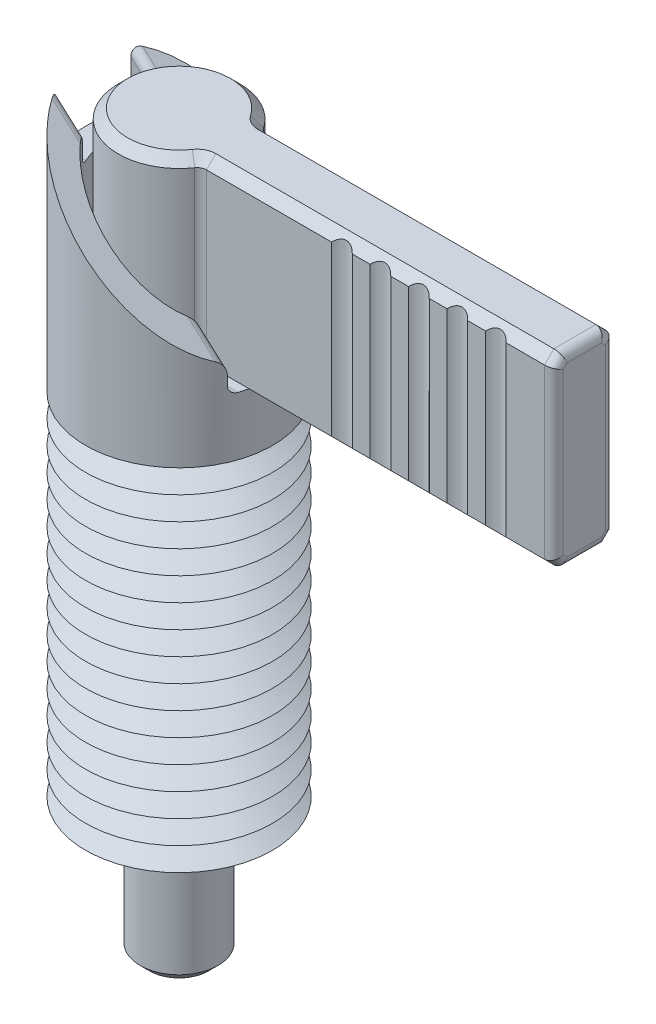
ISO-10303-21;
HEADER;
FILE_DESCRIPTION(('STEP AP214'),'2;1');
FILE_NAME('part.step','',(''),(''),'','','');
FILE_SCHEMA(('AUTOMOTIVE_DESIGN { 1 0 10303 214 1 1 1 1 }'));
ENDSEC;
DATA;
#1=APPLICATION_CONTEXT('core data for automotive mechanical design processes');
#2=APPLICATION_PROTOCOL_DEFINITION('international standard','automotive_design',2000,#1);
#3=PRODUCT_CONTEXT('',#1,'mechanical');
#4=PRODUCT('Part','Part','',(#3));
#5=PRODUCT_RELATED_PRODUCT_CATEGORY('part','',(#4));
#6=PRODUCT_DEFINITION_FORMATION('','',#4);
#7=PRODUCT_DEFINITION_CONTEXT('part definition',#1,'design');
#8=PRODUCT_DEFINITION('design','',#6,#7);
#9=PRODUCT_DEFINITION_SHAPE('','',#8);
#10=(LENGTH_UNIT() NAMED_UNIT(*) SI_UNIT(.MILLI.,.METRE.));
#11=(NAMED_UNIT(*) PLANE_ANGLE_UNIT() SI_UNIT($,.RADIAN.));
#12=(NAMED_UNIT(*) SI_UNIT($,.STERADIAN.) SOLID_ANGLE_UNIT());
#13=UNCERTAINTY_MEASURE_WITH_UNIT(LENGTH_MEASURE(1.E-05),#10,'distance_accuracy_value','');
#14=(GEOMETRIC_REPRESENTATION_CONTEXT(3) GLOBAL_UNCERTAINTY_ASSIGNED_CONTEXT((#13)) GLOBAL_UNIT_ASSIGNED_CONTEXT((#10,
#11,#12)) REPRESENTATION_CONTEXT('',''));
#15=CARTESIAN_POINT('',(0.,0.,0.));
#16=DIRECTION('',(0.,0.,1.));
#17=DIRECTION('',(1.,0.,0.));
#18=AXIS2_PLACEMENT_3D('',#15,#16,#17);
#19=CARTESIAN_POINT('',(3.37749907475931,4.04379064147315,1.95));
#20=DIRECTION('',(0.,0.,1.));
#21=DIRECTION('',(1.,0.,0.));
#22=AXIS2_PLACEMENT_3D('',#19,#20,#21);
#23=PLANE('',#22);
#24=DIRECTION('',(0.,1.,0.));
#25=VECTOR('',#24,1.);
#26=CARTESIAN_POINT('',(13.0643624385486,-8.,1.95));
#27=LINE('',#26,#25);
#28=CARTESIAN_POINT('',(13.0643624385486,27.6006,1.95));
#29=VERTEX_POINT('',#28);
#30=CARTESIAN_POINT('',(13.0643624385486,38.3994,1.95));
#31=VERTEX_POINT('',#30);
#32=EDGE_CURVE('P0_E200',#29,#31,#27,.T.);
#33=ORIENTED_EDGE('',*,*,#32,.F.);
#34=DIRECTION('',(1.,0.,0.));
#35=VECTOR('',#34,1.);
#36=CARTESIAN_POINT('',(26.,27.6006,1.95));
#37=LINE('',#36,#35);
#38=CARTESIAN_POINT('',(14.2096375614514,27.6006,1.95));
#39=VERTEX_POINT('',#38);
#40=EDGE_CURVE('P0_E209',#29,#39,#37,.T.);
#41=ORIENTED_EDGE('',*,*,#40,.T.);
#42=DIRECTION('',(0.,1.,0.));
#43=VECTOR('',#42,1.);
#44=CARTESIAN_POINT('',(14.2096375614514,-8.,1.95));
#45=LINE('',#44,#43);
#46=CARTESIAN_POINT('',(14.2096375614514,38.3994,1.95));
#47=VERTEX_POINT('',#46);
#48=EDGE_CURVE('P0_E210',#39,#47,#45,.T.);
#49=ORIENTED_EDGE('',*,*,#48,.T.);
#50=DIRECTION('',(-1.,0.,0.));
#51=VECTOR('',#50,1.);
#52=CARTESIAN_POINT('',(3.70807766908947,38.3994,1.95));
#53=LINE('',#52,#51);
#54=EDGE_CURVE('P0_E236',#47,#31,#53,.T.);
#55=ORIENTED_EDGE('',*,*,#54,.T.);
#56=EDGE_LOOP('',(#33,#41,#49,#55));
#57=FACE_BOUND('',#56,.T.);
#58=ADVANCED_FACE('P0_F16',(#57),#23,.T.);
#59=DIRECTION('',(0.,1.,0.));
#60=VECTOR('',#59,1.);
#61=CARTESIAN_POINT('',(15.5343624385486,-8.,1.95));
#62=LINE('',#61,#60);
#63=CARTESIAN_POINT('',(15.5343624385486,27.6006,1.95));
#64=VERTEX_POINT('',#63);
#65=CARTESIAN_POINT('',(15.5343624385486,38.3994,1.95));
#66=VERTEX_POINT('',#65);
#67=EDGE_CURVE('P0_E299',#64,#66,#62,.T.);
#68=ORIENTED_EDGE('',*,*,#67,.F.);
#69=CARTESIAN_POINT('',(16.6796375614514,27.6006,1.95));
#70=VERTEX_POINT('',#69);
#71=EDGE_CURVE('P0_E221',#64,#70,#37,.T.);
#72=ORIENTED_EDGE('',*,*,#71,.T.);
#73=DIRECTION('',(0.,1.,0.));
#74=VECTOR('',#73,1.);
#75=CARTESIAN_POINT('',(16.6796375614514,-8.,1.95));
#76=LINE('',#75,#74);
#77=CARTESIAN_POINT('',(16.6796375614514,38.3994,1.95));
#78=VERTEX_POINT('',#77);
#79=EDGE_CURVE('P0_E293',#70,#78,#76,.T.);
#80=ORIENTED_EDGE('',*,*,#79,.T.);
#81=EDGE_CURVE('P0_E239',#78,#66,#53,.T.);
#82=ORIENTED_EDGE('',*,*,#81,.T.);
#83=EDGE_LOOP('',(#68,#72,#80,#82));
#84=FACE_BOUND('',#83,.T.);
#85=ADVANCED_FACE('P0_F496',(#84),#23,.T.);
#86=DIRECTION('',(0.,1.,0.));
#87=VECTOR('',#86,1.);
#88=CARTESIAN_POINT('',(18.0043624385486,-8.,1.95));
#89=LINE('',#88,#87);
#90=CARTESIAN_POINT('',(18.0043624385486,27.6006,1.95));
#91=VERTEX_POINT('',#90);
#92=CARTESIAN_POINT('',(18.0043624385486,38.3994,1.95));
#93=VERTEX_POINT('',#92);
#94=EDGE_CURVE('P0_E292',#91,#93,#89,.T.);
#95=ORIENTED_EDGE('',*,*,#94,.F.);
#96=CARTESIAN_POINT('',(19.1496375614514,27.6006,1.95));
#97=VERTEX_POINT('',#96);
#98=EDGE_CURVE('P0_E228',#91,#97,#37,.T.);
#99=ORIENTED_EDGE('',*,*,#98,.T.);
#100=DIRECTION('',(0.,1.,0.));
#101=VECTOR('',#100,1.);
#102=CARTESIAN_POINT('',(19.1496375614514,-8.,1.95));
#103=LINE('',#102,#101);
#104=CARTESIAN_POINT('',(19.1496375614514,38.3994,1.95));
#105=VERTEX_POINT('',#104);
#106=EDGE_CURVE('P0_E286',#97,#105,#103,.T.);
#107=ORIENTED_EDGE('',*,*,#106,.T.);
#108=EDGE_CURVE('P0_E234',#105,#93,#53,.T.);
#109=ORIENTED_EDGE('',*,*,#108,.T.);
#110=EDGE_LOOP('',(#95,#99,#107,#109));
#111=FACE_BOUND('',#110,.T.);
#112=ADVANCED_FACE('P0_F324',(#111),#23,.T.);
#113=DIRECTION('',(0.,1.,0.));
#114=VECTOR('',#113,1.);
#115=CARTESIAN_POINT('',(20.4743624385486,-8.,1.95));
#116=LINE('',#115,#114);
#117=CARTESIAN_POINT('',(20.4743624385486,27.6006,1.95));
#118=VERTEX_POINT('',#117);
#119=CARTESIAN_POINT('',(20.4743624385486,38.3994,1.95));
#120=VERTEX_POINT('',#119);
#121=EDGE_CURVE('P0_E285',#118,#120,#116,.T.);
#122=ORIENTED_EDGE('',*,*,#121,.F.);
#123=CARTESIAN_POINT('',(21.6196375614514,27.6006,1.95));
#124=VERTEX_POINT('',#123);
#125=EDGE_CURVE('P0_E223',#118,#124,#37,.T.);
#126=ORIENTED_EDGE('',*,*,#125,.T.);
#127=DIRECTION('',(0.,1.,0.));
#128=VECTOR('',#127,1.);
#129=CARTESIAN_POINT('',(21.6196375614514,-8.,1.95));
#130=LINE('',#129,#128);
#131=CARTESIAN_POINT('',(21.6196375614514,38.3994,1.95));
#132=VERTEX_POINT('',#131);
#133=EDGE_CURVE('P0_E279',#124,#132,#130,.T.);
#134=ORIENTED_EDGE('',*,*,#133,.T.);
#135=EDGE_CURVE('P0_E229',#132,#120,#53,.T.);
#136=ORIENTED_EDGE('',*,*,#135,.T.);
#137=EDGE_LOOP('',(#122,#126,#134,#136));
#138=FACE_BOUND('',#137,.T.);
#139=ADVANCED_FACE('P0_F337',(#138),#23,.T.);
#140=CARTESIAN_POINT('',(22.9443624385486,27.6006,1.95));
#141=VERTEX_POINT('',#140);
#142=CARTESIAN_POINT('',(25.3994,27.6006,1.95));
#143=VERTEX_POINT('',#142);
#144=EDGE_CURVE('P0_E218',#141,#143,#37,.T.);
#145=ORIENTED_EDGE('',*,*,#144,.T.);
#146=DIRECTION('',(0.,1.,0.));
#147=VECTOR('',#146,1.);
#148=CARTESIAN_POINT('',(25.3994,4.04379064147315,1.95));
#149=LINE('',#148,#147);
#150=CARTESIAN_POINT('',(25.3994,38.3994,1.95));
#151=VERTEX_POINT('',#150);
#152=EDGE_CURVE('P0_E11',#143,#151,#149,.T.);
#153=ORIENTED_EDGE('',*,*,#152,.T.);
#154=CARTESIAN_POINT('',(22.9443624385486,38.3994,1.95));
#155=VERTEX_POINT('',#154);
#156=EDGE_CURVE('P0_E224',#151,#155,#53,.T.);
#157=ORIENTED_EDGE('',*,*,#156,.T.);
#158=DIRECTION('',(0.,1.,0.));
#159=VECTOR('',#158,1.);
#160=CARTESIAN_POINT('',(22.9443624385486,-8.,1.95));
#161=LINE('',#160,#159);
#162=EDGE_CURVE('P0_E278',#141,#155,#161,.T.);
#163=ORIENTED_EDGE('',*,*,#162,.F.);
#164=EDGE_LOOP('',(#145,#153,#157,#163));
#165=FACE_BOUND('',#164,.T.);
#166=ADVANCED_FACE('P0_F506',(#165),#23,.T.);
#167=CARTESIAN_POINT('',(0.,-8.,0.));
#168=DIRECTION('',(0.,1.,0.));
#169=DIRECTION('',(0.,0.,1.));
#170=AXIS2_PLACEMENT_3D('',#167,#168,#169);
#171=PLANE('',#170);
#172=CARTESIAN_POINT('',(0.,-8.,0.));
#173=DIRECTION('',(0.,-1.,0.));
#174=DIRECTION('',(0.,0.,-1.));
#175=AXIS2_PLACEMENT_3D('',#172,#173,#174);
#176=CIRCLE('',#175,1.9);
#177=CARTESIAN_POINT('',(0.,-8.,-1.9));
#178=VERTEX_POINT('',#177);
#179=EDGE_CURVE('P0_E259',#178,#178,#176,.T.);
#180=ORIENTED_EDGE('',*,*,#179,.T.);
#181=EDGE_LOOP('',(#180));
#182=FACE_BOUND('',#181,.T.);
#183=ADVANCED_FACE('P0_F516',(#182),#171,.F.);
#184=CARTESIAN_POINT('',(0.,-7.4,0.));
#185=DIRECTION('',(0.,1.,0.));
#186=DIRECTION('',(0.,0.,1.));
#187=AXIS2_PLACEMENT_3D('',#184,#185,#186);
#188=CONICAL_SURFACE('',#187,2.5,0.785398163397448);
#189=ORIENTED_EDGE('',*,*,#179,.F.);
#190=EDGE_LOOP('',(#189));
#191=FACE_BOUND('',#190,.T.);
#192=CARTESIAN_POINT('',(0.,-7.4,0.));
#193=DIRECTION('',(0.,-1.,0.));
#194=DIRECTION('',(0.,0.,-1.));
#195=AXIS2_PLACEMENT_3D('',#192,#193,#194);
#196=CIRCLE('',#195,2.5);
#197=CARTESIAN_POINT('',(0.,-7.4,-2.5));
#198=VERTEX_POINT('',#197);
#199=EDGE_CURVE('P0_E262',#198,#198,#196,.T.);
#200=ORIENTED_EDGE('',*,*,#199,.T.);
#201=EDGE_LOOP('',(#200));
#202=FACE_BOUND('',#201,.T.);
#203=ADVANCED_FACE('P0_F521',(#191,#202),#188,.T.);
#204=CARTESIAN_POINT('',(0.,-8.,0.));
#205=DIRECTION('',(0.,-1.,0.));
#206=DIRECTION('',(0.,0.,-1.));
#207=AXIS2_PLACEMENT_3D('',#204,#205,#206);
#208=CYLINDRICAL_SURFACE('',#207,2.5);
#209=ORIENTED_EDGE('',*,*,#199,.F.);
#210=EDGE_LOOP('',(#209));
#211=FACE_BOUND('',#210,.T.);
#212=CARTESIAN_POINT('',(0.,6.5,0.));
#213=DIRECTION('',(0.,-1.,0.));
#214=DIRECTION('',(0.,0.,-1.));
#215=AXIS2_PLACEMENT_3D('',#212,#213,#214);
#216=CIRCLE('',#215,2.5);
#217=CARTESIAN_POINT('',(0.,6.5,-2.5));
#218=VERTEX_POINT('',#217);
#219=EDGE_CURVE('P0_E265',#218,#218,#216,.T.);
#220=ORIENTED_EDGE('',*,*,#219,.T.);
#221=EDGE_LOOP('',(#220));
#222=FACE_BOUND('',#221,.T.);
#223=ADVANCED_FACE('P0_F555',(#211,#222),#208,.T.);
#224=CARTESIAN_POINT('',(-2.5,6.5,0.));
#225=DIRECTION('',(0.,-1.,0.));
#226=DIRECTION('',(0.,0.,-1.));
#227=AXIS2_PLACEMENT_3D('',#224,#225,#226);
#228=PLANE('',#227);
#229=ORIENTED_EDGE('',*,*,#219,.F.);
#230=EDGE_LOOP('',(#229));
#231=FACE_BOUND('',#230,.T.);
#232=CARTESIAN_POINT('',(0.,6.5,0.));
#233=DIRECTION('',(0.,-1.,0.));
#234=DIRECTION('',(0.,0.,-1.));
#235=AXIS2_PLACEMENT_3D('',#232,#233,#234);
#236=CIRCLE('',#235,1.875);
#237=CARTESIAN_POINT('',(0.,6.5,-1.875));
#238=VERTEX_POINT('',#237);
#239=EDGE_CURVE('P0_E268',#238,#238,#236,.T.);
#240=ORIENTED_EDGE('',*,*,#239,.T.);
#241=EDGE_LOOP('',(#240));
#242=FACE_BOUND('',#241,.T.);
#243=ADVANCED_FACE('P0_F563',(#231,#242),#228,.F.);
#244=CARTESIAN_POINT('',(0.,-8.,0.));
#245=DIRECTION('',(0.,-1.,0.));
#246=DIRECTION('',(0.,0.,-1.));
#247=AXIS2_PLACEMENT_3D('',#244,#245,#246);
#248=CYLINDRICAL_SURFACE('',#247,1.875);
#249=ORIENTED_EDGE('',*,*,#239,.F.);
#250=EDGE_LOOP('',(#249));
#251=FACE_BOUND('',#250,.T.);
#252=CARTESIAN_POINT('',(0.,27.,0.));
#253=DIRECTION('',(0.,-1.,0.));
#254=DIRECTION('',(0.,0.,-1.));
#255=AXIS2_PLACEMENT_3D('',#252,#253,#254);
#256=CIRCLE('',#255,1.875);
#257=CARTESIAN_POINT('',(0.,27.,-1.875));
#258=VERTEX_POINT('',#257);
#259=EDGE_CURVE('P0_E271',#258,#258,#256,.T.);
#260=ORIENTED_EDGE('',*,*,#259,.T.);
#261=EDGE_LOOP('',(#260));
#262=FACE_BOUND('',#261,.T.);
#263=ADVANCED_FACE('P0_F571',(#251,#262),#248,.T.);
#264=CARTESIAN_POINT('',(-1.875,27.,0.));
#265=DIRECTION('',(0.,1.,0.));
#266=DIRECTION('',(0.,0.,1.));
#267=AXIS2_PLACEMENT_3D('',#264,#265,#266);
#268=PLANE('',#267);
#269=ORIENTED_EDGE('',*,*,#259,.F.);
#270=EDGE_LOOP('',(#269));
#271=FACE_BOUND('',#270,.T.);
#272=DIRECTION('',(1.,0.,0.));
#273=VECTOR('',#272,1.);
#274=CARTESIAN_POINT('',(26.,27.,-1.34940000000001));
#275=LINE('',#274,#273);
#276=CARTESIAN_POINT('',(3.70807766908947,27.,-1.34940000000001));
#277=VERTEX_POINT('',#276);
#278=CARTESIAN_POINT('',(25.3994,27.,-1.34940000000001));
#279=VERTEX_POINT('',#278);
#280=EDGE_CURVE('P0_E247',#277,#279,#275,.T.);
#281=ORIENTED_EDGE('',*,*,#280,.T.);
#282=DIRECTION('',(0.,0.,1.));
#283=VECTOR('',#282,1.);
#284=CARTESIAN_POINT('',(25.3994,27.,1.34940000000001));
#285=LINE('',#284,#283);
#286=CARTESIAN_POINT('',(25.3994,27.,1.34940000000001));
#287=VERTEX_POINT('',#286);
#288=EDGE_CURVE('P0_E40',#279,#287,#285,.T.);
#289=ORIENTED_EDGE('',*,*,#288,.T.);
#290=DIRECTION('',(-1.,0.,0.));
#291=VECTOR('',#290,1.);
#292=CARTESIAN_POINT('',(3.70807766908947,27.,1.34940000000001));
#293=LINE('',#292,#291);
#294=CARTESIAN_POINT('',(3.70807766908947,27.,1.34940000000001));
#295=VERTEX_POINT('',#294);
#296=EDGE_CURVE('P0_E237',#287,#295,#293,.T.);
#297=ORIENTED_EDGE('',*,*,#296,.T.);
#298=CARTESIAN_POINT('',(3.70807766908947,27.,2.5506));
#299=DIRECTION('',(0.,1.,0.));
#300=DIRECTION('',(0.,0.,1.));
#301=AXIS2_PLACEMENT_3D('',#298,#299,#300);
#302=CIRCLE('',#301,1.20119999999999);
#303=CARTESIAN_POINT('',(2.71840009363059,27.,1.8698506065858));
#304=VERTEX_POINT('',#303);
#305=EDGE_CURVE('P0_E240',#295,#304,#302,.T.);
#306=ORIENTED_EDGE('',*,*,#305,.T.);
#307=CARTESIAN_POINT('',(0.,27.,0.));
#308=DIRECTION('',(0.,1.,0.));
#309=DIRECTION('',(0.,0.,1.));
#310=AXIS2_PLACEMENT_3D('',#307,#308,#309);
#311=CIRCLE('',#310,3.29940000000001);
#312=CARTESIAN_POINT('',(2.71840009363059,27.,-1.8698506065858));
#313=VERTEX_POINT('',#312);
#314=EDGE_CURVE('P0_E241',#304,#313,#311,.F.);
#315=ORIENTED_EDGE('',*,*,#314,.T.);
#316=CARTESIAN_POINT('',(3.70807766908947,27.,-2.5506));
#317=DIRECTION('',(0.,1.,0.));
#318=DIRECTION('',(0.,0.,1.));
#319=AXIS2_PLACEMENT_3D('',#316,#317,#318);
#320=CIRCLE('',#319,1.20119999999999);
#321=EDGE_CURVE('P0_E245',#313,#277,#320,.T.);
#322=ORIENTED_EDGE('',*,*,#321,.T.);
#323=EDGE_LOOP('',(#281,#289,#297,#306,#315,#322));
#324=FACE_BOUND('',#323,.T.);
#325=ADVANCED_FACE('P0_F422',(#271,#324),#268,.F.);
#326=CARTESIAN_POINT('',(0.,-8.,0.));
#327=DIRECTION('',(0.,-1.,0.));
#328=DIRECTION('',(0.,0.,-1.));
#329=AXIS2_PLACEMENT_3D('',#326,#327,#328);
#330=CYLINDRICAL_SURFACE('',#329,3.9);
#331=DIRECTION('',(0.,-1.,0.));
#332=VECTOR('',#331,1.);
#333=CARTESIAN_POINT('',(3.21323888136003,-8.,-2.21022530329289));
#334=LINE('',#333,#332);
#335=CARTESIAN_POINT('',(3.21323888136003,38.3994,-2.21022530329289));
#336=VERTEX_POINT('',#335);
#337=CARTESIAN_POINT('',(3.21323888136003,27.6006,-2.21022530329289));
#338=VERTEX_POINT('',#337);
#339=EDGE_CURVE('P0_E250',#336,#338,#334,.T.);
#340=ORIENTED_EDGE('',*,*,#339,.T.);
#341=CARTESIAN_POINT('',(0.,27.6006,0.));
#342=DIRECTION('',(0.,1.,0.));
#343=DIRECTION('',(0.,0.,1.));
#344=AXIS2_PLACEMENT_3D('',#341,#342,#343);
#345=CIRCLE('',#344,3.9);
#346=CARTESIAN_POINT('',(3.21323888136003,27.6006,2.21022530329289));
#347=VERTEX_POINT('',#346);
#348=EDGE_CURVE('P0_E436',#338,#347,#345,.T.);
#349=ORIENTED_EDGE('',*,*,#348,.T.);
#350=DIRECTION('',(0.,-1.,0.));
#351=VECTOR('',#350,1.);
#352=CARTESIAN_POINT('',(3.21323888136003,-8.,2.21022530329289));
#353=LINE('',#352,#351);
#354=CARTESIAN_POINT('',(3.21323888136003,38.3994,2.21022530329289));
#355=VERTEX_POINT('',#354);
#356=EDGE_CURVE('P0_E253',#347,#355,#353,.F.);
#357=ORIENTED_EDGE('',*,*,#356,.T.);
#358=CARTESIAN_POINT('',(0.,38.3994,0.));
#359=DIRECTION('',(0.,-1.,0.));
#360=DIRECTION('',(0.,0.,-1.));
#361=AXIS2_PLACEMENT_3D('',#358,#359,#360);
#362=CIRCLE('',#361,3.9);
#363=EDGE_CURVE('P0_E476',#355,#336,#362,.T.);
#364=ORIENTED_EDGE('',*,*,#363,.T.);
#365=EDGE_LOOP('',(#340,#349,#357,#364));
#366=FACE_BOUND('',#365,.T.);
#367=ADVANCED_FACE('P0_F586',(#366),#330,.T.);
#368=CARTESIAN_POINT('',(-3.9,39.,0.));
#369=DIRECTION('',(0.,-1.,0.));
#370=DIRECTION('',(0.,0.,-1.));
#371=AXIS2_PLACEMENT_3D('',#368,#369,#370);
#372=PLANE('',#371);
#373=DIRECTION('',(1.,0.,0.));
#374=VECTOR('',#373,1.);
#375=CARTESIAN_POINT('',(26.,39.,1.34940000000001));
#376=LINE('',#375,#374);
#377=CARTESIAN_POINT('',(3.70807766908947,39.,1.34940000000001));
#378=VERTEX_POINT('',#377);
#379=CARTESIAN_POINT('',(25.3994,39.,1.34940000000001));
#380=VERTEX_POINT('',#379);
#381=EDGE_CURVE('P0_E343',#378,#380,#376,.T.);
#382=ORIENTED_EDGE('',*,*,#381,.T.);
#383=DIRECTION('',(0.,0.,-1.));
#384=VECTOR('',#383,1.);
#385=CARTESIAN_POINT('',(25.3994,39.,-1.3494));
#386=LINE('',#385,#384);
#387=CARTESIAN_POINT('',(25.3994,39.,-1.34940000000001));
#388=VERTEX_POINT('',#387);
#389=EDGE_CURVE('P0_E375',#380,#388,#386,.T.);
#390=ORIENTED_EDGE('',*,*,#389,.T.);
#391=DIRECTION('',(-1.,0.,0.));
#392=VECTOR('',#391,1.);
#393=CARTESIAN_POINT('',(3.70807766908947,39.,-1.34940000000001));
#394=LINE('',#393,#392);
#395=CARTESIAN_POINT('',(3.70807766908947,39.,-1.34940000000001));
#396=VERTEX_POINT('',#395);
#397=EDGE_CURVE('P0_E465',#388,#396,#394,.T.);
#398=ORIENTED_EDGE('',*,*,#397,.T.);
#399=CARTESIAN_POINT('',(3.70807766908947,39.,-2.5506));
#400=DIRECTION('',(0.,-1.,0.));
#401=DIRECTION('',(0.,0.,-1.));
#402=AXIS2_PLACEMENT_3D('',#399,#400,#401);
#403=CIRCLE('',#402,1.20119999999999);
#404=CARTESIAN_POINT('',(2.71840009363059,39.,-1.86985060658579));
#405=VERTEX_POINT('',#404);
#406=EDGE_CURVE('P0_E463',#396,#405,#403,.T.);
#407=ORIENTED_EDGE('',*,*,#406,.T.);
#408=CARTESIAN_POINT('',(0.,39.,0.));
#409=DIRECTION('',(0.,-1.,0.));
#410=DIRECTION('',(0.,0.,-1.));
#411=AXIS2_PLACEMENT_3D('',#408,#409,#410);
#412=CIRCLE('',#411,3.29940000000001);
#413=CARTESIAN_POINT('',(2.71840009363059,39.,1.86985060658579));
#414=VERTEX_POINT('',#413);
#415=EDGE_CURVE('P0_E461',#405,#414,#412,.F.);
#416=ORIENTED_EDGE('',*,*,#415,.T.);
#417=CARTESIAN_POINT('',(3.70807766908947,39.,2.5506));
#418=DIRECTION('',(0.,-1.,0.));
#419=DIRECTION('',(0.,0.,-1.));
#420=AXIS2_PLACEMENT_3D('',#417,#418,#419);
#421=CIRCLE('',#420,1.20119999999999);
#422=EDGE_CURVE('P0_E348',#414,#378,#421,.T.);
#423=ORIENTED_EDGE('',*,*,#422,.T.);
#424=EDGE_LOOP('',(#382,#390,#398,#407,#416,#423));
#425=FACE_BOUND('',#424,.T.);
#426=ADVANCED_FACE('P0_F594',(#425),#372,.F.);
#427=CARTESIAN_POINT('',(3.37749907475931,4.04379064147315,-1.95));
#428=DIRECTION('',(0.,0.,-1.));
#429=DIRECTION('',(-1.,0.,0.));
#430=AXIS2_PLACEMENT_3D('',#427,#428,#429);
#431=PLANE('',#430);
#432=DIRECTION('',(1.,0.,0.));
#433=VECTOR('',#432,1.);
#434=CARTESIAN_POINT('',(26.,38.3994,-1.95));
#435=LINE('',#434,#433);
#436=CARTESIAN_POINT('',(3.70807766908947,38.3994,-1.95));
#437=VERTEX_POINT('',#436);
#438=CARTESIAN_POINT('',(25.3994,38.3994,-1.95));
#439=VERTEX_POINT('',#438);
#440=EDGE_CURVE('P0_E468',#437,#439,#435,.T.);
#441=ORIENTED_EDGE('',*,*,#440,.T.);
#442=DIRECTION('',(0.,1.,0.));
#443=VECTOR('',#442,1.);
#444=CARTESIAN_POINT('',(25.3994,4.04379064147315,-1.95));
#445=LINE('',#444,#443);
#446=CARTESIAN_POINT('',(25.3994,27.6006,-1.95));
#447=VERTEX_POINT('',#446);
#448=EDGE_CURVE('P0_E379',#439,#447,#445,.F.);
#449=ORIENTED_EDGE('',*,*,#448,.T.);
#450=DIRECTION('',(-1.,0.,0.));
#451=VECTOR('',#450,1.);
#452=CARTESIAN_POINT('',(3.70807766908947,27.6006,-1.95));
#453=LINE('',#452,#451);
#454=CARTESIAN_POINT('',(3.70807766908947,27.6006,-1.95));
#455=VERTEX_POINT('',#454);
#456=EDGE_CURVE('P0_E421',#447,#455,#453,.T.);
#457=ORIENTED_EDGE('',*,*,#456,.T.);
#458=DIRECTION('',(0.,-1.,0.));
#459=VECTOR('',#458,1.);
#460=CARTESIAN_POINT('',(3.70807766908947,4.04379064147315,-1.95));
#461=LINE('',#460,#459);
#462=EDGE_CURVE('P0_E256',#455,#437,#461,.F.);
#463=ORIENTED_EDGE('',*,*,#462,.T.);
#464=EDGE_LOOP('',(#441,#449,#457,#463));
#465=FACE_BOUND('',#464,.T.);
#466=ADVANCED_FACE('P0_F513',(#465),#431,.T.);
#467=CARTESIAN_POINT('',(26.,4.04379064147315,1.95));
#468=DIRECTION('',(1.,0.,0.));
#469=DIRECTION('',(0.,0.,-1.));
#470=AXIS2_PLACEMENT_3D('',#467,#468,#469);
#471=PLANE('',#470);
#472=DIRECTION('',(0.,0.,-1.));
#473=VECTOR('',#472,1.);
#474=CARTESIAN_POINT('',(26.,38.3994,1.3494));
#475=LINE('',#474,#473);
#476=CARTESIAN_POINT('',(26.,38.3994,-1.10062333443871));
#477=VERTEX_POINT('',#476);
#478=CARTESIAN_POINT('',(26.,38.3994,1.10062333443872));
#479=VERTEX_POINT('',#478);
#480=EDGE_CURVE('P0_E367',#477,#479,#475,.F.);
#481=ORIENTED_EDGE('',*,*,#480,.T.);
#482=DIRECTION('',(0.,-0.707106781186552,0.707106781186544));
#483=VECTOR('',#482,1.);
#484=CARTESIAN_POINT('',(26.,20.7969069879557,18.7031163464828));
#485=LINE('',#484,#483);
#486=CARTESIAN_POINT('',(26.,38.1506233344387,1.3494));
#487=VERTEX_POINT('',#486);
#488=EDGE_CURVE('P0_E369',#479,#487,#485,.T.);
#489=ORIENTED_EDGE('',*,*,#488,.T.);
#490=DIRECTION('',(0.,1.,0.));
#491=VECTOR('',#490,1.);
#492=CARTESIAN_POINT('',(26.,4.04379064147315,1.3494));
#493=LINE('',#492,#491);
#494=CARTESIAN_POINT('',(26.,27.8493766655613,1.3494));
#495=VERTEX_POINT('',#494);
#496=EDGE_CURVE('P0_E309',#487,#495,#493,.F.);
#497=ORIENTED_EDGE('',*,*,#496,.T.);
#498=DIRECTION('',(0.,-0.707106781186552,-0.707106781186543));
#499=VECTOR('',#498,1.);
#500=CARTESIAN_POINT('',(26.,16.2468836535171,-10.2530930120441));
#501=LINE('',#500,#499);
#502=CARTESIAN_POINT('',(26.,27.6006,1.10062333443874));
#503=VERTEX_POINT('',#502);
#504=EDGE_CURVE('P0_E357',#495,#503,#501,.T.);
#505=ORIENTED_EDGE('',*,*,#504,.T.);
#506=DIRECTION('',(0.,0.,1.));
#507=VECTOR('',#506,1.);
#508=CARTESIAN_POINT('',(26.,27.6006,-1.34940000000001));
#509=LINE('',#508,#507);
#510=CARTESIAN_POINT('',(26.,27.6006,-1.10062333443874));
#511=VERTEX_POINT('',#510);
#512=EDGE_CURVE('P0_E359',#503,#511,#509,.F.);
#513=ORIENTED_EDGE('',*,*,#512,.T.);
#514=DIRECTION('',(0.,0.707106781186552,-0.707106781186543));
#515=VECTOR('',#514,1.);
#516=CARTESIAN_POINT('',(26.,14.2968836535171,12.203093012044));
#517=LINE('',#516,#515);
#518=CARTESIAN_POINT('',(26.,27.8493766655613,-1.3494));
#519=VERTEX_POINT('',#518);
#520=EDGE_CURVE('P0_E361',#511,#519,#517,.T.);
#521=ORIENTED_EDGE('',*,*,#520,.T.);
#522=DIRECTION('',(0.,1.,0.));
#523=VECTOR('',#522,1.);
#524=CARTESIAN_POINT('',(26.,4.04379064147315,-1.3494));
#525=LINE('',#524,#523);
#526=CARTESIAN_POINT('',(26.,38.1506233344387,-1.3494));
#527=VERTEX_POINT('',#526);
#528=EDGE_CURVE('P0_E363',#519,#527,#525,.T.);
#529=ORIENTED_EDGE('',*,*,#528,.T.);
#530=DIRECTION('',(0.,0.707106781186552,0.707106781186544));
#531=VECTOR('',#530,1.);
#532=CARTESIAN_POINT('',(26.,22.7469069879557,-16.7531163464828));
#533=LINE('',#532,#531);
#534=EDGE_CURVE('P0_E365',#527,#477,#533,.T.);
#535=ORIENTED_EDGE('',*,*,#534,.T.);
#536=EDGE_LOOP('',(#481,#489,#497,#505,#513,#521,#529,#535));
#537=FACE_BOUND('',#536,.T.);
#538=ADVANCED_FACE('P0_F505',(#537),#471,.T.);
#539=DIRECTION('',(0.,1.,0.));
#540=VECTOR('',#539,1.);
#541=CARTESIAN_POINT('',(11.7396375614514,-8.,1.95));
#542=LINE('',#541,#540);
#543=CARTESIAN_POINT('',(11.7396375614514,27.6006,1.95));
#544=VERTEX_POINT('',#543);
#545=CARTESIAN_POINT('',(11.7396375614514,38.3994,1.95));
#546=VERTEX_POINT('',#545);
#547=EDGE_CURVE('P0_E190',#544,#546,#542,.T.);
#548=ORIENTED_EDGE('',*,*,#547,.T.);
#549=CARTESIAN_POINT('',(3.70807766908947,38.3994,1.95));
#550=VERTEX_POINT('',#549);
#551=EDGE_CURVE('P0_E230',#546,#550,#53,.T.);
#552=ORIENTED_EDGE('',*,*,#551,.T.);
#553=DIRECTION('',(0.,-1.,0.));
#554=VECTOR('',#553,1.);
#555=CARTESIAN_POINT('',(3.70807766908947,4.04379064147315,1.95));
#556=LINE('',#555,#554);
#557=CARTESIAN_POINT('',(3.70807766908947,27.6006,1.95));
#558=VERTEX_POINT('',#557);
#559=EDGE_CURVE('P0_E215',#550,#558,#556,.T.);
#560=ORIENTED_EDGE('',*,*,#559,.T.);
#561=EDGE_CURVE('P0_E206',#558,#544,#37,.T.);
#562=ORIENTED_EDGE('',*,*,#561,.T.);
#563=EDGE_LOOP('',(#548,#552,#560,#562));
#564=FACE_BOUND('',#563,.T.);
#565=ADVANCED_FACE('P0_F213',(#564),#23,.T.);
#566=CARTESIAN_POINT('',(3.70807766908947,-8.,-2.5506));
#567=DIRECTION('',(0.,-1.,0.));
#568=DIRECTION('',(0.,0.,-1.));
#569=AXIS2_PLACEMENT_3D('',#566,#567,#568);
#570=CYLINDRICAL_SURFACE('',#569,0.6006);
#571=ORIENTED_EDGE('',*,*,#462,.F.);
#572=CARTESIAN_POINT('',(3.70807766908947,27.6006,-2.5506));
#573=DIRECTION('',(0.,1.,0.));
#574=DIRECTION('',(0.,0.,1.));
#575=AXIS2_PLACEMENT_3D('',#572,#573,#574);
#576=CIRCLE('',#575,0.6006);
#577=EDGE_CURVE('P0_E471',#455,#338,#576,.F.);
#578=ORIENTED_EDGE('',*,*,#577,.T.);
#579=ORIENTED_EDGE('',*,*,#339,.F.);
#580=CARTESIAN_POINT('',(3.70807766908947,38.3994,-2.5506));
#581=DIRECTION('',(0.,-1.,0.));
#582=DIRECTION('',(0.,0.,-1.));
#583=AXIS2_PLACEMENT_3D('',#580,#581,#582);
#584=CIRCLE('',#583,0.6006);
#585=EDGE_CURVE('P0_E473',#336,#437,#584,.F.);
#586=ORIENTED_EDGE('',*,*,#585,.T.);
#587=EDGE_LOOP('',(#571,#578,#579,#586));
#588=FACE_BOUND('',#587,.T.);
#589=ADVANCED_FACE('P0_F504',(#588),#570,.F.);
#590=CARTESIAN_POINT('',(3.70807766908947,-8.,2.5506));
#591=DIRECTION('',(0.,-1.,0.));
#592=DIRECTION('',(0.,0.,-1.));
#593=AXIS2_PLACEMENT_3D('',#590,#591,#592);
#594=CYLINDRICAL_SURFACE('',#593,0.6006);
#595=ORIENTED_EDGE('',*,*,#356,.F.);
#596=CARTESIAN_POINT('',(3.70807766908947,27.6006,2.5506));
#597=DIRECTION('',(0.,1.,0.));
#598=DIRECTION('',(0.,0.,1.));
#599=AXIS2_PLACEMENT_3D('',#596,#597,#598);
#600=CIRCLE('',#599,0.6006);
#601=EDGE_CURVE('P0_E219',#347,#558,#600,.F.);
#602=ORIENTED_EDGE('',*,*,#601,.T.);
#603=ORIENTED_EDGE('',*,*,#559,.F.);
#604=CARTESIAN_POINT('',(3.70807766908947,38.3994,2.5506));
#605=DIRECTION('',(0.,-1.,0.));
#606=DIRECTION('',(0.,0.,-1.));
#607=AXIS2_PLACEMENT_3D('',#604,#605,#606);
#608=CIRCLE('',#607,0.6006);
#609=EDGE_CURVE('P0_E216',#550,#355,#608,.F.);
#610=ORIENTED_EDGE('',*,*,#609,.T.);
#611=EDGE_LOOP('',(#595,#602,#603,#610));
#612=FACE_BOUND('',#611,.T.);
#613=ADVANCED_FACE('P0_F481',(#612),#594,.F.);
#614=CARTESIAN_POINT('',(-1.875,27.,-1.34940000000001));
#615=DIRECTION('',(0.,-0.707106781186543,-0.707106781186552));
#616=DIRECTION('',(0.,0.707106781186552,-0.707106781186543));
#617=AXIS2_PLACEMENT_3D('',#614,#615,#616);
#618=PLANE('',#617);
#619=ORIENTED_EDGE('',*,*,#456,.F.);
#620=DIRECTION('',(0.,0.707106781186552,-0.707106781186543));
#621=VECTOR('',#620,1.);
#622=CARTESIAN_POINT('',(25.3994,27.,-1.34940000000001));
#623=LINE('',#622,#621);
#624=EDGE_CURVE('P0_E381',#447,#279,#623,.F.);
#625=ORIENTED_EDGE('',*,*,#624,.T.);
#626=ORIENTED_EDGE('',*,*,#280,.F.);
#627=DIRECTION('',(0.,-0.707106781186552,0.707106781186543));
#628=VECTOR('',#627,1.);
#629=CARTESIAN_POINT('',(3.70807766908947,27.6006,-1.95));
#630=LINE('',#629,#628);
#631=EDGE_CURVE('P0_E274',#455,#277,#630,.T.);
#632=ORIENTED_EDGE('',*,*,#631,.F.);
#633=EDGE_LOOP('',(#619,#625,#626,#632));
#634=FACE_BOUND('',#633,.T.);
#635=ADVANCED_FACE('P0_F418',(#634),#618,.T.);
#636=CARTESIAN_POINT('',(3.70807766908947,27.,-2.5506));
#637=DIRECTION('',(0.,-1.,0.));
#638=DIRECTION('',(0.,0.,-1.));
#639=AXIS2_PLACEMENT_3D('',#636,#637,#638);
#640=CONICAL_SURFACE('',#639,1.20119999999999,0.785398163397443);
#641=ORIENTED_EDGE('',*,*,#631,.T.);
#642=ORIENTED_EDGE('',*,*,#321,.F.);
#643=DIRECTION('',(-0.582590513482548,-0.707106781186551,0.400734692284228));
#644=VECTOR('',#643,1.);
#645=CARTESIAN_POINT('',(3.21323888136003,27.6006,-2.21022530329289));
#646=LINE('',#645,#644);
#647=EDGE_CURVE('P0_E430',#338,#313,#646,.T.);
#648=ORIENTED_EDGE('',*,*,#647,.F.);
#649=ORIENTED_EDGE('',*,*,#577,.F.);
#650=EDGE_LOOP('',(#641,#642,#648,#649));
#651=FACE_BOUND('',#650,.T.);
#652=ADVANCED_FACE('P0_F428',(#651),#640,.F.);
#653=CARTESIAN_POINT('',(0.,27.,0.));
#654=DIRECTION('',(0.,1.,0.));
#655=DIRECTION('',(0.,0.,1.));
#656=AXIS2_PLACEMENT_3D('',#653,#654,#655);
#657=CONICAL_SURFACE('',#656,3.29940000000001,0.785398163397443);
#658=ORIENTED_EDGE('',*,*,#647,.T.);
#659=ORIENTED_EDGE('',*,*,#314,.F.);
#660=DIRECTION('',(-0.582590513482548,-0.707106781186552,-0.400734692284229));
#661=VECTOR('',#660,1.);
#662=CARTESIAN_POINT('',(3.21323888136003,27.6006,2.21022530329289));
#663=LINE('',#662,#661);
#664=EDGE_CURVE('P0_E437',#347,#304,#663,.T.);
#665=ORIENTED_EDGE('',*,*,#664,.F.);
#666=ORIENTED_EDGE('',*,*,#348,.F.);
#667=EDGE_LOOP('',(#658,#659,#665,#666));
#668=FACE_BOUND('',#667,.T.);
#669=ADVANCED_FACE('P0_F433',(#668),#657,.T.);
#670=CARTESIAN_POINT('',(3.70807766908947,27.,2.5506));
#671=DIRECTION('',(0.,-1.,0.));
#672=DIRECTION('',(0.,0.,-1.));
#673=AXIS2_PLACEMENT_3D('',#670,#671,#672);
#674=CONICAL_SURFACE('',#673,1.20119999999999,0.785398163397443);
#675=ORIENTED_EDGE('',*,*,#664,.T.);
#676=ORIENTED_EDGE('',*,*,#305,.F.);
#677=DIRECTION('',(0.,-0.707106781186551,-0.707106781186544));
#678=VECTOR('',#677,1.);
#679=CARTESIAN_POINT('',(3.70807766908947,27.6006,1.95));
#680=LINE('',#679,#678);
#681=EDGE_CURVE('P0_E440',#558,#295,#680,.T.);
#682=ORIENTED_EDGE('',*,*,#681,.F.);
#683=ORIENTED_EDGE('',*,*,#601,.F.);
#684=EDGE_LOOP('',(#675,#676,#682,#683));
#685=FACE_BOUND('',#684,.T.);
#686=ADVANCED_FACE('P0_F484',(#685),#674,.F.);
#687=CARTESIAN_POINT('',(-1.875,27.,1.34940000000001));
#688=DIRECTION('',(0.,-0.707106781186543,0.707106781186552));
#689=DIRECTION('',(0.,-0.707106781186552,-0.707106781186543));
#690=AXIS2_PLACEMENT_3D('',#687,#688,#689);
#691=PLANE('',#690);
#692=ORIENTED_EDGE('',*,*,#296,.F.);
#693=DIRECTION('',(0.,-0.707106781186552,-0.707106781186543));
#694=VECTOR('',#693,1.);
#695=CARTESIAN_POINT('',(25.3994,27.,1.34940000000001));
#696=LINE('',#695,#694);
#697=EDGE_CURVE('P0_E25',#287,#143,#696,.F.);
#698=ORIENTED_EDGE('',*,*,#697,.T.);
#699=ORIENTED_EDGE('',*,*,#144,.F.);
#700=CARTESIAN_POINT('',(22.282,28.2246,2.574));
#701=DIRECTION('',(0.,-0.707106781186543,0.707106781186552));
#702=DIRECTION('',(0.,0.707106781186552,0.707106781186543));
#703=AXIS2_PLACEMENT_3D('',#700,#701,#702);
#704=ELLIPSE('',#703,1.28693434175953,0.910000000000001);
#705=EDGE_CURVE('P0_E275',#124,#141,#704,.T.);
#706=ORIENTED_EDGE('',*,*,#705,.F.);
#707=ORIENTED_EDGE('',*,*,#125,.F.);
#708=CARTESIAN_POINT('',(19.812,28.2246,2.574));
#709=DIRECTION('',(0.,-0.707106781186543,0.707106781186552));
#710=DIRECTION('',(0.,0.707106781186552,0.707106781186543));
#711=AXIS2_PLACEMENT_3D('',#708,#709,#710);
#712=ELLIPSE('',#711,1.28693434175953,0.910000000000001);
#713=EDGE_CURVE('P0_E282',#97,#118,#712,.T.);
#714=ORIENTED_EDGE('',*,*,#713,.F.);
#715=ORIENTED_EDGE('',*,*,#98,.F.);
#716=CARTESIAN_POINT('',(17.342,28.2246,2.574));
#717=DIRECTION('',(0.,-0.707106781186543,0.707106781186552));
#718=DIRECTION('',(0.,0.707106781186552,0.707106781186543));
#719=AXIS2_PLACEMENT_3D('',#716,#717,#718);
#720=ELLIPSE('',#719,1.28693434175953,0.910000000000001);
#721=EDGE_CURVE('P0_E289',#70,#91,#720,.T.);
#722=ORIENTED_EDGE('',*,*,#721,.F.);
#723=ORIENTED_EDGE('',*,*,#71,.F.);
#724=CARTESIAN_POINT('',(14.872,28.2246,2.574));
#725=DIRECTION('',(0.,-0.707106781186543,0.707106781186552));
#726=DIRECTION('',(0.,0.707106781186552,0.707106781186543));
#727=AXIS2_PLACEMENT_3D('',#724,#725,#726);
#728=ELLIPSE('',#727,1.28693434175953,0.910000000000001);
#729=EDGE_CURVE('P0_E296',#39,#64,#728,.T.);
#730=ORIENTED_EDGE('',*,*,#729,.F.);
#731=ORIENTED_EDGE('',*,*,#40,.F.);
#732=CARTESIAN_POINT('',(12.402,28.2246,2.574));
#733=DIRECTION('',(0.,-0.707106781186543,0.707106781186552));
#734=DIRECTION('',(0.,0.707106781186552,0.707106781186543));
#735=AXIS2_PLACEMENT_3D('',#732,#733,#734);
#736=ELLIPSE('',#735,1.28693434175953,0.910000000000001);
#737=EDGE_CURVE('P0_E193',#544,#29,#736,.T.);
#738=ORIENTED_EDGE('',*,*,#737,.F.);
#739=ORIENTED_EDGE('',*,*,#561,.F.);
#740=ORIENTED_EDGE('',*,*,#681,.T.);
#741=EDGE_LOOP('',(#692,#698,#699,#706,#707,#714,#715,#722,#723,#730,#731,#738,#739,#740));
#742=FACE_BOUND('',#741,.T.);
#743=ADVANCED_FACE('P0_F204',(#742),#691,.T.);
#744=CARTESIAN_POINT('',(-3.9,39.,-1.34940000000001));
#745=DIRECTION('',(0.,0.707106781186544,-0.707106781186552));
#746=DIRECTION('',(0.,0.707106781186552,0.707106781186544));
#747=AXIS2_PLACEMENT_3D('',#744,#745,#746);
#748=PLANE('',#747);
#749=ORIENTED_EDGE('',*,*,#397,.F.);
#750=DIRECTION('',(0.,0.707106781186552,0.707106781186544));
#751=VECTOR('',#750,1.);
#752=CARTESIAN_POINT('',(25.3994,39.,-1.34940000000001));
#753=LINE('',#752,#751);
#754=EDGE_CURVE('P0_E377',#388,#439,#753,.F.);
#755=ORIENTED_EDGE('',*,*,#754,.T.);
#756=ORIENTED_EDGE('',*,*,#440,.F.);
#757=DIRECTION('',(0.,-0.707106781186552,-0.707106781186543));
#758=VECTOR('',#757,1.);
#759=CARTESIAN_POINT('',(3.70807766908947,39.,-1.34940000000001));
#760=LINE('',#759,#758);
#761=EDGE_CURVE('P0_E351',#396,#437,#760,.T.);
#762=ORIENTED_EDGE('',*,*,#761,.F.);
#763=EDGE_LOOP('',(#749,#755,#756,#762));
#764=FACE_BOUND('',#763,.T.);
#765=ADVANCED_FACE('P0_F492',(#764),#748,.T.);
#766=CARTESIAN_POINT('',(3.70807766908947,39.,-2.5506));
#767=DIRECTION('',(0.,1.,0.));
#768=DIRECTION('',(0.,0.,1.));
#769=AXIS2_PLACEMENT_3D('',#766,#767,#768);
#770=CONICAL_SURFACE('',#769,1.20119999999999,0.785398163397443);
#771=ORIENTED_EDGE('',*,*,#761,.T.);
#772=ORIENTED_EDGE('',*,*,#585,.F.);
#773=DIRECTION('',(0.582590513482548,-0.707106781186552,-0.400734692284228));
#774=VECTOR('',#773,1.);
#775=CARTESIAN_POINT('',(2.71840009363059,39.,-1.86985060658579));
#776=LINE('',#775,#774);
#777=EDGE_CURVE('P0_E447',#405,#336,#776,.T.);
#778=ORIENTED_EDGE('',*,*,#777,.F.);
#779=ORIENTED_EDGE('',*,*,#406,.F.);
#780=EDGE_LOOP('',(#771,#772,#778,#779));
#781=FACE_BOUND('',#780,.T.);
#782=ADVANCED_FACE('P0_F653',(#781),#770,.F.);
#783=CARTESIAN_POINT('',(0.,38.3994,0.));
#784=DIRECTION('',(0.,-1.,0.));
#785=DIRECTION('',(0.,0.,-1.));
#786=AXIS2_PLACEMENT_3D('',#783,#784,#785);
#787=CONICAL_SURFACE('',#786,3.9,0.785398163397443);
#788=ORIENTED_EDGE('',*,*,#777,.T.);
#789=ORIENTED_EDGE('',*,*,#363,.F.);
#790=DIRECTION('',(0.582590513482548,-0.707106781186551,0.400734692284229));
#791=VECTOR('',#790,1.);
#792=CARTESIAN_POINT('',(2.71840009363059,39.,1.86985060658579));
#793=LINE('',#792,#791);
#794=EDGE_CURVE('P0_E445',#414,#355,#793,.T.);
#795=ORIENTED_EDGE('',*,*,#794,.F.);
#796=ORIENTED_EDGE('',*,*,#415,.F.);
#797=EDGE_LOOP('',(#788,#789,#795,#796));
#798=FACE_BOUND('',#797,.T.);
#799=ADVANCED_FACE('P0_F661',(#798),#787,.T.);
#800=CARTESIAN_POINT('',(3.70807766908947,39.,2.5506));
#801=DIRECTION('',(0.,1.,0.));
#802=DIRECTION('',(0.,0.,1.));
#803=AXIS2_PLACEMENT_3D('',#800,#801,#802);
#804=CONICAL_SURFACE('',#803,1.20119999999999,0.785398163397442);
#805=ORIENTED_EDGE('',*,*,#794,.T.);
#806=ORIENTED_EDGE('',*,*,#609,.F.);
#807=DIRECTION('',(0.,-0.707106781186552,0.707106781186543));
#808=VECTOR('',#807,1.);
#809=CARTESIAN_POINT('',(3.70807766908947,39.,1.34940000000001));
#810=LINE('',#809,#808);
#811=EDGE_CURVE('P0_E277',#378,#550,#810,.T.);
#812=ORIENTED_EDGE('',*,*,#811,.F.);
#813=ORIENTED_EDGE('',*,*,#422,.F.);
#814=EDGE_LOOP('',(#805,#806,#812,#813));
#815=FACE_BOUND('',#814,.T.);
#816=ADVANCED_FACE('P0_F668',(#815),#804,.F.);
#817=CARTESIAN_POINT('',(-3.9,39.,1.34940000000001));
#818=DIRECTION('',(0.,0.707106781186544,0.707106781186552));
#819=DIRECTION('',(0.,-0.707106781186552,0.707106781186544));
#820=AXIS2_PLACEMENT_3D('',#817,#818,#819);
#821=PLANE('',#820);
#822=ORIENTED_EDGE('',*,*,#156,.F.);
#823=DIRECTION('',(0.,-0.707106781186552,0.707106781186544));
#824=VECTOR('',#823,1.);
#825=CARTESIAN_POINT('',(25.3994,39.,1.34940000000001));
#826=LINE('',#825,#824);
#827=EDGE_CURVE('P0_E372',#151,#380,#826,.F.);
#828=ORIENTED_EDGE('',*,*,#827,.T.);
#829=ORIENTED_EDGE('',*,*,#381,.F.);
#830=ORIENTED_EDGE('',*,*,#811,.T.);
#831=ORIENTED_EDGE('',*,*,#551,.F.);
#832=CARTESIAN_POINT('',(12.402,37.7754,2.574));
#833=DIRECTION('',(0.,0.707106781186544,0.707106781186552));
#834=DIRECTION('',(0.,0.707106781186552,-0.707106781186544));
#835=AXIS2_PLACEMENT_3D('',#832,#833,#834);
#836=ELLIPSE('',#835,1.28693434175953,0.910000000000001);
#837=EDGE_CURVE('P0_E196',#31,#546,#836,.T.);
#838=ORIENTED_EDGE('',*,*,#837,.F.);
#839=ORIENTED_EDGE('',*,*,#54,.F.);
#840=CARTESIAN_POINT('',(14.872,37.7754,2.574));
#841=DIRECTION('',(0.,0.707106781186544,0.707106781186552));
#842=DIRECTION('',(0.,0.707106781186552,-0.707106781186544));
#843=AXIS2_PLACEMENT_3D('',#840,#841,#842);
#844=ELLIPSE('',#843,1.28693434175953,0.910000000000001);
#845=EDGE_CURVE('P0_E310',#66,#47,#844,.T.);
#846=ORIENTED_EDGE('',*,*,#845,.F.);
#847=ORIENTED_EDGE('',*,*,#81,.F.);
#848=CARTESIAN_POINT('',(17.342,37.7754,2.574));
#849=DIRECTION('',(0.,0.707106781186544,0.707106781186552));
#850=DIRECTION('',(0.,0.707106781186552,-0.707106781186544));
#851=AXIS2_PLACEMENT_3D('',#848,#849,#850);
#852=ELLIPSE('',#851,1.28693434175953,0.910000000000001);
#853=EDGE_CURVE('P0_E345',#93,#78,#852,.T.);
#854=ORIENTED_EDGE('',*,*,#853,.F.);
#855=ORIENTED_EDGE('',*,*,#108,.F.);
#856=CARTESIAN_POINT('',(19.812,37.7754,2.574));
#857=DIRECTION('',(0.,0.707106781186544,0.707106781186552));
#858=DIRECTION('',(0.,0.707106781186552,-0.707106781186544));
#859=AXIS2_PLACEMENT_3D('',#856,#857,#858);
#860=ELLIPSE('',#859,1.28693434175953,0.910000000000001);
#861=EDGE_CURVE('P0_E332',#120,#105,#860,.T.);
#862=ORIENTED_EDGE('',*,*,#861,.F.);
#863=ORIENTED_EDGE('',*,*,#135,.F.);
#864=CARTESIAN_POINT('',(22.282,37.7754,2.574));
#865=DIRECTION('',(0.,0.707106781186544,0.707106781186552));
#866=DIRECTION('',(0.,0.707106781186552,-0.707106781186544));
#867=AXIS2_PLACEMENT_3D('',#864,#865,#866);
#868=ELLIPSE('',#867,1.28693434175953,0.910000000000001);
#869=EDGE_CURVE('P0_E342',#155,#132,#868,.T.);
#870=ORIENTED_EDGE('',*,*,#869,.F.);
#871=EDGE_LOOP('',(#822,#828,#829,#830,#831,#838,#839,#846,#847,#854,#855,#862,#863,#870));
#872=FACE_BOUND('',#871,.T.);
#873=ADVANCED_FACE('P0_F306',(#872),#821,.T.);
#874=CARTESIAN_POINT('',(22.282,-8.,2.574));
#875=DIRECTION('',(0.,1.,0.));
#876=DIRECTION('',(0.,0.,1.));
#877=AXIS2_PLACEMENT_3D('',#874,#875,#876);
#878=CYLINDRICAL_SURFACE('',#877,0.910000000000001);
#879=ORIENTED_EDGE('',*,*,#705,.T.);
#880=ORIENTED_EDGE('',*,*,#162,.T.);
#881=ORIENTED_EDGE('',*,*,#869,.T.);
#882=ORIENTED_EDGE('',*,*,#133,.F.);
#883=EDGE_LOOP('',(#879,#880,#881,#882));
#884=FACE_BOUND('',#883,.T.);
#885=ADVANCED_FACE('P0_F340',(#884),#878,.F.);
#886=CARTESIAN_POINT('',(19.812,-8.,2.574));
#887=DIRECTION('',(0.,1.,0.));
#888=DIRECTION('',(0.,0.,1.));
#889=AXIS2_PLACEMENT_3D('',#886,#887,#888);
#890=CYLINDRICAL_SURFACE('',#889,0.910000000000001);
#891=ORIENTED_EDGE('',*,*,#713,.T.);
#892=ORIENTED_EDGE('',*,*,#121,.T.);
#893=ORIENTED_EDGE('',*,*,#861,.T.);
#894=ORIENTED_EDGE('',*,*,#106,.F.);
#895=EDGE_LOOP('',(#891,#892,#893,#894));
#896=FACE_BOUND('',#895,.T.);
#897=ADVANCED_FACE('P0_F329',(#896),#890,.F.);
#898=CARTESIAN_POINT('',(17.342,-8.,2.574));
#899=DIRECTION('',(0.,1.,0.));
#900=DIRECTION('',(0.,0.,1.));
#901=AXIS2_PLACEMENT_3D('',#898,#899,#900);
#902=CYLINDRICAL_SURFACE('',#901,0.910000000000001);
#903=ORIENTED_EDGE('',*,*,#721,.T.);
#904=ORIENTED_EDGE('',*,*,#94,.T.);
#905=ORIENTED_EDGE('',*,*,#853,.T.);
#906=ORIENTED_EDGE('',*,*,#79,.F.);
#907=EDGE_LOOP('',(#903,#904,#905,#906));
#908=FACE_BOUND('',#907,.T.);
#909=ADVANCED_FACE('P0_F694',(#908),#902,.F.);
#910=CARTESIAN_POINT('',(14.872,-8.,2.574));
#911=DIRECTION('',(0.,1.,0.));
#912=DIRECTION('',(0.,0.,1.));
#913=AXIS2_PLACEMENT_3D('',#910,#911,#912);
#914=CYLINDRICAL_SURFACE('',#913,0.910000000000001);
#915=ORIENTED_EDGE('',*,*,#729,.T.);
#916=ORIENTED_EDGE('',*,*,#67,.T.);
#917=ORIENTED_EDGE('',*,*,#845,.T.);
#918=ORIENTED_EDGE('',*,*,#48,.F.);
#919=EDGE_LOOP('',(#915,#916,#917,#918));
#920=FACE_BOUND('',#919,.T.);
#921=ADVANCED_FACE('P0_F314',(#920),#914,.F.);
#922=CARTESIAN_POINT('',(12.402,-8.,2.574));
#923=DIRECTION('',(0.,1.,0.));
#924=DIRECTION('',(0.,0.,1.));
#925=AXIS2_PLACEMENT_3D('',#922,#923,#924);
#926=CYLINDRICAL_SURFACE('',#925,0.910000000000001);
#927=ORIENTED_EDGE('',*,*,#737,.T.);
#928=ORIENTED_EDGE('',*,*,#32,.T.);
#929=ORIENTED_EDGE('',*,*,#837,.T.);
#930=ORIENTED_EDGE('',*,*,#547,.F.);
#931=EDGE_LOOP('',(#927,#928,#929,#930));
#932=FACE_BOUND('',#931,.T.);
#933=ADVANCED_FACE('P0_F192',(#932),#926,.F.);
#934=CARTESIAN_POINT('',(25.3994,14.2968836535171,12.203093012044));
#935=DIRECTION('',(0.,0.707106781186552,-0.707106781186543));
#936=DIRECTION('',(0.,0.707106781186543,0.707106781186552));
#937=AXIS2_PLACEMENT_3D('',#934,#935,#936);
#938=CYLINDRICAL_SURFACE('',#937,0.6006);
#939=CARTESIAN_POINT('',(25.3994,27.6006,-1.10062333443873));
#940=DIRECTION('',(0.,0.382683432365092,-0.923879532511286));
#941=DIRECTION('',(0.,-0.923879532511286,-0.382683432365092));
#942=AXIS2_PLACEMENT_3D('',#939,#940,#941);
#943=ELLIPSE('',#942,0.650084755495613,0.6006);
#944=EDGE_CURVE('P0_E400',#279,#511,#943,.F.);
#945=ORIENTED_EDGE('',*,*,#944,.F.);
#946=ORIENTED_EDGE('',*,*,#624,.F.);
#947=CARTESIAN_POINT('',(25.3994,27.8493766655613,-1.3494));
#948=DIRECTION('',(0.,0.923879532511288,-0.382683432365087));
#949=DIRECTION('',(0.,-0.382683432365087,-0.923879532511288));
#950=AXIS2_PLACEMENT_3D('',#947,#948,#949);
#951=ELLIPSE('',#950,0.650084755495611,0.6006);
#952=EDGE_CURVE('P0_E20',#519,#447,#951,.T.);
#953=ORIENTED_EDGE('',*,*,#952,.F.);
#954=ORIENTED_EDGE('',*,*,#520,.F.);
#955=EDGE_LOOP('',(#945,#946,#953,#954));
#956=FACE_BOUND('',#955,.T.);
#957=ADVANCED_FACE('P0_F18',(#956),#938,.T.);
#958=CARTESIAN_POINT('',(25.3994,4.04379064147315,-1.3494));
#959=DIRECTION('',(0.,1.,0.));
#960=DIRECTION('',(0.,0.,1.));
#961=AXIS2_PLACEMENT_3D('',#958,#959,#960);
#962=CYLINDRICAL_SURFACE('',#961,0.6006);
#963=ORIENTED_EDGE('',*,*,#952,.T.);
#964=ORIENTED_EDGE('',*,*,#448,.F.);
#965=CARTESIAN_POINT('',(25.3994,38.1506233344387,-1.3494));
#966=DIRECTION('',(0.,0.923879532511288,0.382683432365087));
#967=DIRECTION('',(0.,0.382683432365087,-0.923879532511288));
#968=AXIS2_PLACEMENT_3D('',#965,#966,#967);
#969=ELLIPSE('',#968,0.650084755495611,0.6006);
#970=EDGE_CURVE('P0_E398',#527,#439,#969,.T.);
#971=ORIENTED_EDGE('',*,*,#970,.F.);
#972=ORIENTED_EDGE('',*,*,#528,.F.);
#973=EDGE_LOOP('',(#963,#964,#971,#972));
#974=FACE_BOUND('',#973,.T.);
#975=ADVANCED_FACE('P0_F410',(#974),#962,.T.);
#976=CARTESIAN_POINT('',(25.3994,27.6006,0.));
#977=DIRECTION('',(0.,0.,-1.));
#978=DIRECTION('',(-1.,0.,0.));
#979=AXIS2_PLACEMENT_3D('',#976,#977,#978);
#980=CYLINDRICAL_SURFACE('',#979,0.6006);
#981=ORIENTED_EDGE('',*,*,#944,.T.);
#982=ORIENTED_EDGE('',*,*,#512,.F.);
#983=CARTESIAN_POINT('',(25.3994,27.6006,1.10062333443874));
#984=DIRECTION('',(0.,-0.382683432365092,-0.923879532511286));
#985=DIRECTION('',(0.,-0.923879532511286,0.382683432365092));
#986=AXIS2_PLACEMENT_3D('',#983,#984,#985);
#987=ELLIPSE('',#986,0.650084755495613,0.6006);
#988=EDGE_CURVE('P0_E395',#287,#503,#987,.F.);
#989=ORIENTED_EDGE('',*,*,#988,.F.);
#990=ORIENTED_EDGE('',*,*,#288,.F.);
#991=EDGE_LOOP('',(#981,#982,#989,#990));
#992=FACE_BOUND('',#991,.T.);
#993=ADVANCED_FACE('P0_F725',(#992),#980,.T.);
#994=CARTESIAN_POINT('',(25.3994,22.7469069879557,-16.7531163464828));
#995=DIRECTION('',(0.,0.707106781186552,0.707106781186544));
#996=DIRECTION('',(0.,-0.707106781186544,0.707106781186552));
#997=AXIS2_PLACEMENT_3D('',#994,#995,#996);
#998=CYLINDRICAL_SURFACE('',#997,0.6006);
#999=ORIENTED_EDGE('',*,*,#970,.T.);
#1000=ORIENTED_EDGE('',*,*,#754,.F.);
#1001=CARTESIAN_POINT('',(25.3994,38.3994,-1.10062333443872));
#1002=DIRECTION('',(0.,0.382683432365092,0.923879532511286));
#1003=DIRECTION('',(0.,0.923879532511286,-0.382683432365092));
#1004=AXIS2_PLACEMENT_3D('',#1001,#1002,#1003);
#1005=ELLIPSE('',#1004,0.650084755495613,0.6006);
#1006=EDGE_CURVE('P0_E392',#477,#388,#1005,.T.);
#1007=ORIENTED_EDGE('',*,*,#1006,.F.);
#1008=ORIENTED_EDGE('',*,*,#534,.F.);
#1009=EDGE_LOOP('',(#999,#1000,#1007,#1008));
#1010=FACE_BOUND('',#1009,.T.);
#1011=ADVANCED_FACE('P0_F731',(#1010),#998,.T.);
#1012=CARTESIAN_POINT('',(25.3994,16.2468836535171,-10.2530930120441));
#1013=DIRECTION('',(0.,-0.707106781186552,-0.707106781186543));
#1014=DIRECTION('',(0.,0.707106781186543,-0.707106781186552));
#1015=AXIS2_PLACEMENT_3D('',#1012,#1013,#1014);
#1016=CYLINDRICAL_SURFACE('',#1015,0.6006);
#1017=ORIENTED_EDGE('',*,*,#988,.T.);
#1018=ORIENTED_EDGE('',*,*,#504,.F.);
#1019=CARTESIAN_POINT('',(25.3994,27.8493766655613,1.3494));
#1020=DIRECTION('',(0.,0.923879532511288,0.382683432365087));
#1021=DIRECTION('',(0.,0.382683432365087,-0.923879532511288));
#1022=AXIS2_PLACEMENT_3D('',#1019,#1020,#1021);
#1023=ELLIPSE('',#1022,0.650084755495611,0.6006);
#1024=EDGE_CURVE('P0_E389',#143,#495,#1023,.T.);
#1025=ORIENTED_EDGE('',*,*,#1024,.F.);
#1026=ORIENTED_EDGE('',*,*,#697,.F.);
#1027=EDGE_LOOP('',(#1017,#1018,#1025,#1026));
#1028=FACE_BOUND('',#1027,.T.);
#1029=ADVANCED_FACE('P0_F738',(#1028),#1016,.T.);
#1030=CARTESIAN_POINT('',(25.3994,38.3994,0.));
#1031=DIRECTION('',(0.,0.,1.));
#1032=DIRECTION('',(1.,0.,0.));
#1033=AXIS2_PLACEMENT_3D('',#1030,#1031,#1032);
#1034=CYLINDRICAL_SURFACE('',#1033,0.6006);
#1035=ORIENTED_EDGE('',*,*,#1006,.T.);
#1036=ORIENTED_EDGE('',*,*,#389,.F.);
#1037=CARTESIAN_POINT('',(25.3994,38.3994,1.10062333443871));
#1038=DIRECTION('',(0.,-0.382683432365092,0.923879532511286));
#1039=DIRECTION('',(0.,0.923879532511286,0.382683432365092));
#1040=AXIS2_PLACEMENT_3D('',#1037,#1038,#1039);
#1041=ELLIPSE('',#1040,0.650084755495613,0.6006);
#1042=EDGE_CURVE('P0_E387',#479,#380,#1041,.T.);
#1043=ORIENTED_EDGE('',*,*,#1042,.F.);
#1044=ORIENTED_EDGE('',*,*,#480,.F.);
#1045=EDGE_LOOP('',(#1035,#1036,#1043,#1044));
#1046=FACE_BOUND('',#1045,.T.);
#1047=ADVANCED_FACE('P0_F746',(#1046),#1034,.T.);
#1048=CARTESIAN_POINT('',(25.3994,4.04379064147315,1.3494));
#1049=DIRECTION('',(0.,1.,0.));
#1050=DIRECTION('',(0.,0.,1.));
#1051=AXIS2_PLACEMENT_3D('',#1048,#1049,#1050);
#1052=CYLINDRICAL_SURFACE('',#1051,0.6006);
#1053=ORIENTED_EDGE('',*,*,#1024,.T.);
#1054=ORIENTED_EDGE('',*,*,#496,.F.);
#1055=CARTESIAN_POINT('',(25.3994,38.1506233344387,1.3494));
#1056=DIRECTION('',(0.,0.923879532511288,-0.382683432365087));
#1057=DIRECTION('',(0.,0.382683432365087,0.923879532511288));
#1058=AXIS2_PLACEMENT_3D('',#1055,#1056,#1057);
#1059=ELLIPSE('',#1058,0.650084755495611,0.6006);
#1060=EDGE_CURVE('P0_E385',#151,#487,#1059,.T.);
#1061=ORIENTED_EDGE('',*,*,#1060,.F.);
#1062=ORIENTED_EDGE('',*,*,#152,.F.);
#1063=EDGE_LOOP('',(#1053,#1054,#1061,#1062));
#1064=FACE_BOUND('',#1063,.T.);
#1065=ADVANCED_FACE('P0_F754',(#1064),#1052,.T.);
#1066=CARTESIAN_POINT('',(25.3994,20.7969069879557,18.7031163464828));
#1067=DIRECTION('',(0.,-0.707106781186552,0.707106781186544));
#1068=DIRECTION('',(0.,-0.707106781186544,-0.707106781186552));
#1069=AXIS2_PLACEMENT_3D('',#1066,#1067,#1068);
#1070=CYLINDRICAL_SURFACE('',#1069,0.6006);
#1071=ORIENTED_EDGE('',*,*,#1042,.T.);
#1072=ORIENTED_EDGE('',*,*,#827,.F.);
#1073=ORIENTED_EDGE('',*,*,#1060,.T.);
#1074=ORIENTED_EDGE('',*,*,#488,.F.);
#1075=EDGE_LOOP('',(#1071,#1072,#1073,#1074));
#1076=FACE_BOUND('',#1075,.T.);
#1077=ADVANCED_FACE('P0_F762',(#1076),#1070,.T.);
#1078=CLOSED_SHELL('',(#58,#85,#112,#139,#166,#183,#203,#223,#243,#263,#325,#367,#426,#466,#538,
#565,#589,#613,#635,#652,#669,#686,#743,#765,#782,#799,#816,#873,#885,#897,#909,#921,#933,#957,
#975,#993,#1011,#1029,#1047,#1065,#1077));
#1079=MANIFOLD_SOLID_BREP('P0_B1',#1078);
#1080=CARTESIAN_POINT('',(6.,28.3,-26.5));
#1081=DIRECTION('',(-0.666666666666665,-0.745355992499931,0.));
#1082=DIRECTION('',(0.745355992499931,-0.666666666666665,0.));
#1083=AXIS2_PLACEMENT_3D('',#1080,#1081,#1082);
#1084=PLANE('',#1083);
#1085=CARTESIAN_POINT('',(0.,33.6665631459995,0.));
#1086=DIRECTION('',(-0.666666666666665,-0.745355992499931,0.));
#1087=DIRECTION('',(0.745355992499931,-0.666666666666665,0.));
#1088=AXIS2_PLACEMENT_3D('',#1085,#1086,#1087);
#1089=ELLIPSE('',#1088,6.03738353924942,4.5);
#1090=CARTESIAN_POINT('',(-3.44093010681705,36.7442245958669,2.9));
#1091=VERTEX_POINT('',#1090);
#1092=CARTESIAN_POINT('',(3.44093010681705,30.5889016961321,2.9));
#1093=VERTEX_POINT('',#1092);
#1094=EDGE_CURVE('P1_E332',#1091,#1093,#1089,.F.);
#1095=ORIENTED_EDGE('',*,*,#1094,.F.);
#1096=DIRECTION('',(-0.745355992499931,0.666666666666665,0.));
#1097=VECTOR('',#1096,1.);
#1098=CARTESIAN_POINT('',(6.,28.3,2.9));
#1099=LINE('',#1098,#1097);
#1100=CARTESIAN_POINT('',(-5.25261839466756,38.3646478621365,2.9));
#1101=VERTEX_POINT('',#1100);
#1102=EDGE_CURVE('P1_E310',#1091,#1101,#1099,.T.);
#1103=ORIENTED_EDGE('',*,*,#1102,.T.);
#1104=CARTESIAN_POINT('',(0.,33.6665631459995,0.));
#1105=DIRECTION('',(-0.666666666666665,-0.745355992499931,0.));
#1106=DIRECTION('',(0.745355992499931,-0.666666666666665,0.));
#1107=AXIS2_PLACEMENT_3D('',#1104,#1105,#1106);
#1108=ELLIPSE('',#1107,8.04984471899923,6.);
#1109=CARTESIAN_POINT('',(5.25261839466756,28.9684784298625,2.9));
#1110=VERTEX_POINT('',#1109);
#1111=EDGE_CURVE('P1_E156',#1110,#1101,#1108,.T.);
#1112=ORIENTED_EDGE('',*,*,#1111,.F.);
#1113=DIRECTION('',(0.745355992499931,-0.666666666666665,0.));
#1114=VECTOR('',#1113,1.);
#1115=CARTESIAN_POINT('',(3.80657326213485,30.2618605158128,2.9));
#1116=LINE('',#1115,#1114);
#1117=EDGE_CURVE('P1_E313',#1110,#1093,#1116,.F.);
#1118=ORIENTED_EDGE('',*,*,#1117,.T.);
#1119=EDGE_LOOP('',(#1095,#1103,#1112,#1118));
#1120=FACE_BOUND('',#1119,.T.);
#1121=ADVANCED_FACE('P1_F15',(#1120),#1084,.F.);
#1122=CARTESIAN_POINT('',(0.,0.,0.));
#1123=DIRECTION('',(0.,-1.,0.));
#1124=DIRECTION('',(0.,0.,-1.));
#1125=AXIS2_PLACEMENT_3D('',#1122,#1123,#1124);
#1126=CYLINDRICAL_SURFACE('',#1125,6.);
#1127=CARTESIAN_POINT('',(0.,23.25,0.));
#1128=DIRECTION('',(0.,-1.,0.));
#1129=DIRECTION('',(0.,0.,-1.));
#1130=AXIS2_PLACEMENT_3D('',#1127,#1128,#1129);
#1131=CIRCLE('',#1130,6.);
#1132=CARTESIAN_POINT('',(0.,23.25,-6.));
#1133=VERTEX_POINT('',#1132);
#1134=EDGE_CURVE('P1_E464',#1133,#1133,#1131,.T.);
#1135=ORIENTED_EDGE('',*,*,#1134,.F.);
#1136=EDGE_LOOP('',(#1135));
#1137=FACE_BOUND('',#1136,.T.);
#1138=DIRECTION('',(0.,-1.,0.));
#1139=VECTOR('',#1138,1.);
#1140=CARTESIAN_POINT('',(-5.49909083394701,0.,-2.4));
#1141=LINE('',#1140,#1139);
#1142=CARTESIAN_POINT('',(-5.49909083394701,35.5,-2.4));
#1143=VERTEX_POINT('',#1142);
#1144=CARTESIAN_POINT('',(-5.49909083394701,37.9142791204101,-2.4));
#1145=VERTEX_POINT('',#1144);
#1146=EDGE_CURVE('P1_E141',#1143,#1145,#1141,.F.);
#1147=ORIENTED_EDGE('',*,*,#1146,.T.);
#1148=CARTESIAN_POINT('',(-5.49909083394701,37.9142791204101,-2.4));
#1149=CARTESIAN_POINT('',(-5.49908694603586,37.9353697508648,-2.4000079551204));
#1150=CARTESIAN_POINT('',(-5.49876696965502,37.956445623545,-2.40074256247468));
#1151=CARTESIAN_POINT('',(-5.4974160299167,37.9985406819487,-2.40383436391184));
#1152=CARTESIAN_POINT('',(-5.4963821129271,38.0195592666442,-2.40619829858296));
#1153=CARTESIAN_POINT('',(-5.49205792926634,38.0827470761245,-2.41606374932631));
#1154=CARTESIAN_POINT('',(-5.48754115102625,38.1245111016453,-2.42634770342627));
#1155=CARTESIAN_POINT('',(-5.47751143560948,38.1854175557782,-2.448864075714));
#1156=CARTESIAN_POINT('',(-5.47345636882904,38.2059920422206,-2.45792689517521));
#1157=CARTESIAN_POINT('',(-5.46406459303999,38.2453374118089,-2.4787354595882));
#1158=CARTESIAN_POINT('',(-5.45873413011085,38.2641164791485,-2.4904681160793));
#1159=CARTESIAN_POINT('',(-5.44756884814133,38.2965710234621,-2.51478514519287));
#1160=CARTESIAN_POINT('',(-5.44192223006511,38.3105911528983,-2.52699312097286));
#1161=CARTESIAN_POINT('',(-5.42961560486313,38.3362044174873,-2.55332823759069));
#1162=CARTESIAN_POINT('',(-5.42295546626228,38.3477972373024,-2.56745562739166));
#1163=CARTESIAN_POINT('',(-5.40869141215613,38.368049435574,-2.59737020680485));
#1164=CARTESIAN_POINT('',(-5.40108342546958,38.3766955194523,-2.61316450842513));
#1165=CARTESIAN_POINT('',(-5.38516154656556,38.3906377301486,-2.64582012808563));
#1166=CARTESIAN_POINT('',(-5.37684815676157,38.3959362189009,-2.66268068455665));
#1167=CARTESIAN_POINT('',(-5.36039084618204,38.4029191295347,-2.69564931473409));
#1168=CARTESIAN_POINT('',(-5.35227723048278,38.4048346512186,-2.71172512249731));
#1169=CARTESIAN_POINT('',(-5.33584790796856,38.4059823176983,-2.74391242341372));
#1170=CARTESIAN_POINT('',(-5.3275316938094,38.4052068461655,-2.76002388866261));
#1171=CARTESIAN_POINT('',(-5.30793484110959,38.4005803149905,-2.79757367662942));
#1172=CARTESIAN_POINT('',(-5.29664664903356,38.3957379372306,-2.81887931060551));
#1173=CARTESIAN_POINT('',(-5.27437042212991,38.3825725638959,-2.86034580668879));
#1174=CARTESIAN_POINT('',(-5.26338075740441,38.374276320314,-2.88051414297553));
#1175=CARTESIAN_POINT('',(-5.25261839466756,38.3646478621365,-2.9));
#1176=B_SPLINE_CURVE_WITH_KNOTS('',3,(#1148,#1149,#1150,#1151,#1152,#1153,#1154,#1155,#1156,
#1157,#1158,#1159,#1160,#1161,#1162,#1163,#1164,#1165,#1166,#1167,#1168,#1169,#1170,#1171,#1172,
#1173,#1174,#1175),.UNSPECIFIED.,.F.,.F.,(4,2,2,2,2,2,2,2,2,2,2,2,2,4),(0.,0.0632195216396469,
0.126702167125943,0.255260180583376,0.323594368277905,0.391600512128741,0.449646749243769,
0.507700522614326,0.566012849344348,0.624283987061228,0.678393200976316,0.732655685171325,
0.806121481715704,0.879028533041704),.UNSPECIFIED.);
#1177=CARTESIAN_POINT('',(-5.25261839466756,38.3646478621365,-2.9));
#1178=VERTEX_POINT('',#1177);
#1179=EDGE_CURVE('P1_E135',#1145,#1178,#1176,.T.);
#1180=ORIENTED_EDGE('',*,*,#1179,.T.);
#1181=CARTESIAN_POINT('',(5.25261839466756,28.9684784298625,-2.9));
#1182=VERTEX_POINT('',#1181);
#1183=EDGE_CURVE('P1_E138',#1178,#1182,#1108,.T.);
#1184=ORIENTED_EDGE('',*,*,#1183,.T.);
#1185=CARTESIAN_POINT('',(5.25261839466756,28.9684784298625,-2.9));
#1186=CARTESIAN_POINT('',(5.26207548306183,28.9600136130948,-2.88287100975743));
#1187=CARTESIAN_POINT('',(5.27124660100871,28.9506366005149,-2.86606167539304));
#1188=CARTESIAN_POINT('',(5.28900530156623,28.9302822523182,-2.8331557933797));
#1189=CARTESIAN_POINT('',(5.29759372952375,28.9193073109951,-2.81705822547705));
#1190=CARTESIAN_POINT('',(5.32240724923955,28.8844207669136,-2.77005981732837));
#1191=CARTESIAN_POINT('',(5.3377954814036,28.8584393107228,-2.7402438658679));
#1192=CARTESIAN_POINT('',(5.37116492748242,28.7927554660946,-2.67439193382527));
#1193=CARTESIAN_POINT('',(5.38829109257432,28.7513707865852,-2.63961255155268));
#1194=CARTESIAN_POINT('',(5.41891170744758,28.6627287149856,-2.57616808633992));
#1195=CARTESIAN_POINT('',(5.43239028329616,28.6154469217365,-2.54752983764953));
#1196=CARTESIAN_POINT('',(5.45590059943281,28.5159444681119,-2.49678595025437));
#1197=CARTESIAN_POINT('',(5.46588760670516,28.4636699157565,-2.47476556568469));
#1198=CARTESIAN_POINT('',(5.48212116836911,28.3560737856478,-2.43859416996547));
#1199=CARTESIAN_POINT('',(5.48838140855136,28.3007641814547,-2.42441437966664));
#1200=CARTESIAN_POINT('',(5.49473181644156,28.2169924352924,-2.40996836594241));
#1201=CARTESIAN_POINT('',(5.49634055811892,28.1892066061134,-2.40629406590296));
#1202=CARTESIAN_POINT('',(5.49851751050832,28.1333609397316,-2.40131407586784));
#1203=CARTESIAN_POINT('',(5.49908478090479,28.1053008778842,-2.4000105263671));
#1204=CARTESIAN_POINT('',(5.49909083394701,28.0772063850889,-2.4));
#1205=B_SPLINE_CURVE_WITH_KNOTS('',3,(#1185,#1186,#1187,#1188,#1189,#1190,#1191,#1192,#1193,
#1194,#1195,#1196,#1197,#1198,#1199,#1200,#1201,#1202,#1203,#1204),.UNSPECIFIED.,.F.,.F.,(4,2,2,
2,2,2,2,2,2,4),(0.,0.0638985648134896,0.127702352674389,0.254532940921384,0.42379837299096,
0.593788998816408,0.765883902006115,0.937342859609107,1.02145939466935,1.10565183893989),.UNSPECIFIED.);
#1206=CARTESIAN_POINT('',(5.49909083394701,28.0772063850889,-2.4));
#1207=VERTEX_POINT('',#1206);
#1208=EDGE_CURVE('P1_E253',#1182,#1207,#1205,.T.);
#1209=ORIENTED_EDGE('',*,*,#1208,.T.);
#1210=DIRECTION('',(0.,-1.,0.));
#1211=VECTOR('',#1210,1.);
#1212=CARTESIAN_POINT('',(5.49909083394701,0.,-2.4));
#1213=LINE('',#1212,#1211);
#1214=CARTESIAN_POINT('',(5.49909083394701,27.5,-2.4));
#1215=VERTEX_POINT('',#1214);
#1216=EDGE_CURVE('P1_E364',#1215,#1207,#1213,.F.);
#1217=ORIENTED_EDGE('',*,*,#1216,.F.);
#1218=CARTESIAN_POINT('',(5.49909083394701,27.5,-2.4));
#1219=CARTESIAN_POINT('',(5.49907217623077,27.4734484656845,-2.40003010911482));
#1220=CARTESIAN_POINT('',(5.50001291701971,27.4469205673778,-2.39788720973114));
#1221=CARTESIAN_POINT('',(5.50366627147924,27.3947343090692,-2.38949664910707));
#1222=CARTESIAN_POINT('',(5.50637300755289,27.3690733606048,-2.38326260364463));
#1223=CARTESIAN_POINT('',(5.51341143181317,27.3192701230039,-2.36693222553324));
#1224=CARTESIAN_POINT('',(5.51774230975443,27.2951270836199,-2.35683781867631));
#1225=CARTESIAN_POINT('',(5.52779333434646,27.2489212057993,-2.33316669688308));
#1226=CARTESIAN_POINT('',(5.53351427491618,27.2268595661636,-2.31958799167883));
#1227=CARTESIAN_POINT('',(5.54632143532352,27.1844897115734,-2.28880011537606));
#1228=CARTESIAN_POINT('',(5.55345193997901,27.1642824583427,-2.27147073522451));
#1229=CARTESIAN_POINT('',(5.56861449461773,27.1270195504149,-2.23404124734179));
#1230=CARTESIAN_POINT('',(5.57664684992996,27.1099649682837,-2.21394020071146));
#1231=CARTESIAN_POINT('',(5.59395628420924,27.0781289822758,-2.16985136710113));
#1232=CARTESIAN_POINT('',(5.6032815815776,27.0636229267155,-2.14568361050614));
#1233=CARTESIAN_POINT('',(5.6222880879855,27.0388992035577,-2.09537587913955));
#1234=CARTESIAN_POINT('',(5.63196931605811,27.028681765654,-2.06923579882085));
#1235=CARTESIAN_POINT('',(5.65001829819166,27.0138650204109,-2.01937913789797));
#1236=CARTESIAN_POINT('',(5.65838106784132,27.0086811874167,-1.99583252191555));
#1237=CARTESIAN_POINT('',(5.67495548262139,27.0017475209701,-1.94821141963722));
#1238=CARTESIAN_POINT('',(5.68316725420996,26.9999946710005,-1.92413741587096));
#1239=CARTESIAN_POINT('',(5.69122131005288,27.,-1.9));
#1240=B_SPLINE_CURVE_WITH_KNOTS('',3,(#1218,#1219,#1220,#1221,#1222,#1223,#1224,#1225,#1226,
#1227,#1228,#1229,#1230,#1231,#1232,#1233,#1234,#1235,#1236,#1237,#1238,#1239),.UNSPECIFIED.,
.F.,.F.,(4,2,2,2,2,2,2,2,2,2,4),(0.,0.0795147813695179,0.158766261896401,0.23797825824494,
0.31723560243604,0.399561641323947,0.481915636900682,0.570597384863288,0.659283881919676,
0.735610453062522,0.811869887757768),.UNSPECIFIED.);
#1241=CARTESIAN_POINT('',(5.69122131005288,27.,-1.9));
#1242=VERTEX_POINT('',#1241);
#1243=EDGE_CURVE('P1_E10',#1215,#1242,#1240,.T.);
#1244=ORIENTED_EDGE('',*,*,#1243,.T.);
#1245=CARTESIAN_POINT('',(0.,27.,0.));
#1246=DIRECTION('',(0.,1.,0.));
#1247=DIRECTION('',(0.,0.,1.));
#1248=AXIS2_PLACEMENT_3D('',#1245,#1246,#1247);
#1249=CIRCLE('',#1248,6.);
#1250=CARTESIAN_POINT('',(5.69122131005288,27.,1.9));
#1251=VERTEX_POINT('',#1250);
#1252=EDGE_CURVE('P1_E335',#1251,#1242,#1249,.T.);
#1253=ORIENTED_EDGE('',*,*,#1252,.F.);
#1254=CARTESIAN_POINT('',(5.69122131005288,27.,1.9));
#1255=CARTESIAN_POINT('',(5.68129281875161,26.9999854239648,1.92976907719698));
#1256=CARTESIAN_POINT('',(5.67111708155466,27.0026572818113,1.95944316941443));
#1257=CARTESIAN_POINT('',(5.65060780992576,27.0131774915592,2.01781033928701));
#1258=CARTESIAN_POINT('',(5.6402742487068,27.021026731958,2.04650324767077));
#1259=CARTESIAN_POINT('',(5.61978628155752,27.041708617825,2.10211542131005));
#1260=CARTESIAN_POINT('',(5.60963193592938,27.0545429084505,2.12903409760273));
#1261=CARTESIAN_POINT('',(5.58989851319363,27.0848990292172,2.18031825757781));
#1262=CARTESIAN_POINT('',(5.58031930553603,27.1024197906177,2.20468432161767));
#1263=CARTESIAN_POINT('',(5.56227369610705,27.1415230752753,2.249821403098));
#1264=CARTESIAN_POINT('',(5.55379506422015,27.1630530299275,2.27063292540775));
#1265=CARTESIAN_POINT('',(5.53825597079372,27.2098094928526,2.30827566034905));
#1266=CARTESIAN_POINT('',(5.53119533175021,27.2350355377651,2.32510737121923));
#1267=CARTESIAN_POINT('',(5.5193180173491,27.2867849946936,2.3531567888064));
#1268=CARTESIAN_POINT('',(5.51438820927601,27.3131272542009,2.3646608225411));
#1269=CARTESIAN_POINT('',(5.50648145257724,27.3676403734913,2.38301565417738));
#1270=CARTESIAN_POINT('',(5.50350087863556,27.395807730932,2.38987509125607));
#1271=CARTESIAN_POINT('',(5.50076405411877,27.436888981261,2.39616323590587));
#1272=CARTESIAN_POINT('',(5.50013721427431,27.4494680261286,2.39760131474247));
#1273=CARTESIAN_POINT('',(5.49930081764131,27.4746956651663,2.39951896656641));
#1274=CARTESIAN_POINT('',(5.49909070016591,27.4873441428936,2.39999982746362));
#1275=CARTESIAN_POINT('',(5.49909083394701,27.5,2.4));
#1276=B_SPLINE_CURVE_WITH_KNOTS('',3,(#1254,#1255,#1256,#1257,#1258,#1259,#1260,#1261,#1262,
#1263,#1264,#1265,#1266,#1267,#1268,#1269,#1270,#1271,#1272,#1273,#1274,#1275),.UNSPECIFIED.,
.F.,.F.,(4,2,2,2,2,2,2,2,2,2,4),(0.,0.0940135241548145,0.188043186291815,0.282103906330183,
0.376143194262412,0.469026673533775,0.561898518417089,0.648934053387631,0.735807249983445,
0.773800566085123,0.811742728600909),.UNSPECIFIED.);
#1277=CARTESIAN_POINT('',(5.49909083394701,27.5,2.4));
#1278=VERTEX_POINT('',#1277);
#1279=EDGE_CURVE('P1_E35',#1251,#1278,#1276,.T.);
#1280=ORIENTED_EDGE('',*,*,#1279,.T.);
#1281=DIRECTION('',(0.,-1.,0.));
#1282=VECTOR('',#1281,1.);
#1283=CARTESIAN_POINT('',(5.49909083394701,0.,2.4));
#1284=LINE('',#1283,#1282);
#1285=CARTESIAN_POINT('',(5.49909083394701,28.0772063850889,2.4));
#1286=VERTEX_POINT('',#1285);
#1287=EDGE_CURVE('P1_E359',#1286,#1278,#1284,.T.);
#1288=ORIENTED_EDGE('',*,*,#1287,.F.);
#1289=CARTESIAN_POINT('',(5.49909083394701,28.0772063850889,2.4));
#1290=CARTESIAN_POINT('',(5.49908603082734,28.1036146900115,2.40000830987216));
#1291=CARTESIAN_POINT('',(5.49858414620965,28.1299954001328,2.40116127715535));
#1292=CARTESIAN_POINT('',(5.49665482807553,28.1825204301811,2.40557565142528));
#1293=CARTESIAN_POINT('',(5.49522836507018,28.208664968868,2.40883484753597));
#1294=CARTESIAN_POINT('',(5.48968338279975,28.2862727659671,2.42145883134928));
#1295=CARTESIAN_POINT('',(5.48429768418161,28.337201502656,2.43367413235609));
#1296=CARTESIAN_POINT('',(5.47028727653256,28.4373435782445,2.46500613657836));
#1297=CARTESIAN_POINT('',(5.46160892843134,28.4865128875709,2.48423691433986));
#1298=CARTESIAN_POINT('',(5.44103891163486,28.5814357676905,2.52897264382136));
#1299=CARTESIAN_POINT('',(5.42913505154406,28.6271755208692,2.55450136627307));
#1300=CARTESIAN_POINT('',(5.40016283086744,28.7199558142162,2.61524988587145));
#1301=CARTESIAN_POINT('',(5.38260600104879,28.7662897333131,2.65132433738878));
#1302=CARTESIAN_POINT('',(5.34304692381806,28.850371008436,2.73015961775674));
#1303=CARTESIAN_POINT('',(5.32107176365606,28.8881678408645,2.77287936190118));
#1304=CARTESIAN_POINT('',(5.2898325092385,28.9291228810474,2.83158851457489));
#1305=CARTESIAN_POINT('',(5.2826613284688,28.9377797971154,2.84494786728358));
#1306=CARTESIAN_POINT('',(5.26793081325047,28.9539896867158,2.87213228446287));
#1307=CARTESIAN_POINT('',(5.2603711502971,28.9615417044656,2.88595773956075));
#1308=CARTESIAN_POINT('',(5.25261839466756,28.9684784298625,2.9));
#1309=B_SPLINE_CURVE_WITH_KNOTS('',3,(#1289,#1290,#1291,#1292,#1293,#1294,#1295,#1296,#1297,
#1298,#1299,#1300,#1301,#1302,#1303,#1304,#1305,#1306,#1307,#1308),.UNSPECIFIED.,.F.,.F.,(4,2,2,
2,2,2,2,2,2,4),(0.,0.0791507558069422,0.158218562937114,0.315491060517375,0.475444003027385,
0.636010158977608,0.818946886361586,1.00079453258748,1.05313713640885,1.10552475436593),.UNSPECIFIED.);
#1310=EDGE_CURVE('P1_E43',#1286,#1110,#1309,.T.);
#1311=ORIENTED_EDGE('',*,*,#1310,.T.);
#1312=ORIENTED_EDGE('',*,*,#1111,.T.);
#1313=CARTESIAN_POINT('',(-5.25261839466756,38.3646478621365,2.9));
#1314=CARTESIAN_POINT('',(-5.26312899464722,38.3740486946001,2.88096901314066));
#1315=CARTESIAN_POINT('',(-5.27385143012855,38.382178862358,2.86129755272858));
#1316=CARTESIAN_POINT('',(-5.29560829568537,38.3952059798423,2.82082537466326));
#1317=CARTESIAN_POINT('',(-5.3066447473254,38.400070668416,2.80001552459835));
#1318=CARTESIAN_POINT('',(-5.32692993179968,38.405212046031,2.76119870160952));
#1319=CARTESIAN_POINT('',(-5.33618057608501,38.406101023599,2.74327951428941));
#1320=CARTESIAN_POINT('',(-5.35441524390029,38.4045234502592,2.70751501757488));
#1321=CARTESIAN_POINT('',(-5.3634001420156,38.4020695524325,2.68966968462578));
#1322=CARTESIAN_POINT('',(-5.3809230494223,38.3935400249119,2.65444101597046));
#1323=CARTESIAN_POINT('',(-5.38945713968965,38.3874369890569,2.63706222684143));
#1324=CARTESIAN_POINT('',(-5.40571497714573,38.3716591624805,2.60357313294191));
#1325=CARTESIAN_POINT('',(-5.41343813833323,38.3619818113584,2.58746374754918));
#1326=CARTESIAN_POINT('',(-5.42709365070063,38.3406932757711,2.558687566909));
#1327=CARTESIAN_POINT('',(-5.43312892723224,38.329392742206,2.54583689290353));
#1328=CARTESIAN_POINT('',(-5.4443104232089,38.3047652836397,2.52183645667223));
#1329=CARTESIAN_POINT('',(-5.44945710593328,38.2914394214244,2.51068580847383));
#1330=CARTESIAN_POINT('',(-5.46065231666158,38.257894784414,2.48626644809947));
#1331=CARTESIAN_POINT('',(-5.46630852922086,38.2369722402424,2.47378578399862));
#1332=CARTESIAN_POINT('',(-5.47612122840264,38.1931078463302,2.45198633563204));
#1333=CARTESIAN_POINT('',(-5.48026856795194,38.1701546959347,2.44268685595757));
#1334=CARTESIAN_POINT('',(-5.48926948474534,38.1092781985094,2.42242084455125));
#1335=CARTESIAN_POINT('',(-5.49310721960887,38.0704802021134,2.41368308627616));
#1336=CARTESIAN_POINT('',(-5.4979793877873,37.9924292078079,2.40254126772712));
#1337=CARTESIAN_POINT('',(-5.49905906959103,37.9531943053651,2.40003499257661));
#1338=CARTESIAN_POINT('',(-5.49909083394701,37.9142791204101,2.4));
#1339=B_SPLINE_CURVE_WITH_KNOTS('',3,(#1313,#1314,#1315,#1316,#1317,#1318,#1319,#1320,#1321,
#1322,#1323,#1324,#1325,#1326,#1327,#1328,#1329,#1330,#1331,#1332,#1333,#1334,#1335,#1336,#1337,
#1338),.UNSPECIFIED.,.F.,.F.,(4,2,2,2,2,2,2,2,2,2,2,2,4),(0.,0.071179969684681,
0.143053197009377,0.20336153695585,0.263442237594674,0.323979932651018,0.384561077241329,
0.438767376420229,0.492945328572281,0.567563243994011,0.642626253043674,0.761775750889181,
0.878957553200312),.UNSPECIFIED.);
#1340=CARTESIAN_POINT('',(-5.49909083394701,37.9142791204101,2.4));
#1341=VERTEX_POINT('',#1340);
#1342=EDGE_CURVE('P1_E146',#1101,#1341,#1339,.T.);
#1343=ORIENTED_EDGE('',*,*,#1342,.T.);
#1344=DIRECTION('',(0.,-1.,0.));
#1345=VECTOR('',#1344,1.);
#1346=CARTESIAN_POINT('',(-5.49909083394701,0.,2.4));
#1347=LINE('',#1346,#1345);
#1348=CARTESIAN_POINT('',(-5.49909083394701,35.5,2.4));
#1349=VERTEX_POINT('',#1348);
#1350=EDGE_CURVE('P1_E369',#1341,#1349,#1347,.T.);
#1351=ORIENTED_EDGE('',*,*,#1350,.T.);
#1352=CARTESIAN_POINT('',(-5.49909083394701,35.5,2.4));
#1353=CARTESIAN_POINT('',(-5.49907217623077,35.4734484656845,2.40003010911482));
#1354=CARTESIAN_POINT('',(-5.50001291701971,35.4469205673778,2.39788720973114));
#1355=CARTESIAN_POINT('',(-5.50366627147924,35.3947343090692,2.38949664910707));
#1356=CARTESIAN_POINT('',(-5.50637300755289,35.3690733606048,2.38326260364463));
#1357=CARTESIAN_POINT('',(-5.51341143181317,35.3192701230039,2.36693222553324));
#1358=CARTESIAN_POINT('',(-5.51774230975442,35.2951270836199,2.35683781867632));
#1359=CARTESIAN_POINT('',(-5.52779333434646,35.2489212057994,2.33316669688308));
#1360=CARTESIAN_POINT('',(-5.53351427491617,35.2268595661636,2.31958799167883));
#1361=CARTESIAN_POINT('',(-5.54632143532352,35.1844897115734,2.28880011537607));
#1362=CARTESIAN_POINT('',(-5.553451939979,35.1642824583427,2.27147073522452));
#1363=CARTESIAN_POINT('',(-5.56861449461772,35.1270195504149,2.2340412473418));
#1364=CARTESIAN_POINT('',(-5.57664684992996,35.1099649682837,2.21394020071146));
#1365=CARTESIAN_POINT('',(-5.59395628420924,35.0781289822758,2.16985136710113));
#1366=CARTESIAN_POINT('',(-5.6032815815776,35.0636229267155,2.14568361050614));
#1367=CARTESIAN_POINT('',(-5.62228808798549,35.0388992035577,2.09537587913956));
#1368=CARTESIAN_POINT('',(-5.63196931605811,35.028681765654,2.06923579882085));
#1369=CARTESIAN_POINT('',(-5.65001829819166,35.0138650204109,2.01937913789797));
#1370=CARTESIAN_POINT('',(-5.65838106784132,35.0086811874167,1.99583252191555));
#1371=CARTESIAN_POINT('',(-5.67495548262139,35.0017475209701,1.94821141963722));
#1372=CARTESIAN_POINT('',(-5.68316725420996,34.9999946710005,1.92413741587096));
#1373=CARTESIAN_POINT('',(-5.69122131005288,35.,1.9));
#1374=B_SPLINE_CURVE_WITH_KNOTS('',3,(#1352,#1353,#1354,#1355,#1356,#1357,#1358,#1359,#1360,
#1361,#1362,#1363,#1364,#1365,#1366,#1367,#1368,#1369,#1370,#1371,#1372,#1373),.UNSPECIFIED.,
.F.,.F.,(4,2,2,2,2,2,2,2,2,2,4),(0.,0.0795147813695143,0.158766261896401,0.237978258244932,
0.317235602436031,0.399561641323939,0.481915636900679,0.570597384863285,0.659283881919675,
0.735610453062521,0.811869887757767),.UNSPECIFIED.);
#1375=CARTESIAN_POINT('',(-5.69122131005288,35.,1.9));
#1376=VERTEX_POINT('',#1375);
#1377=EDGE_CURVE('P1_E229',#1349,#1376,#1374,.T.);
#1378=ORIENTED_EDGE('',*,*,#1377,.T.);
#1379=CARTESIAN_POINT('',(0.,35.,0.));
#1380=DIRECTION('',(0.,-1.,0.));
#1381=DIRECTION('',(0.,0.,-1.));
#1382=AXIS2_PLACEMENT_3D('',#1379,#1380,#1381);
#1383=CIRCLE('',#1382,6.);
#1384=CARTESIAN_POINT('',(-5.69122131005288,35.,-1.9));
#1385=VERTEX_POINT('',#1384);
#1386=EDGE_CURVE('P1_E322',#1376,#1385,#1383,.T.);
#1387=ORIENTED_EDGE('',*,*,#1386,.T.);
#1388=CARTESIAN_POINT('',(-5.69122131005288,35.,-1.9));
#1389=CARTESIAN_POINT('',(-5.68129281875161,34.9999854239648,-1.92976907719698));
#1390=CARTESIAN_POINT('',(-5.67111708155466,35.0026572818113,-1.95944316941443));
#1391=CARTESIAN_POINT('',(-5.65060780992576,35.0131774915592,-2.01781033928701));
#1392=CARTESIAN_POINT('',(-5.6402742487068,35.021026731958,-2.04650324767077));
#1393=CARTESIAN_POINT('',(-5.61978628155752,35.041708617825,-2.10211542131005));
#1394=CARTESIAN_POINT('',(-5.60963193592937,35.0545429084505,-2.12903409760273));
#1395=CARTESIAN_POINT('',(-5.58989851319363,35.0848990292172,-2.18031825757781));
#1396=CARTESIAN_POINT('',(-5.58031930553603,35.1024197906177,-2.20468432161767));
#1397=CARTESIAN_POINT('',(-5.56227369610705,35.1415230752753,-2.249821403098));
#1398=CARTESIAN_POINT('',(-5.55379506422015,35.1630530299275,-2.27063292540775));
#1399=CARTESIAN_POINT('',(-5.53825597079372,35.2098094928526,-2.30827566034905));
#1400=CARTESIAN_POINT('',(-5.53119533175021,35.2350355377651,-2.32510737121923));
#1401=CARTESIAN_POINT('',(-5.5193180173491,35.2867849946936,-2.3531567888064));
#1402=CARTESIAN_POINT('',(-5.51438820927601,35.3131272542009,-2.3646608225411));
#1403=CARTESIAN_POINT('',(-5.50648145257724,35.3676403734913,-2.38301565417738));
#1404=CARTESIAN_POINT('',(-5.50350087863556,35.395807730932,-2.38987509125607));
#1405=CARTESIAN_POINT('',(-5.50076405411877,35.436888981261,-2.39616323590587));
#1406=CARTESIAN_POINT('',(-5.50013721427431,35.4494680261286,-2.39760131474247));
#1407=CARTESIAN_POINT('',(-5.49930081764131,35.4746956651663,-2.39951896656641));
#1408=CARTESIAN_POINT('',(-5.49909070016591,35.4873441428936,-2.39999982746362));
#1409=CARTESIAN_POINT('',(-5.49909083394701,35.5,-2.4));
#1410=B_SPLINE_CURVE_WITH_KNOTS('',3,(#1388,#1389,#1390,#1391,#1392,#1393,#1394,#1395,#1396,
#1397,#1398,#1399,#1400,#1401,#1402,#1403,#1404,#1405,#1406,#1407,#1408,#1409),.UNSPECIFIED.,
.F.,.F.,(4,2,2,2,2,2,2,2,2,2,4),(0.,0.0940135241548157,0.188043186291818,0.282103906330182,
0.376143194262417,0.469026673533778,0.561898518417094,0.648934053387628,0.735807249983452,
0.77380056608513,0.811742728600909),.UNSPECIFIED.);
#1411=EDGE_CURVE('P1_E276',#1385,#1143,#1410,.T.);
#1412=ORIENTED_EDGE('',*,*,#1411,.T.);
#1413=EDGE_LOOP('',(#1147,#1180,#1184,#1209,#1217,#1244,#1253,#1280,#1288,#1311,#1312,#1343,
#1351,#1378,#1387,#1412));
#1414=FACE_BOUND('',#1413,.T.);
#1415=ADVANCED_FACE('P1_F137',(#1137,#1414),#1126,.T.);
#1416=CARTESIAN_POINT('',(0.,0.,0.));
#1417=DIRECTION('',(0.,-1.,0.));
#1418=DIRECTION('',(0.,0.,-1.));
#1419=AXIS2_PLACEMENT_3D('',#1416,#1417,#1418);
#1420=CYLINDRICAL_SURFACE('',#1419,4.5);
#1421=CARTESIAN_POINT('',(0.,26.,0.));
#1422=DIRECTION('',(0.,-1.,0.));
#1423=DIRECTION('',(0.,0.,-1.));
#1424=AXIS2_PLACEMENT_3D('',#1421,#1422,#1423);
#1425=CIRCLE('',#1424,4.5);
#1426=CARTESIAN_POINT('',(0.,26.,-4.5));
#1427=VERTEX_POINT('',#1426);
#1428=EDGE_CURVE('P1_E329',#1427,#1427,#1425,.T.);
#1429=ORIENTED_EDGE('',*,*,#1428,.T.);
#1430=EDGE_LOOP('',(#1429));
#1431=FACE_BOUND('',#1430,.T.);
#1432=CARTESIAN_POINT('',(3.44093010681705,30.5889016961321,-2.9));
#1433=VERTEX_POINT('',#1432);
#1434=CARTESIAN_POINT('',(-3.44093010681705,36.7442245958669,-2.9));
#1435=VERTEX_POINT('',#1434);
#1436=EDGE_CURVE('P1_E157',#1433,#1435,#1089,.F.);
#1437=ORIENTED_EDGE('',*,*,#1436,.T.);
#1438=CARTESIAN_POINT('',(-3.44093010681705,36.7442245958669,-2.9));
#1439=CARTESIAN_POINT('',(-3.4504146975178,36.7527021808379,-2.88874540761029));
#1440=CARTESIAN_POINT('',(-3.45999343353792,36.7607655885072,-2.87726856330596));
#1441=CARTESIAN_POINT('',(-3.47937561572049,36.7759299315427,-2.85380090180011));
#1442=CARTESIAN_POINT('',(-3.48917969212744,36.7830276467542,-2.84180853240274));
#1443=CARTESIAN_POINT('',(-3.5191850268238,36.8027835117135,-2.80470204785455));
#1444=CARTESIAN_POINT('',(-3.53969733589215,36.8136418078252,-2.77879157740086));
#1445=CARTESIAN_POINT('',(-3.57264839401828,36.8253923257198,-2.73616303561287));
#1446=CARTESIAN_POINT('',(-3.58498206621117,36.8285411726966,-2.7199862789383));
#1447=CARTESIAN_POINT('',(-3.60953217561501,36.8317795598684,-2.68732033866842));
#1448=CARTESIAN_POINT('',(-3.6217488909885,36.8318841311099,-2.6708330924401));
#1449=CARTESIAN_POINT('',(-3.64393422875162,36.8287460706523,-2.64046227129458));
#1450=CARTESIAN_POINT('',(-3.65395905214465,36.8260170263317,-2.62656918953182));
#1451=CARTESIAN_POINT('',(-3.6734580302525,36.8177286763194,-2.59922825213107));
#1452=CARTESIAN_POINT('',(-3.68293223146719,36.8121696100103,-2.58578035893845));
#1453=CARTESIAN_POINT('',(-3.70105867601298,36.798179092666,-2.55976900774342));
#1454=CARTESIAN_POINT('',(-3.70970796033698,36.7897377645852,-2.54720877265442));
#1455=CARTESIAN_POINT('',(-3.72590111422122,36.7702617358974,-2.52346353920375));
#1456=CARTESIAN_POINT('',(-3.73344470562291,36.7592263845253,-2.51227888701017));
#1457=CARTESIAN_POINT('',(-3.74692767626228,36.7357061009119,-2.49212211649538));
#1458=CARTESIAN_POINT('',(-3.75293153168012,36.7233311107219,-2.48306333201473));
#1459=CARTESIAN_POINT('',(-3.76384039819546,36.6971583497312,-2.46649621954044));
#1460=CARTESIAN_POINT('',(-3.76874526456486,36.683360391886,-2.45898809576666));
#1461=CARTESIAN_POINT('',(-3.77987569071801,36.6470776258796,-2.44186305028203));
#1462=CARTESIAN_POINT('',(-3.78540276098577,36.623896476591,-2.43326869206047));
#1463=CARTESIAN_POINT('',(-3.79438816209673,36.576163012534,-2.41923267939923));
#1464=CARTESIAN_POINT('',(-3.79783741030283,36.5516051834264,-2.41380486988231));
#1465=CARTESIAN_POINT('',(-3.80257208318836,36.5058539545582,-2.40633787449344));
#1466=CARTESIAN_POINT('',(-3.80411469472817,36.4847478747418,-2.40389658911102));
#1467=CARTESIAN_POINT('',(-3.80610686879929,36.4425667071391,-2.400739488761));
#1468=CARTESIAN_POINT('',(-3.806567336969,36.4214934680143,-2.40000645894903));
#1469=CARTESIAN_POINT('',(-3.80657326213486,36.4004453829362,-2.4));
#1470=B_SPLINE_CURVE_WITH_KNOTS('',3,(#1438,#1439,#1440,#1441,#1442,#1443,#1444,#1445,#1446,
#1447,#1448,#1449,#1450,#1451,#1452,#1453,#1454,#1455,#1456,#1457,#1458,#1459,#1460,#1461,#1462,
#1463,#1464,#1465,#1466,#1467,#1468,#1469),.UNSPECIFIED.,.F.,.F.,(4,2,2,2,2,2,2,2,2,2,2,2,2,2,2,
4),(0.,0.0509291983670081,0.102024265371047,0.205731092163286,0.267311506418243,
0.328587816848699,0.380416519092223,0.432240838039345,0.484244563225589,0.536261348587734,
0.585479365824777,0.634703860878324,0.710278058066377,0.786180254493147,0.849989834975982,
0.913153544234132),.UNSPECIFIED.);
#1471=CARTESIAN_POINT('',(-3.80657326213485,36.4004453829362,-2.4));
#1472=VERTEX_POINT('',#1471);
#1473=EDGE_CURVE('P1_E160',#1435,#1472,#1470,.T.);
#1474=ORIENTED_EDGE('',*,*,#1473,.T.);
#1475=DIRECTION('',(0.,-1.,0.));
#1476=VECTOR('',#1475,1.);
#1477=CARTESIAN_POINT('',(-3.80657326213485,0.,-2.4));
#1478=LINE('',#1477,#1476);
#1479=CARTESIAN_POINT('',(-3.80657326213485,35.5,-2.4));
#1480=VERTEX_POINT('',#1479);
#1481=EDGE_CURVE('P1_E375',#1472,#1480,#1478,.T.);
#1482=ORIENTED_EDGE('',*,*,#1481,.T.);
#1483=CARTESIAN_POINT('',(-3.80657326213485,35.5,-2.4));
#1484=CARTESIAN_POINT('',(-3.8065446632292,35.474746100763,-2.40003377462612));
#1485=CARTESIAN_POINT('',(-3.8077780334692,35.449530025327,-2.39808927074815));
#1486=CARTESIAN_POINT('',(-3.81253408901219,35.4000088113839,-2.39052670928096));
#1487=CARTESIAN_POINT('',(-3.81604459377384,35.3756995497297,-2.3849281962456));
#1488=CARTESIAN_POINT('',(-3.82511848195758,35.3285769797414,-2.37034538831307));
#1489=CARTESIAN_POINT('',(-3.83067902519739,35.3057616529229,-2.36136577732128));
#1490=CARTESIAN_POINT('',(-3.84351345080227,35.2620506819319,-2.34041791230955));
#1491=CARTESIAN_POINT('',(-3.85078931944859,35.2411573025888,-2.32844619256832));
#1492=CARTESIAN_POINT('',(-3.86722992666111,35.2003191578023,-2.30104404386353));
#1493=CARTESIAN_POINT('',(-3.87648878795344,35.1805326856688,-2.28543515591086));
#1494=CARTESIAN_POINT('',(-3.89613510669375,35.1438088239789,-2.25177960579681));
#1495=CARTESIAN_POINT('',(-3.90652294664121,35.1268724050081,-2.2337321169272));
#1496=CARTESIAN_POINT('',(-3.92962979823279,35.0937723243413,-2.19286022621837));
#1497=CARTESIAN_POINT('',(-3.9424682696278,35.0780780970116,-2.16972272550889));
#1498=CARTESIAN_POINT('',(-3.96868111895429,35.0508302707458,-2.12139779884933));
#1499=CARTESIAN_POINT('',(-3.98205580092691,35.0392790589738,-2.09620920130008));
#1500=CARTESIAN_POINT('',(-4.00957569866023,35.0200428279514,-2.04309353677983));
#1501=CARTESIAN_POINT('',(-4.023727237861,35.0125685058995,-2.01509315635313));
#1502=CARTESIAN_POINT('',(-4.0517666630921,35.0025465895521,-1.95811690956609));
#1503=CARTESIAN_POINT('',(-4.06565468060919,34.9999964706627,-1.92914155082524));
#1504=CARTESIAN_POINT('',(-4.07921561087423,35.,-1.9));
#1505=B_SPLINE_CURVE_WITH_KNOTS('',3,(#1483,#1484,#1485,#1486,#1487,#1488,#1489,#1490,#1491,
#1492,#1493,#1494,#1495,#1496,#1497,#1498,#1499,#1500,#1501,#1502,#1503,#1504),.UNSPECIFIED.,
.F.,.F.,(4,2,2,2,2,2,2,2,2,2,4),(0.,0.0755972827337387,0.150793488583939,0.225885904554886,
0.301065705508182,0.381301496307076,0.461564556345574,0.553484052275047,0.645456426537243,
0.741815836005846,0.838125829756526),.UNSPECIFIED.);
#1506=CARTESIAN_POINT('',(-4.07921561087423,35.,-1.9));
#1507=VERTEX_POINT('',#1506);
#1508=EDGE_CURVE('P1_E209',#1480,#1507,#1505,.T.);
#1509=ORIENTED_EDGE('',*,*,#1508,.T.);
#1510=CARTESIAN_POINT('',(0.,35.,0.));
#1511=DIRECTION('',(0.,-1.,0.));
#1512=DIRECTION('',(0.,0.,-1.));
#1513=AXIS2_PLACEMENT_3D('',#1510,#1511,#1512);
#1514=CIRCLE('',#1513,4.5);
#1515=CARTESIAN_POINT('',(-4.07921561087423,35.,1.9));
#1516=VERTEX_POINT('',#1515);
#1517=EDGE_CURVE('P1_E165',#1507,#1516,#1514,.F.);
#1518=ORIENTED_EDGE('',*,*,#1517,.T.);
#1519=CARTESIAN_POINT('',(-4.07921561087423,35.,1.9));
#1520=CARTESIAN_POINT('',(-4.06463714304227,34.9999967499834,1.93133445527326));
#1521=CARTESIAN_POINT('',(-4.04967922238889,35.0029442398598,1.96247137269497));
#1522=CARTESIAN_POINT('',(-4.01948751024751,35.0145143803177,2.02357280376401));
#1523=CARTESIAN_POINT('',(-4.00425347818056,35.0231422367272,2.053536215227));
#1524=CARTESIAN_POINT('',(-3.97401985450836,35.0458469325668,2.11145533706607));
#1525=CARTESIAN_POINT('',(-3.95902028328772,35.0599242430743,2.13941087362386));
#1526=CARTESIAN_POINT('',(-3.92985415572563,35.0932905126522,2.1925240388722));
#1527=CARTESIAN_POINT('',(-3.91568753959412,35.1125790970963,2.21768186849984));
#1528=CARTESIAN_POINT('',(-3.88920855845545,35.1555769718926,2.26379079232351));
#1529=CARTESIAN_POINT('',(-3.87686103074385,35.1791743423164,2.28482535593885));
#1530=CARTESIAN_POINT('',(-3.8544421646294,35.230645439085,2.32244616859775));
#1531=CARTESIAN_POINT('',(-3.84436913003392,35.2585159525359,2.33903573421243));
#1532=CARTESIAN_POINT('',(-3.82843635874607,35.3140322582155,2.36501141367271));
#1533=CARTESIAN_POINT('',(-3.82220763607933,35.3412717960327,2.37503823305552));
#1534=CARTESIAN_POINT('',(-3.81271672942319,35.3975248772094,2.39024559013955));
#1535=CARTESIAN_POINT('',(-3.80944483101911,35.4265322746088,2.39544199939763));
#1536=CARTESIAN_POINT('',(-3.80739553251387,35.4631466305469,2.39869529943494));
#1537=CARTESIAN_POINT('',(-3.80708728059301,35.4705099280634,2.3991845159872));
#1538=CARTESIAN_POINT('',(-3.80667651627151,35.4852475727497,2.39983630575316));
#1539=CARTESIAN_POINT('',(-3.80657374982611,35.4926218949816,2.39999928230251));
#1540=CARTESIAN_POINT('',(-3.80657326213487,35.5,2.4));
#1541=B_SPLINE_CURVE_WITH_KNOTS('',3,(#1519,#1520,#1521,#1522,#1523,#1524,#1525,#1526,#1527,
#1528,#1529,#1530,#1531,#1532,#1533,#1534,#1535,#1536,#1537,#1538,#1539,#1540),.UNSPECIFIED.,
.F.,.F.,(4,2,2,2,2,2,2,2,2,2,4),(0.,0.103528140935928,0.207151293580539,0.310783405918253,
0.414408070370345,0.515648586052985,0.616813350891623,0.705349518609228,0.793593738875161,
0.815745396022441,0.837869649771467),.UNSPECIFIED.);
#1542=CARTESIAN_POINT('',(-3.80657326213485,35.5,2.4));
#1543=VERTEX_POINT('',#1542);
#1544=EDGE_CURVE('P1_E217',#1516,#1543,#1541,.T.);
#1545=ORIENTED_EDGE('',*,*,#1544,.T.);
#1546=DIRECTION('',(0.,-1.,0.));
#1547=VECTOR('',#1546,1.);
#1548=CARTESIAN_POINT('',(-3.80657326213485,0.,2.4));
#1549=LINE('',#1548,#1547);
#1550=CARTESIAN_POINT('',(-3.80657326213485,36.4004453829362,2.4));
#1551=VERTEX_POINT('',#1550);
#1552=EDGE_CURVE('P1_E372',#1543,#1551,#1549,.F.);
#1553=ORIENTED_EDGE('',*,*,#1552,.T.);
#1554=CARTESIAN_POINT('',(-3.80657326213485,36.4004453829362,2.4));
#1555=CARTESIAN_POINT('',(-3.80654578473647,36.4316154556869,2.4000243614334));
#1556=CARTESIAN_POINT('',(-3.80554473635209,36.4629894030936,2.40162847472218));
#1557=CARTESIAN_POINT('',(-3.80099831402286,36.5255193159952,2.408829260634));
#1558=CARTESIAN_POINT('',(-3.79741666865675,36.5566657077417,2.41448284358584));
#1559=CARTESIAN_POINT('',(-3.78877323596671,36.6072465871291,2.4280101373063));
#1560=CARTESIAN_POINT('',(-3.78458116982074,36.6271742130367,2.43454910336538));
#1561=CARTESIAN_POINT('',(-3.7745507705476,36.6655405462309,2.45007210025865));
#1562=CARTESIAN_POINT('',(-3.7687201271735,36.6839857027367,2.45904470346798));
#1563=CARTESIAN_POINT('',(-3.75645230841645,36.7155313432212,2.47773412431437));
#1564=CARTESIAN_POINT('',(-3.75031296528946,36.7289963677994,2.48702664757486));
#1565=CARTESIAN_POINT('',(-3.73678843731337,36.753893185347,2.50730139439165));
#1566=CARTESIAN_POINT('',(-3.7294035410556,36.7653254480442,2.51828322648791));
#1567=CARTESIAN_POINT('',(-3.71345727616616,36.7856864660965,2.54173879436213));
#1568=CARTESIAN_POINT('',(-3.70489118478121,36.7946047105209,2.55421849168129));
#1569=CARTESIAN_POINT('',(-3.68684267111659,36.8095508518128,2.58020169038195));
#1570=CARTESIAN_POINT('',(-3.67736013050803,36.8155783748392,2.59370532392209));
#1571=CARTESIAN_POINT('',(-3.65841673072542,36.824426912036,2.62035057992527));
#1572=CARTESIAN_POINT('',(-3.64899311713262,36.8274280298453,2.63346029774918));
#1573=CARTESIAN_POINT('',(-3.62985545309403,36.8310669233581,2.65977722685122));
#1574=CARTESIAN_POINT('',(-3.62014138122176,36.8317045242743,2.67298444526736));
#1575=CARTESIAN_POINT('',(-3.59511486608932,36.8306782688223,2.70662148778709));
#1576=CARTESIAN_POINT('',(-3.57972122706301,36.8275213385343,2.72694335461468));
#1577=CARTESIAN_POINT('',(-3.5490502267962,36.8172812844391,2.76674553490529));
#1578=CARTESIAN_POINT('',(-3.53377383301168,36.8101785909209,2.78622112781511));
#1579=CARTESIAN_POINT('',(-3.50532787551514,36.7939861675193,2.82190287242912));
#1580=CARTESIAN_POINT('',(-3.49211777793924,36.7852181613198,2.83822768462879));
#1581=CARTESIAN_POINT('',(-3.4661888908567,36.7659246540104,2.86983401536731));
#1582=CARTESIAN_POINT('',(-3.45346615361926,36.7554209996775,2.88512553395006));
#1583=CARTESIAN_POINT('',(-3.44093010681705,36.7442245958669,2.9));
#1584=B_SPLINE_CURVE_WITH_KNOTS('',3,(#1554,#1555,#1556,#1557,#1558,#1559,#1560,#1561,#1562,
#1563,#1564,#1565,#1566,#1567,#1568,#1569,#1570,#1571,#1572,#1573,#1574,#1575,#1576,#1577,#1578,
#1579,#1580,#1581,#1582,#1583),.UNSPECIFIED.,.F.,.F.,(4,2,2,2,2,2,2,2,2,2,2,2,2,2,4),(0.,
0.093788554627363,0.188921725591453,0.252878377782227,0.316539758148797,0.368748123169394,
0.420944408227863,0.473355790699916,0.52577394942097,0.574846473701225,0.623922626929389,
0.700551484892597,0.777563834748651,0.845735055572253,0.913105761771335),.UNSPECIFIED.);
#1585=EDGE_CURVE('P1_E195',#1551,#1091,#1584,.T.);
#1586=ORIENTED_EDGE('',*,*,#1585,.T.);
#1587=ORIENTED_EDGE('',*,*,#1094,.T.);
#1588=CARTESIAN_POINT('',(3.44093010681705,30.5889016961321,2.9));
#1589=CARTESIAN_POINT('',(3.45952004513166,30.5722571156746,2.87794200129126));
#1590=CARTESIAN_POINT('',(3.47739677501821,30.5543278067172,2.85630077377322));
#1591=CARTESIAN_POINT('',(3.5117398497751,30.5161870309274,2.81396987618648));
#1592=CARTESIAN_POINT('',(3.52820736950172,30.4959774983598,2.79327942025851));
#1593=CARTESIAN_POINT('',(3.57550119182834,30.4323992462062,2.73283799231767));
#1594=CARTESIAN_POINT('',(3.60429381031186,30.3860112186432,2.69462679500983));
#1595=CARTESIAN_POINT('',(3.65736907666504,30.2850594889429,2.62216307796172));
#1596=CARTESIAN_POINT('',(3.68146492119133,30.2302712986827,2.588089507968));
#1597=CARTESIAN_POINT('',(3.72388855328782,30.1148012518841,2.52666756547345));
#1598=CARTESIAN_POINT('',(3.74220692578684,30.0541099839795,2.49933018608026));
#1599=CARTESIAN_POINT('',(3.76985744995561,29.9395212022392,2.45737377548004));
#1600=CARTESIAN_POINT('',(3.7802160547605,29.8863828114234,2.4413482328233));
#1601=CARTESIAN_POINT('',(3.79620847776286,29.7778938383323,2.41640755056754));
#1602=CARTESIAN_POINT('',(3.801864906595,29.7225551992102,2.40745839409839));
#1603=CARTESIAN_POINT('',(3.80527488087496,29.6541854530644,2.40205812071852));
#1604=CARTESIAN_POINT('',(3.80575627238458,29.6415783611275,2.40129530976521));
#1605=CARTESIAN_POINT('',(3.80640552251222,29.6163293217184,2.40026618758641));
#1606=CARTESIAN_POINT('',(3.80657321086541,29.6036873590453,2.40000014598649));
#1607=CARTESIAN_POINT('',(3.80657326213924,29.5910401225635,2.39999999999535));
#1608=B_SPLINE_CURVE_WITH_KNOTS('',3,(#1588,#1589,#1590,#1591,#1592,#1593,#1594,#1595,#1596,
#1597,#1598,#1599,#1600,#1601,#1602,#1603,#1604,#1605,#1606,#1607),.UNSPECIFIED.,.F.,.F.,(4,2,2,
2,2,2,2,2,2,4),(0.,0.0998247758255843,0.199565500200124,0.398642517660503,0.604493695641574,
0.810678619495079,0.979537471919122,1.1475795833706,1.18548739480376,1.22341577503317),.UNSPECIFIED.);
#1609=CARTESIAN_POINT('',(3.80657326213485,29.5910401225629,2.4));
#1610=VERTEX_POINT('',#1609);
#1611=EDGE_CURVE('P1_E163',#1093,#1610,#1608,.T.);
#1612=ORIENTED_EDGE('',*,*,#1611,.T.);
#1613=DIRECTION('',(0.,-1.,0.));
#1614=VECTOR('',#1613,1.);
#1615=CARTESIAN_POINT('',(3.80657326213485,0.,2.4));
#1616=LINE('',#1615,#1614);
#1617=CARTESIAN_POINT('',(3.80657326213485,27.5,2.4));
#1618=VERTEX_POINT('',#1617);
#1619=EDGE_CURVE('P1_E361',#1618,#1610,#1616,.F.);
#1620=ORIENTED_EDGE('',*,*,#1619,.F.);
#1621=CARTESIAN_POINT('',(3.80657326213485,27.5,2.4));
#1622=CARTESIAN_POINT('',(3.8065446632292,27.474746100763,2.40003377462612));
#1623=CARTESIAN_POINT('',(3.8077780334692,27.449530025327,2.39808927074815));
#1624=CARTESIAN_POINT('',(3.81253408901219,27.4000088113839,2.39052670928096));
#1625=CARTESIAN_POINT('',(3.81604459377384,27.3756995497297,2.3849281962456));
#1626=CARTESIAN_POINT('',(3.82511848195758,27.3285769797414,2.37034538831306));
#1627=CARTESIAN_POINT('',(3.83067902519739,27.3057616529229,2.36136577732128));
#1628=CARTESIAN_POINT('',(3.84351345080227,27.2620506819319,2.34041791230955));
#1629=CARTESIAN_POINT('',(3.8507893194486,27.2411573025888,2.32844619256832));
#1630=CARTESIAN_POINT('',(3.86722992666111,27.2003191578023,2.30104404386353));
#1631=CARTESIAN_POINT('',(3.87648878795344,27.1805326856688,2.28543515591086));
#1632=CARTESIAN_POINT('',(3.89613510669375,27.1438088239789,2.25177960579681));
#1633=CARTESIAN_POINT('',(3.90652294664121,27.126872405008,2.2337321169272));
#1634=CARTESIAN_POINT('',(3.92962979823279,27.0937723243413,2.19286022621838));
#1635=CARTESIAN_POINT('',(3.9424682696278,27.0780780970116,2.1697227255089));
#1636=CARTESIAN_POINT('',(3.96868111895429,27.0508302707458,2.12139779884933));
#1637=CARTESIAN_POINT('',(3.98205580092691,27.0392790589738,2.09620920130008));
#1638=CARTESIAN_POINT('',(4.00957569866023,27.0200428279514,2.04309353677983));
#1639=CARTESIAN_POINT('',(4.023727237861,27.0125685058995,2.01509315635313));
#1640=CARTESIAN_POINT('',(4.0517666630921,27.0025465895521,1.95811690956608));
#1641=CARTESIAN_POINT('',(4.06565468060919,26.9999964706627,1.92914155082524));
#1642=CARTESIAN_POINT('',(4.07921561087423,27.,1.9));
#1643=B_SPLINE_CURVE_WITH_KNOTS('',3,(#1621,#1622,#1623,#1624,#1625,#1626,#1627,#1628,#1629,
#1630,#1631,#1632,#1633,#1634,#1635,#1636,#1637,#1638,#1639,#1640,#1641,#1642),.UNSPECIFIED.,
.F.,.F.,(4,2,2,2,2,2,2,2,2,2,4),(0.,0.0755972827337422,0.150793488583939,0.22588590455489,
0.301065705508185,0.381301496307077,0.461564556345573,0.553484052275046,0.645456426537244,
0.741815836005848,0.838125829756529),.UNSPECIFIED.);
#1644=CARTESIAN_POINT('',(4.07921561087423,27.,1.9));
#1645=VERTEX_POINT('',#1644);
#1646=EDGE_CURVE('P1_E224',#1618,#1645,#1643,.T.);
#1647=ORIENTED_EDGE('',*,*,#1646,.T.);
#1648=CARTESIAN_POINT('',(0.,27.,0.));
#1649=DIRECTION('',(0.,1.,0.));
#1650=DIRECTION('',(0.,0.,1.));
#1651=AXIS2_PLACEMENT_3D('',#1648,#1649,#1650);
#1652=CIRCLE('',#1651,4.5);
#1653=CARTESIAN_POINT('',(4.07921561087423,27.,-1.9));
#1654=VERTEX_POINT('',#1653);
#1655=EDGE_CURVE('P1_E327',#1654,#1645,#1652,.F.);
#1656=ORIENTED_EDGE('',*,*,#1655,.F.);
#1657=CARTESIAN_POINT('',(4.07921561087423,27.,-1.9));
#1658=CARTESIAN_POINT('',(4.06463714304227,26.9999967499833,-1.93133445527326));
#1659=CARTESIAN_POINT('',(4.04967922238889,27.0029442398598,-1.96247137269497));
#1660=CARTESIAN_POINT('',(4.01948751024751,27.0145143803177,-2.02357280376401));
#1661=CARTESIAN_POINT('',(4.00425347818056,27.0231422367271,-2.053536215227));
#1662=CARTESIAN_POINT('',(3.97401985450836,27.0458469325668,-2.11145533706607));
#1663=CARTESIAN_POINT('',(3.95902028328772,27.0599242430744,-2.13941087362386));
#1664=CARTESIAN_POINT('',(3.92985415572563,27.0932905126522,-2.19252403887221));
#1665=CARTESIAN_POINT('',(3.91568753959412,27.1125790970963,-2.21768186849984));
#1666=CARTESIAN_POINT('',(3.88920855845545,27.1555769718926,-2.26379079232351));
#1667=CARTESIAN_POINT('',(3.87686103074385,27.1791743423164,-2.28482535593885));
#1668=CARTESIAN_POINT('',(3.8544421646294,27.230645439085,-2.32244616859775));
#1669=CARTESIAN_POINT('',(3.84436913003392,27.2585159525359,-2.33903573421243));
#1670=CARTESIAN_POINT('',(3.82843635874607,27.3140322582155,-2.36501141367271));
#1671=CARTESIAN_POINT('',(3.82220763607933,27.3412717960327,-2.37503823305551));
#1672=CARTESIAN_POINT('',(3.81271672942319,27.3975248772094,-2.39024559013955));
#1673=CARTESIAN_POINT('',(3.80944483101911,27.4265322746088,-2.39544199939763));
#1674=CARTESIAN_POINT('',(3.80739553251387,27.4631466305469,-2.39869529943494));
#1675=CARTESIAN_POINT('',(3.80708728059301,27.4705099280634,-2.3991845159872));
#1676=CARTESIAN_POINT('',(3.80667651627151,27.4852475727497,-2.39983630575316));
#1677=CARTESIAN_POINT('',(3.80657374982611,27.4926218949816,-2.39999928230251));
#1678=CARTESIAN_POINT('',(3.80657326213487,27.5,-2.4));
#1679=B_SPLINE_CURVE_WITH_KNOTS('',3,(#1657,#1658,#1659,#1660,#1661,#1662,#1663,#1664,#1665,
#1666,#1667,#1668,#1669,#1670,#1671,#1672,#1673,#1674,#1675,#1676,#1677,#1678),.UNSPECIFIED.,
.F.,.F.,(4,2,2,2,2,2,2,2,2,2,4),(0.,0.103528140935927,0.20715129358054,0.310783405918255,
0.414408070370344,0.515648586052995,0.61681335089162,0.705349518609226,0.793593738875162,
0.815745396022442,0.837869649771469),.UNSPECIFIED.);
#1680=CARTESIAN_POINT('',(3.80657326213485,27.5,-2.4));
#1681=VERTEX_POINT('',#1680);
#1682=EDGE_CURVE('P1_E28',#1654,#1681,#1679,.T.);
#1683=ORIENTED_EDGE('',*,*,#1682,.T.);
#1684=DIRECTION('',(0.,-1.,0.));
#1685=VECTOR('',#1684,1.);
#1686=CARTESIAN_POINT('',(3.80657326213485,0.,-2.4));
#1687=LINE('',#1686,#1685);
#1688=CARTESIAN_POINT('',(3.80657326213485,29.5910401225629,-2.4));
#1689=VERTEX_POINT('',#1688);
#1690=EDGE_CURVE('P1_E366',#1689,#1681,#1687,.T.);
#1691=ORIENTED_EDGE('',*,*,#1690,.F.);
#1692=CARTESIAN_POINT('',(3.80657326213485,29.5910401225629,-2.4));
#1693=CARTESIAN_POINT('',(3.80656467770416,29.6170456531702,-2.40001085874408));
#1694=CARTESIAN_POINT('',(3.8058638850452,29.6430170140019,-2.40112542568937));
#1695=CARTESIAN_POINT('',(3.80321958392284,29.6946944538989,-2.40531283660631));
#1696=CARTESIAN_POINT('',(3.80127831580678,29.720400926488,-2.40838215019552));
#1697=CARTESIAN_POINT('',(3.7938338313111,29.7966373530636,-2.42010549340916));
#1698=CARTESIAN_POINT('',(3.78670609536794,29.8466256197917,-2.43128160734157));
#1699=CARTESIAN_POINT('',(3.76550249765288,29.961855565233,-2.46404073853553));
#1700=CARTESIAN_POINT('',(3.74985195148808,30.0261426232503,-2.48791806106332));
#1701=CARTESIAN_POINT('',(3.71228572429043,30.1495341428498,-2.54363252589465));
#1702=CARTESIAN_POINT('',(3.69033979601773,30.2086117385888,-2.57550800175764));
#1703=CARTESIAN_POINT('',(3.64003502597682,30.3208808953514,-2.64613977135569));
#1704=CARTESIAN_POINT('',(3.61158503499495,30.3739710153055,-2.68499199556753));
#1705=CARTESIAN_POINT('',(3.54850939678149,30.4715110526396,-2.76780984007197));
#1706=CARTESIAN_POINT('',(3.51391315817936,30.5160000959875,-2.81175077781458));
#1707=CARTESIAN_POINT('',(3.46471083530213,30.5668057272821,-2.87160334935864));
#1708=CARTESIAN_POINT('',(3.45296583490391,30.5781262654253,-2.88571973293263));
#1709=CARTESIAN_POINT('',(3.44093010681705,30.5889016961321,-2.9));
#1710=B_SPLINE_CURVE_WITH_KNOTS('',3,(#1692,#1693,#1694,#1695,#1696,#1697,#1698,#1699,#1700,
#1701,#1702,#1703,#1704,#1705,#1706,#1707,#1708,#1709),.UNSPECIFIED.,.F.,.F.,(4,2,2,2,2,2,2,2,
4),(0.,0.0779320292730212,0.155723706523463,0.310295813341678,0.520269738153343,
0.731269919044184,0.945431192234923,1.15859406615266,1.22328017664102),.UNSPECIFIED.);
#1711=EDGE_CURVE('P1_E161',#1689,#1433,#1710,.T.);
#1712=ORIENTED_EDGE('',*,*,#1711,.T.);
#1713=EDGE_LOOP('',(#1437,#1474,#1482,#1509,#1518,#1545,#1553,#1586,#1587,#1612,#1620,#1647,
#1656,#1683,#1691,#1712));
#1714=FACE_BOUND('',#1713,.T.);
#1715=ADVANCED_FACE('P1_F181',(#1431,#1714),#1420,.F.);
#1716=ORIENTED_EDGE('',*,*,#1183,.F.);
#1717=DIRECTION('',(0.745355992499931,-0.666666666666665,0.));
#1718=VECTOR('',#1717,1.);
#1719=CARTESIAN_POINT('',(6.,28.3,-2.9));
#1720=LINE('',#1719,#1718);
#1721=EDGE_CURVE('P1_E152',#1178,#1435,#1720,.T.);
#1722=ORIENTED_EDGE('',*,*,#1721,.T.);
#1723=ORIENTED_EDGE('',*,*,#1436,.F.);
#1724=DIRECTION('',(-0.745355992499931,0.666666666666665,0.));
#1725=VECTOR('',#1724,1.);
#1726=CARTESIAN_POINT('',(5.49909083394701,28.7480267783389,-2.9));
#1727=LINE('',#1726,#1725);
#1728=EDGE_CURVE('P1_E155',#1433,#1182,#1727,.F.);
#1729=ORIENTED_EDGE('',*,*,#1728,.T.);
#1730=EDGE_LOOP('',(#1716,#1722,#1723,#1729));
#1731=FACE_BOUND('',#1730,.T.);
#1732=ADVANCED_FACE('P1_F150',(#1731),#1084,.F.);
#1733=CARTESIAN_POINT('',(-2.5,0.,0.));
#1734=DIRECTION('',(0.,1.,0.));
#1735=DIRECTION('',(0.,0.,1.));
#1736=AXIS2_PLACEMENT_3D('',#1733,#1734,#1735);
#1737=PLANE('',#1736);
#1738=CARTESIAN_POINT('',(0.,0.,0.));
#1739=DIRECTION('',(0.,-1.,0.));
#1740=DIRECTION('',(0.,0.,-1.));
#1741=AXIS2_PLACEMENT_3D('',#1738,#1739,#1740);
#1742=CIRCLE('',#1741,4.70096189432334);
#1743=CARTESIAN_POINT('',(0.,0.,-4.70096189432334));
#1744=VERTEX_POINT('',#1743);
#1745=EDGE_CURVE('P1_E377',#1744,#1744,#1742,.T.);
#1746=ORIENTED_EDGE('',*,*,#1745,.T.);
#1747=EDGE_LOOP('',(#1746));
#1748=FACE_BOUND('',#1747,.T.);
#1749=CARTESIAN_POINT('',(0.,0.,0.));
#1750=DIRECTION('',(0.,-1.,0.));
#1751=DIRECTION('',(0.,0.,-1.));
#1752=AXIS2_PLACEMENT_3D('',#1749,#1750,#1751);
#1753=CIRCLE('',#1752,2.5);
#1754=CARTESIAN_POINT('',(0.,0.,-2.5));
#1755=VERTEX_POINT('',#1754);
#1756=EDGE_CURVE('P1_E353',#1755,#1755,#1753,.T.);
#1757=ORIENTED_EDGE('',*,*,#1756,.F.);
#1758=EDGE_LOOP('',(#1757));
#1759=FACE_BOUND('',#1758,.T.);
#1760=ADVANCED_FACE('P1_F498',(#1748,#1759),#1737,.F.);
#1761=CARTESIAN_POINT('',(-4.5,26.,0.));
#1762=DIRECTION('',(0.,-1.,0.));
#1763=DIRECTION('',(0.,0.,-1.));
#1764=AXIS2_PLACEMENT_3D('',#1761,#1762,#1763);
#1765=PLANE('',#1764);
#1766=ORIENTED_EDGE('',*,*,#1428,.F.);
#1767=EDGE_LOOP('',(#1766));
#1768=FACE_BOUND('',#1767,.T.);
#1769=CARTESIAN_POINT('',(0.,26.,0.));
#1770=DIRECTION('',(0.,-1.,0.));
#1771=DIRECTION('',(0.,0.,-1.));
#1772=AXIS2_PLACEMENT_3D('',#1769,#1770,#1771);
#1773=CIRCLE('',#1772,1.875);
#1774=CARTESIAN_POINT('',(0.,26.,-1.875));
#1775=VERTEX_POINT('',#1774);
#1776=EDGE_CURVE('P1_E338',#1775,#1775,#1773,.T.);
#1777=ORIENTED_EDGE('',*,*,#1776,.T.);
#1778=EDGE_LOOP('',(#1777));
#1779=FACE_BOUND('',#1778,.T.);
#1780=ADVANCED_FACE('P1_F186',(#1768,#1779),#1765,.F.);
#1781=CARTESIAN_POINT('',(0.,0.,0.));
#1782=DIRECTION('',(0.,-1.,0.));
#1783=DIRECTION('',(0.,0.,-1.));
#1784=AXIS2_PLACEMENT_3D('',#1781,#1782,#1783);
#1785=CYLINDRICAL_SURFACE('',#1784,1.875);
#1786=ORIENTED_EDGE('',*,*,#1776,.F.);
#1787=EDGE_LOOP('',(#1786));
#1788=FACE_BOUND('',#1787,.T.);
#1789=CARTESIAN_POINT('',(0.,24.2,0.));
#1790=DIRECTION('',(0.,-1.,0.));
#1791=DIRECTION('',(0.,0.,-1.));
#1792=AXIS2_PLACEMENT_3D('',#1789,#1790,#1791);
#1793=CIRCLE('',#1792,1.875);
#1794=CARTESIAN_POINT('',(0.,24.2,-1.875));
#1795=VERTEX_POINT('',#1794);
#1796=EDGE_CURVE('P1_E341',#1795,#1795,#1793,.T.);
#1797=ORIENTED_EDGE('',*,*,#1796,.T.);
#1798=EDGE_LOOP('',(#1797));
#1799=FACE_BOUND('',#1798,.T.);
#1800=ADVANCED_FACE('P1_F508',(#1788,#1799),#1785,.F.);
#1801=CARTESIAN_POINT('',(-1.875,24.2,0.));
#1802=DIRECTION('',(0.,1.,0.));
#1803=DIRECTION('',(0.,0.,1.));
#1804=AXIS2_PLACEMENT_3D('',#1801,#1802,#1803);
#1805=PLANE('',#1804);
#1806=ORIENTED_EDGE('',*,*,#1796,.F.);
#1807=EDGE_LOOP('',(#1806));
#1808=FACE_BOUND('',#1807,.T.);
#1809=CARTESIAN_POINT('',(0.,24.2,0.));
#1810=DIRECTION('',(0.,-1.,0.));
#1811=DIRECTION('',(0.,0.,-1.));
#1812=AXIS2_PLACEMENT_3D('',#1809,#1810,#1811);
#1813=CIRCLE('',#1812,4.5);
#1814=CARTESIAN_POINT('',(0.,24.2,-4.5));
#1815=VERTEX_POINT('',#1814);
#1816=EDGE_CURVE('P1_E344',#1815,#1815,#1813,.T.);
#1817=ORIENTED_EDGE('',*,*,#1816,.T.);
#1818=EDGE_LOOP('',(#1817));
#1819=FACE_BOUND('',#1818,.T.);
#1820=ADVANCED_FACE('P1_F534',(#1808,#1819),#1805,.F.);
#1821=CARTESIAN_POINT('',(0.,0.,0.));
#1822=DIRECTION('',(0.,-1.,0.));
#1823=DIRECTION('',(0.,0.,-1.));
#1824=AXIS2_PLACEMENT_3D('',#1821,#1822,#1823);
#1825=CYLINDRICAL_SURFACE('',#1824,4.5);
#1826=ORIENTED_EDGE('',*,*,#1816,.F.);
#1827=EDGE_LOOP('',(#1826));
#1828=FACE_BOUND('',#1827,.T.);
#1829=CARTESIAN_POINT('',(0.,8.49999999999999,0.));
#1830=DIRECTION('',(0.,-1.,0.));
#1831=DIRECTION('',(0.,0.,-1.));
#1832=AXIS2_PLACEMENT_3D('',#1829,#1830,#1831);
#1833=CIRCLE('',#1832,4.49999999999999);
#1834=CARTESIAN_POINT('',(0.,8.49999999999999,-4.49999999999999));
#1835=VERTEX_POINT('',#1834);
#1836=EDGE_CURVE('P1_E347',#1835,#1835,#1833,.T.);
#1837=ORIENTED_EDGE('',*,*,#1836,.T.);
#1838=EDGE_LOOP('',(#1837));
#1839=FACE_BOUND('',#1838,.T.);
#1840=ADVANCED_FACE('P1_F527',(#1828,#1839),#1825,.F.);
#1841=CARTESIAN_POINT('',(0.,6.5,0.));
#1842=DIRECTION('',(0.,1.,0.));
#1843=DIRECTION('',(0.,0.,1.));
#1844=AXIS2_PLACEMENT_3D('',#1841,#1842,#1843);
#1845=CONICAL_SURFACE('',#1844,2.5,0.78539816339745);
#1846=ORIENTED_EDGE('',*,*,#1836,.F.);
#1847=EDGE_LOOP('',(#1846));
#1848=FACE_BOUND('',#1847,.T.);
#1849=CARTESIAN_POINT('',(0.,6.5,0.));
#1850=DIRECTION('',(0.,-1.,0.));
#1851=DIRECTION('',(0.,0.,-1.));
#1852=AXIS2_PLACEMENT_3D('',#1849,#1850,#1851);
#1853=CIRCLE('',#1852,2.5);
#1854=CARTESIAN_POINT('',(0.,6.5,-2.5));
#1855=VERTEX_POINT('',#1854);
#1856=EDGE_CURVE('P1_E350',#1855,#1855,#1853,.T.);
#1857=ORIENTED_EDGE('',*,*,#1856,.T.);
#1858=EDGE_LOOP('',(#1857));
#1859=FACE_BOUND('',#1858,.T.);
#1860=ADVANCED_FACE('P1_F517',(#1848,#1859),#1845,.F.);
#1861=CARTESIAN_POINT('',(0.,0.,0.));
#1862=DIRECTION('',(0.,-1.,0.));
#1863=DIRECTION('',(0.,0.,-1.));
#1864=AXIS2_PLACEMENT_3D('',#1861,#1862,#1863);
#1865=CYLINDRICAL_SURFACE('',#1864,2.5);
#1866=ORIENTED_EDGE('',*,*,#1856,.F.);
#1867=EDGE_LOOP('',(#1866));
#1868=FACE_BOUND('',#1867,.T.);
#1869=ORIENTED_EDGE('',*,*,#1756,.T.);
#1870=EDGE_LOOP('',(#1869));
#1871=FACE_BOUND('',#1870,.T.);
#1872=ADVANCED_FACE('P1_F514',(#1868,#1871),#1865,.F.);
#1873=CARTESIAN_POINT('',(6.,27.,2.4));
#1874=DIRECTION('',(0.,1.,0.));
#1875=DIRECTION('',(0.,0.,1.));
#1876=AXIS2_PLACEMENT_3D('',#1873,#1874,#1875);
#1877=PLANE('',#1876);
#1878=ORIENTED_EDGE('',*,*,#1655,.T.);
#1879=DIRECTION('',(-1.,0.,0.));
#1880=VECTOR('',#1879,1.);
#1881=CARTESIAN_POINT('',(5.49909083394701,27.,1.9));
#1882=LINE('',#1881,#1880);
#1883=EDGE_CURVE('P1_E294',#1645,#1251,#1882,.F.);
#1884=ORIENTED_EDGE('',*,*,#1883,.T.);
#1885=ORIENTED_EDGE('',*,*,#1252,.T.);
#1886=DIRECTION('',(-1.,0.,0.));
#1887=VECTOR('',#1886,1.);
#1888=CARTESIAN_POINT('',(3.80657326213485,27.,-1.9));
#1889=LINE('',#1888,#1887);
#1890=EDGE_CURVE('P1_E298',#1242,#1654,#1889,.T.);
#1891=ORIENTED_EDGE('',*,*,#1890,.T.);
#1892=EDGE_LOOP('',(#1878,#1884,#1885,#1891));
#1893=FACE_BOUND('',#1892,.T.);
#1894=ADVANCED_FACE('P1_F516',(#1893),#1877,.T.);
#1895=CARTESIAN_POINT('',(6.,27.,2.4));
#1896=DIRECTION('',(0.,0.,-1.));
#1897=DIRECTION('',(-1.,0.,0.));
#1898=AXIS2_PLACEMENT_3D('',#1895,#1896,#1897);
#1899=PLANE('',#1898);
#1900=ORIENTED_EDGE('',*,*,#1619,.T.);
#1901=DIRECTION('',(0.745355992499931,-0.666666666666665,0.));
#1902=VECTOR('',#1901,1.);
#1903=CARTESIAN_POINT('',(5.16575750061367,28.3753487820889,2.4));
#1904=LINE('',#1903,#1902);
#1905=EDGE_CURVE('P1_E301',#1610,#1286,#1904,.T.);
#1906=ORIENTED_EDGE('',*,*,#1905,.T.);
#1907=ORIENTED_EDGE('',*,*,#1287,.T.);
#1908=DIRECTION('',(-1.,0.,0.));
#1909=VECTOR('',#1908,1.);
#1910=CARTESIAN_POINT('',(3.80657326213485,27.5,2.4));
#1911=LINE('',#1910,#1909);
#1912=EDGE_CURVE('P1_E303',#1278,#1618,#1911,.T.);
#1913=ORIENTED_EDGE('',*,*,#1912,.T.);
#1914=EDGE_LOOP('',(#1900,#1906,#1907,#1913));
#1915=FACE_BOUND('',#1914,.T.);
#1916=ADVANCED_FACE('P1_F524',(#1915),#1899,.T.);
#1917=CARTESIAN_POINT('',(6.,27.,-2.4));
#1918=DIRECTION('',(0.,0.,1.));
#1919=DIRECTION('',(1.,0.,0.));
#1920=AXIS2_PLACEMENT_3D('',#1917,#1918,#1919);
#1921=PLANE('',#1920);
#1922=ORIENTED_EDGE('',*,*,#1216,.T.);
#1923=DIRECTION('',(-0.745355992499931,0.666666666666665,0.));
#1924=VECTOR('',#1923,1.);
#1925=CARTESIAN_POINT('',(3.47323992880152,29.8891825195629,-2.4));
#1926=LINE('',#1925,#1924);
#1927=EDGE_CURVE('P1_E282',#1207,#1689,#1926,.T.);
#1928=ORIENTED_EDGE('',*,*,#1927,.T.);
#1929=ORIENTED_EDGE('',*,*,#1690,.T.);
#1930=DIRECTION('',(-1.,0.,0.));
#1931=VECTOR('',#1930,1.);
#1932=CARTESIAN_POINT('',(5.49909083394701,27.5,-2.4));
#1933=LINE('',#1932,#1931);
#1934=EDGE_CURVE('P1_E288',#1681,#1215,#1933,.F.);
#1935=ORIENTED_EDGE('',*,*,#1934,.T.);
#1936=EDGE_LOOP('',(#1922,#1928,#1929,#1935));
#1937=FACE_BOUND('',#1936,.T.);
#1938=ADVANCED_FACE('P1_F871',(#1937),#1921,.T.);
#1939=CARTESIAN_POINT('',(-6.,35.,2.4));
#1940=DIRECTION('',(0.,-1.,0.));
#1941=DIRECTION('',(0.,0.,-1.));
#1942=AXIS2_PLACEMENT_3D('',#1939,#1940,#1941);
#1943=PLANE('',#1942);
#1944=ORIENTED_EDGE('',*,*,#1517,.F.);
#1945=DIRECTION('',(1.,0.,0.));
#1946=VECTOR('',#1945,1.);
#1947=CARTESIAN_POINT('',(-5.49909083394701,35.,-1.9));
#1948=LINE('',#1947,#1946);
#1949=EDGE_CURVE('P1_E315',#1507,#1385,#1948,.F.);
#1950=ORIENTED_EDGE('',*,*,#1949,.T.);
#1951=ORIENTED_EDGE('',*,*,#1386,.F.);
#1952=DIRECTION('',(1.,0.,0.));
#1953=VECTOR('',#1952,1.);
#1954=CARTESIAN_POINT('',(-3.80657326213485,35.,1.9));
#1955=LINE('',#1954,#1953);
#1956=EDGE_CURVE('P1_E145',#1376,#1516,#1955,.T.);
#1957=ORIENTED_EDGE('',*,*,#1956,.T.);
#1958=EDGE_LOOP('',(#1944,#1950,#1951,#1957));
#1959=FACE_BOUND('',#1958,.T.);
#1960=ADVANCED_FACE('P1_F320',(#1959),#1943,.F.);
#1961=CARTESIAN_POINT('',(-6.,35.,2.4));
#1962=DIRECTION('',(0.,0.,1.));
#1963=DIRECTION('',(1.,0.,0.));
#1964=AXIS2_PLACEMENT_3D('',#1961,#1962,#1963);
#1965=PLANE('',#1964);
#1966=ORIENTED_EDGE('',*,*,#1350,.F.);
#1967=DIRECTION('',(-0.745355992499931,0.666666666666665,0.));
#1968=VECTOR('',#1967,1.);
#1969=CARTESIAN_POINT('',(-4.32925676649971,36.8679477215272,2.4));
#1970=LINE('',#1969,#1968);
#1971=EDGE_CURVE('P1_E306',#1341,#1551,#1970,.F.);
#1972=ORIENTED_EDGE('',*,*,#1971,.T.);
#1973=ORIENTED_EDGE('',*,*,#1552,.F.);
#1974=DIRECTION('',(1.,0.,0.));
#1975=VECTOR('',#1974,1.);
#1976=CARTESIAN_POINT('',(-5.49909083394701,35.5,2.4));
#1977=LINE('',#1976,#1975);
#1978=EDGE_CURVE('P1_E308',#1543,#1349,#1977,.F.);
#1979=ORIENTED_EDGE('',*,*,#1978,.T.);
#1980=EDGE_LOOP('',(#1966,#1972,#1973,#1979));
#1981=FACE_BOUND('',#1980,.T.);
#1982=ADVANCED_FACE('P1_F867',(#1981),#1965,.F.);
#1983=CARTESIAN_POINT('',(-6.,35.,-2.4));
#1984=DIRECTION('',(0.,0.,-1.));
#1985=DIRECTION('',(-1.,0.,0.));
#1986=AXIS2_PLACEMENT_3D('',#1983,#1984,#1985);
#1987=PLANE('',#1986);
#1988=ORIENTED_EDGE('',*,*,#1481,.F.);
#1989=DIRECTION('',(0.745355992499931,-0.666666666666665,0.));
#1990=VECTOR('',#1989,1.);
#1991=CARTESIAN_POINT('',(-4.32925676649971,36.8679477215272,-2.4));
#1992=LINE('',#1991,#1990);
#1993=EDGE_CURVE('P1_E886',#1472,#1145,#1992,.F.);
#1994=ORIENTED_EDGE('',*,*,#1993,.T.);
#1995=ORIENTED_EDGE('',*,*,#1146,.F.);
#1996=DIRECTION('',(1.,0.,0.));
#1997=VECTOR('',#1996,1.);
#1998=CARTESIAN_POINT('',(-3.80657326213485,35.5,-2.4));
#1999=LINE('',#1998,#1997);
#2000=EDGE_CURVE('P1_E883',#1143,#1480,#1999,.T.);
#2001=ORIENTED_EDGE('',*,*,#2000,.T.);
#2002=EDGE_LOOP('',(#1988,#1994,#1995,#2001));
#2003=FACE_BOUND('',#2002,.T.);
#2004=ADVANCED_FACE('P1_F864',(#2003),#1987,.F.);
#2005=CARTESIAN_POINT('',(5.66666666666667,27.92732200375,-2.9));
#2006=DIRECTION('',(0.745355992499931,-0.666666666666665,0.));
#2007=DIRECTION('',(0.666666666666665,0.745355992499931,0.));
#2008=AXIS2_PLACEMENT_3D('',#2005,#2006,#2007);
#2009=CYLINDRICAL_SURFACE('',#2008,0.5);
#2010=ORIENTED_EDGE('',*,*,#1179,.F.);
#2011=ORIENTED_EDGE('',*,*,#1993,.F.);
#2012=ORIENTED_EDGE('',*,*,#1473,.F.);
#2013=ORIENTED_EDGE('',*,*,#1721,.F.);
#2014=EDGE_LOOP('',(#2010,#2011,#2012,#2013));
#2015=FACE_BOUND('',#2014,.T.);
#2016=ADVANCED_FACE('P1_F159',(#2015),#2009,.T.);
#2017=CARTESIAN_POINT('',(-6.,35.5,-1.9));
#2018=DIRECTION('',(-1.,0.,0.));
#2019=DIRECTION('',(0.,0.,1.));
#2020=AXIS2_PLACEMENT_3D('',#2017,#2018,#2019);
#2021=CYLINDRICAL_SURFACE('',#2020,0.5);
#2022=ORIENTED_EDGE('',*,*,#1411,.F.);
#2023=ORIENTED_EDGE('',*,*,#1949,.F.);
#2024=ORIENTED_EDGE('',*,*,#1508,.F.);
#2025=ORIENTED_EDGE('',*,*,#2000,.F.);
#2026=EDGE_LOOP('',(#2022,#2023,#2024,#2025));
#2027=FACE_BOUND('',#2026,.T.);
#2028=ADVANCED_FACE('P1_F268',(#2027),#2021,.F.);
#2029=CARTESIAN_POINT('',(5.66666666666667,27.92732200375,2.9));
#2030=DIRECTION('',(-0.745355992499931,0.666666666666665,0.));
#2031=DIRECTION('',(-0.666666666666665,-0.745355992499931,0.));
#2032=AXIS2_PLACEMENT_3D('',#2029,#2030,#2031);
#2033=CYLINDRICAL_SURFACE('',#2032,0.5);
#2034=ORIENTED_EDGE('',*,*,#1585,.F.);
#2035=ORIENTED_EDGE('',*,*,#1971,.F.);
#2036=ORIENTED_EDGE('',*,*,#1342,.F.);
#2037=ORIENTED_EDGE('',*,*,#1102,.F.);
#2038=EDGE_LOOP('',(#2034,#2035,#2036,#2037));
#2039=FACE_BOUND('',#2038,.T.);
#2040=ADVANCED_FACE('P1_F265',(#2039),#2033,.T.);
#2041=CARTESIAN_POINT('',(-6.,35.5,1.9));
#2042=DIRECTION('',(-1.,0.,0.));
#2043=DIRECTION('',(0.,0.,1.));
#2044=AXIS2_PLACEMENT_3D('',#2041,#2042,#2043);
#2045=CYLINDRICAL_SURFACE('',#2044,0.5);
#2046=ORIENTED_EDGE('',*,*,#1377,.F.);
#2047=ORIENTED_EDGE('',*,*,#1978,.F.);
#2048=ORIENTED_EDGE('',*,*,#1544,.F.);
#2049=ORIENTED_EDGE('',*,*,#1956,.F.);
#2050=EDGE_LOOP('',(#2046,#2047,#2048,#2049));
#2051=FACE_BOUND('',#2050,.T.);
#2052=ADVANCED_FACE('P1_F244',(#2051),#2045,.F.);
#2053=CARTESIAN_POINT('',(6.31264186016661,27.3495442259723,2.9));
#2054=DIRECTION('',(-0.745355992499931,0.666666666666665,0.));
#2055=DIRECTION('',(-0.666666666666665,-0.745355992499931,0.));
#2056=AXIS2_PLACEMENT_3D('',#2053,#2054,#2055);
#2057=CYLINDRICAL_SURFACE('',#2056,0.5);
#2058=ORIENTED_EDGE('',*,*,#1611,.F.);
#2059=ORIENTED_EDGE('',*,*,#1117,.F.);
#2060=ORIENTED_EDGE('',*,*,#1310,.F.);
#2061=ORIENTED_EDGE('',*,*,#1905,.F.);
#2062=EDGE_LOOP('',(#2058,#2059,#2060,#2061));
#2063=FACE_BOUND('',#2062,.T.);
#2064=ADVANCED_FACE('P1_F239',(#2063),#2057,.T.);
#2065=CARTESIAN_POINT('',(6.,27.5,1.9));
#2066=DIRECTION('',(1.,0.,0.));
#2067=DIRECTION('',(0.,0.,-1.));
#2068=AXIS2_PLACEMENT_3D('',#2065,#2066,#2067);
#2069=CYLINDRICAL_SURFACE('',#2068,0.5);
#2070=ORIENTED_EDGE('',*,*,#1279,.F.);
#2071=ORIENTED_EDGE('',*,*,#1883,.F.);
#2072=ORIENTED_EDGE('',*,*,#1646,.F.);
#2073=ORIENTED_EDGE('',*,*,#1912,.F.);
#2074=EDGE_LOOP('',(#2070,#2071,#2072,#2073));
#2075=FACE_BOUND('',#2074,.T.);
#2076=ADVANCED_FACE('P1_F236',(#2075),#2069,.F.);
#2077=CARTESIAN_POINT('',(6.31264186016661,27.3495442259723,-2.9));
#2078=DIRECTION('',(0.745355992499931,-0.666666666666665,0.));
#2079=DIRECTION('',(0.666666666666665,0.745355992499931,0.));
#2080=AXIS2_PLACEMENT_3D('',#2077,#2078,#2079);
#2081=CYLINDRICAL_SURFACE('',#2080,0.5);
#2082=ORIENTED_EDGE('',*,*,#1208,.F.);
#2083=ORIENTED_EDGE('',*,*,#1728,.F.);
#2084=ORIENTED_EDGE('',*,*,#1711,.F.);
#2085=ORIENTED_EDGE('',*,*,#1927,.F.);
#2086=EDGE_LOOP('',(#2082,#2083,#2084,#2085));
#2087=FACE_BOUND('',#2086,.T.);
#2088=ADVANCED_FACE('P1_F178',(#2087),#2081,.T.);
#2089=CARTESIAN_POINT('',(6.,27.5,-1.9));
#2090=DIRECTION('',(1.,0.,0.));
#2091=DIRECTION('',(0.,0.,-1.));
#2092=AXIS2_PLACEMENT_3D('',#2089,#2090,#2091);
#2093=CYLINDRICAL_SURFACE('',#2092,0.5);
#2094=ORIENTED_EDGE('',*,*,#1243,.F.);
#2095=ORIENTED_EDGE('',*,*,#1934,.F.);
#2096=ORIENTED_EDGE('',*,*,#1682,.F.);
#2097=ORIENTED_EDGE('',*,*,#1890,.F.);
#2098=EDGE_LOOP('',(#2094,#2095,#2096,#2097));
#2099=FACE_BOUND('',#2098,.T.);
#2100=ADVANCED_FACE('P1_F17',(#2099),#2093,.F.);
#2101=CARTESIAN_POINT('',(0.,0.75,0.));
#2102=DIRECTION('',(0.,1.,0.));
#2103=DIRECTION('',(0.,0.,1.));
#2104=AXIS2_PLACEMENT_3D('',#2101,#2102,#2103);
#2105=CONICAL_SURFACE('',#2104,6.,1.0471975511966);
#2106=ORIENTED_EDGE('',*,*,#1745,.F.);
#2107=EDGE_LOOP('',(#2106));
#2108=FACE_BOUND('',#2107,.T.);
#2109=CARTESIAN_POINT('',(0.,0.75,0.));
#2110=DIRECTION('',(0.,-1.,0.));
#2111=DIRECTION('',(0.,0.,-1.));
#2112=AXIS2_PLACEMENT_3D('',#2109,#2110,#2111);
#2113=CIRCLE('',#2112,6.);
#2114=CARTESIAN_POINT('',(0.,0.75,-6.));
#2115=VERTEX_POINT('',#2114);
#2116=EDGE_CURVE('P1_E380',#2115,#2115,#2113,.T.);
#2117=ORIENTED_EDGE('',*,*,#2116,.T.);
#2118=EDGE_LOOP('',(#2117));
#2119=FACE_BOUND('',#2118,.T.);
#2120=ADVANCED_FACE('P1_F625',(#2108,#2119),#2105,.T.);
#2121=CARTESIAN_POINT('',(0.,2.25,0.));
#2122=DIRECTION('',(0.,1.,0.));
#2123=DIRECTION('',(0.,0.,1.));
#2124=AXIS2_PLACEMENT_3D('',#2121,#2122,#2123);
#2125=CONICAL_SURFACE('',#2124,6.,1.0471975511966);
#2126=CARTESIAN_POINT('',(0.,1.5,0.));
#2127=DIRECTION('',(0.,-1.,0.));
#2128=DIRECTION('',(0.,0.,-1.));
#2129=AXIS2_PLACEMENT_3D('',#2126,#2127,#2128);
#2130=CIRCLE('',#2129,4.70096189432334);
#2131=CARTESIAN_POINT('',(0.,1.5,-4.70096189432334));
#2132=VERTEX_POINT('',#2131);
#2133=EDGE_CURVE('P1_E383',#2132,#2132,#2130,.T.);
#2134=ORIENTED_EDGE('',*,*,#2133,.F.);
#2135=EDGE_LOOP('',(#2134));
#2136=FACE_BOUND('',#2135,.T.);
#2137=CARTESIAN_POINT('',(0.,2.25,0.));
#2138=DIRECTION('',(0.,-1.,0.));
#2139=DIRECTION('',(0.,0.,-1.));
#2140=AXIS2_PLACEMENT_3D('',#2137,#2138,#2139);
#2141=CIRCLE('',#2140,6.);
#2142=CARTESIAN_POINT('',(0.,2.25,-6.));
#2143=VERTEX_POINT('',#2142);
#2144=EDGE_CURVE('P1_E386',#2143,#2143,#2141,.T.);
#2145=ORIENTED_EDGE('',*,*,#2144,.T.);
#2146=EDGE_LOOP('',(#2145));
#2147=FACE_BOUND('',#2146,.T.);
#2148=ADVANCED_FACE('P1_F632',(#2136,#2147),#2125,.T.);
#2149=CARTESIAN_POINT('',(0.,1.5,0.));
#2150=DIRECTION('',(0.,-1.,0.));
#2151=DIRECTION('',(0.,0.,-1.));
#2152=AXIS2_PLACEMENT_3D('',#2149,#2150,#2151);
#2153=CONICAL_SURFACE('',#2152,4.70096189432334,1.0471975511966);
#2154=ORIENTED_EDGE('',*,*,#2116,.F.);
#2155=EDGE_LOOP('',(#2154));
#2156=FACE_BOUND('',#2155,.T.);
#2157=ORIENTED_EDGE('',*,*,#2133,.T.);
#2158=EDGE_LOOP('',(#2157));
#2159=FACE_BOUND('',#2158,.T.);
#2160=ADVANCED_FACE('P1_F640',(#2156,#2159),#2153,.T.);
#2161=CARTESIAN_POINT('',(0.,3.75,0.));
#2162=DIRECTION('',(0.,1.,0.));
#2163=DIRECTION('',(0.,0.,1.));
#2164=AXIS2_PLACEMENT_3D('',#2161,#2162,#2163);
#2165=CONICAL_SURFACE('',#2164,6.,1.0471975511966);
#2166=CARTESIAN_POINT('',(0.,3.,0.));
#2167=DIRECTION('',(0.,-1.,0.));
#2168=DIRECTION('',(0.,0.,-1.));
#2169=AXIS2_PLACEMENT_3D('',#2166,#2167,#2168);
#2170=CIRCLE('',#2169,4.70096189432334);
#2171=CARTESIAN_POINT('',(0.,3.,-4.70096189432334));
#2172=VERTEX_POINT('',#2171);
#2173=EDGE_CURVE('P1_E389',#2172,#2172,#2170,.T.);
#2174=ORIENTED_EDGE('',*,*,#2173,.F.);
#2175=EDGE_LOOP('',(#2174));
#2176=FACE_BOUND('',#2175,.T.);
#2177=CARTESIAN_POINT('',(0.,3.75,0.));
#2178=DIRECTION('',(0.,-1.,0.));
#2179=DIRECTION('',(0.,0.,-1.));
#2180=AXIS2_PLACEMENT_3D('',#2177,#2178,#2179);
#2181=CIRCLE('',#2180,6.);
#2182=CARTESIAN_POINT('',(0.,3.75,-6.));
#2183=VERTEX_POINT('',#2182);
#2184=EDGE_CURVE('P1_E392',#2183,#2183,#2181,.T.);
#2185=ORIENTED_EDGE('',*,*,#2184,.T.);
#2186=EDGE_LOOP('',(#2185));
#2187=FACE_BOUND('',#2186,.T.);
#2188=ADVANCED_FACE('P1_F648',(#2176,#2187),#2165,.T.);
#2189=CARTESIAN_POINT('',(0.,3.,0.));
#2190=DIRECTION('',(0.,-1.,0.));
#2191=DIRECTION('',(0.,0.,-1.));
#2192=AXIS2_PLACEMENT_3D('',#2189,#2190,#2191);
#2193=CONICAL_SURFACE('',#2192,4.70096189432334,1.0471975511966);
#2194=ORIENTED_EDGE('',*,*,#2144,.F.);
#2195=EDGE_LOOP('',(#2194));
#2196=FACE_BOUND('',#2195,.T.);
#2197=ORIENTED_EDGE('',*,*,#2173,.T.);
#2198=EDGE_LOOP('',(#2197));
#2199=FACE_BOUND('',#2198,.T.);
#2200=ADVANCED_FACE('P1_F656',(#2196,#2199),#2193,.T.);
#2201=CARTESIAN_POINT('',(0.,5.25,0.));
#2202=DIRECTION('',(0.,1.,0.));
#2203=DIRECTION('',(0.,0.,1.));
#2204=AXIS2_PLACEMENT_3D('',#2201,#2202,#2203);
#2205=CONICAL_SURFACE('',#2204,6.,1.0471975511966);
#2206=CARTESIAN_POINT('',(0.,4.5,0.));
#2207=DIRECTION('',(0.,-1.,0.));
#2208=DIRECTION('',(0.,0.,-1.));
#2209=AXIS2_PLACEMENT_3D('',#2206,#2207,#2208);
#2210=CIRCLE('',#2209,4.70096189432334);
#2211=CARTESIAN_POINT('',(0.,4.5,-4.70096189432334));
#2212=VERTEX_POINT('',#2211);
#2213=EDGE_CURVE('P1_E395',#2212,#2212,#2210,.T.);
#2214=ORIENTED_EDGE('',*,*,#2213,.F.);
#2215=EDGE_LOOP('',(#2214));
#2216=FACE_BOUND('',#2215,.T.);
#2217=CARTESIAN_POINT('',(0.,5.25,0.));
#2218=DIRECTION('',(0.,-1.,0.));
#2219=DIRECTION('',(0.,0.,-1.));
#2220=AXIS2_PLACEMENT_3D('',#2217,#2218,#2219);
#2221=CIRCLE('',#2220,6.);
#2222=CARTESIAN_POINT('',(0.,5.25,-6.));
#2223=VERTEX_POINT('',#2222);
#2224=EDGE_CURVE('P1_E398',#2223,#2223,#2221,.T.);
#2225=ORIENTED_EDGE('',*,*,#2224,.T.);
#2226=EDGE_LOOP('',(#2225));
#2227=FACE_BOUND('',#2226,.T.);
#2228=ADVANCED_FACE('P1_F664',(#2216,#2227),#2205,.T.);
#2229=CARTESIAN_POINT('',(0.,4.5,0.));
#2230=DIRECTION('',(0.,-1.,0.));
#2231=DIRECTION('',(0.,0.,-1.));
#2232=AXIS2_PLACEMENT_3D('',#2229,#2230,#2231);
#2233=CONICAL_SURFACE('',#2232,4.70096189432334,1.0471975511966);
#2234=ORIENTED_EDGE('',*,*,#2184,.F.);
#2235=EDGE_LOOP('',(#2234));
#2236=FACE_BOUND('',#2235,.T.);
#2237=ORIENTED_EDGE('',*,*,#2213,.T.);
#2238=EDGE_LOOP('',(#2237));
#2239=FACE_BOUND('',#2238,.T.);
#2240=ADVANCED_FACE('P1_F672',(#2236,#2239),#2233,.T.);
#2241=CARTESIAN_POINT('',(0.,6.75,0.));
#2242=DIRECTION('',(0.,1.,0.));
#2243=DIRECTION('',(0.,0.,1.));
#2244=AXIS2_PLACEMENT_3D('',#2241,#2242,#2243);
#2245=CONICAL_SURFACE('',#2244,6.,1.0471975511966);
#2246=CARTESIAN_POINT('',(0.,6.,0.));
#2247=DIRECTION('',(0.,-1.,0.));
#2248=DIRECTION('',(0.,0.,-1.));
#2249=AXIS2_PLACEMENT_3D('',#2246,#2247,#2248);
#2250=CIRCLE('',#2249,4.70096189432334);
#2251=CARTESIAN_POINT('',(0.,6.,-4.70096189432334));
#2252=VERTEX_POINT('',#2251);
#2253=EDGE_CURVE('P1_E401',#2252,#2252,#2250,.T.);
#2254=ORIENTED_EDGE('',*,*,#2253,.F.);
#2255=EDGE_LOOP('',(#2254));
#2256=FACE_BOUND('',#2255,.T.);
#2257=CARTESIAN_POINT('',(0.,6.75,0.));
#2258=DIRECTION('',(0.,-1.,0.));
#2259=DIRECTION('',(0.,0.,-1.));
#2260=AXIS2_PLACEMENT_3D('',#2257,#2258,#2259);
#2261=CIRCLE('',#2260,6.);
#2262=CARTESIAN_POINT('',(0.,6.75,-6.));
#2263=VERTEX_POINT('',#2262);
#2264=EDGE_CURVE('P1_E404',#2263,#2263,#2261,.T.);
#2265=ORIENTED_EDGE('',*,*,#2264,.T.);
#2266=EDGE_LOOP('',(#2265));
#2267=FACE_BOUND('',#2266,.T.);
#2268=ADVANCED_FACE('P1_F680',(#2256,#2267),#2245,.T.);
#2269=CARTESIAN_POINT('',(0.,6.,0.));
#2270=DIRECTION('',(0.,-1.,0.));
#2271=DIRECTION('',(0.,0.,-1.));
#2272=AXIS2_PLACEMENT_3D('',#2269,#2270,#2271);
#2273=CONICAL_SURFACE('',#2272,4.70096189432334,1.0471975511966);
#2274=ORIENTED_EDGE('',*,*,#2224,.F.);
#2275=EDGE_LOOP('',(#2274));
#2276=FACE_BOUND('',#2275,.T.);
#2277=ORIENTED_EDGE('',*,*,#2253,.T.);
#2278=EDGE_LOOP('',(#2277));
#2279=FACE_BOUND('',#2278,.T.);
#2280=ADVANCED_FACE('P1_F688',(#2276,#2279),#2273,.T.);
#2281=CARTESIAN_POINT('',(0.,8.25,0.));
#2282=DIRECTION('',(0.,1.,0.));
#2283=DIRECTION('',(0.,0.,1.));
#2284=AXIS2_PLACEMENT_3D('',#2281,#2282,#2283);
#2285=CONICAL_SURFACE('',#2284,6.,1.0471975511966);
#2286=CARTESIAN_POINT('',(0.,7.5,0.));
#2287=DIRECTION('',(0.,-1.,0.));
#2288=DIRECTION('',(0.,0.,-1.));
#2289=AXIS2_PLACEMENT_3D('',#2286,#2287,#2288);
#2290=CIRCLE('',#2289,4.70096189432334);
#2291=CARTESIAN_POINT('',(0.,7.5,-4.70096189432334));
#2292=VERTEX_POINT('',#2291);
#2293=EDGE_CURVE('P1_E407',#2292,#2292,#2290,.T.);
#2294=ORIENTED_EDGE('',*,*,#2293,.F.);
#2295=EDGE_LOOP('',(#2294));
#2296=FACE_BOUND('',#2295,.T.);
#2297=CARTESIAN_POINT('',(0.,8.25,0.));
#2298=DIRECTION('',(0.,-1.,0.));
#2299=DIRECTION('',(0.,0.,-1.));
#2300=AXIS2_PLACEMENT_3D('',#2297,#2298,#2299);
#2301=CIRCLE('',#2300,6.);
#2302=CARTESIAN_POINT('',(0.,8.25,-6.));
#2303=VERTEX_POINT('',#2302);
#2304=EDGE_CURVE('P1_E410',#2303,#2303,#2301,.T.);
#2305=ORIENTED_EDGE('',*,*,#2304,.T.);
#2306=EDGE_LOOP('',(#2305));
#2307=FACE_BOUND('',#2306,.T.);
#2308=ADVANCED_FACE('P1_F696',(#2296,#2307),#2285,.T.);
#2309=CARTESIAN_POINT('',(0.,7.5,0.));
#2310=DIRECTION('',(0.,-1.,0.));
#2311=DIRECTION('',(0.,0.,-1.));
#2312=AXIS2_PLACEMENT_3D('',#2309,#2310,#2311);
#2313=CONICAL_SURFACE('',#2312,4.70096189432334,1.0471975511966);
#2314=ORIENTED_EDGE('',*,*,#2264,.F.);
#2315=EDGE_LOOP('',(#2314));
#2316=FACE_BOUND('',#2315,.T.);
#2317=ORIENTED_EDGE('',*,*,#2293,.T.);
#2318=EDGE_LOOP('',(#2317));
#2319=FACE_BOUND('',#2318,.T.);
#2320=ADVANCED_FACE('P1_F704',(#2316,#2319),#2313,.T.);
#2321=CARTESIAN_POINT('',(0.,9.75,0.));
#2322=DIRECTION('',(0.,1.,0.));
#2323=DIRECTION('',(0.,0.,1.));
#2324=AXIS2_PLACEMENT_3D('',#2321,#2322,#2323);
#2325=CONICAL_SURFACE('',#2324,6.,1.0471975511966);
#2326=CARTESIAN_POINT('',(0.,9.,0.));
#2327=DIRECTION('',(0.,-1.,0.));
#2328=DIRECTION('',(0.,0.,-1.));
#2329=AXIS2_PLACEMENT_3D('',#2326,#2327,#2328);
#2330=CIRCLE('',#2329,4.70096189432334);
#2331=CARTESIAN_POINT('',(0.,9.,-4.70096189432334));
#2332=VERTEX_POINT('',#2331);
#2333=EDGE_CURVE('P1_E413',#2332,#2332,#2330,.T.);
#2334=ORIENTED_EDGE('',*,*,#2333,.F.);
#2335=EDGE_LOOP('',(#2334));
#2336=FACE_BOUND('',#2335,.T.);
#2337=CARTESIAN_POINT('',(0.,9.75,0.));
#2338=DIRECTION('',(0.,-1.,0.));
#2339=DIRECTION('',(0.,0.,-1.));
#2340=AXIS2_PLACEMENT_3D('',#2337,#2338,#2339);
#2341=CIRCLE('',#2340,6.);
#2342=CARTESIAN_POINT('',(0.,9.75,-6.));
#2343=VERTEX_POINT('',#2342);
#2344=EDGE_CURVE('P1_E416',#2343,#2343,#2341,.T.);
#2345=ORIENTED_EDGE('',*,*,#2344,.T.);
#2346=EDGE_LOOP('',(#2345));
#2347=FACE_BOUND('',#2346,.T.);
#2348=ADVANCED_FACE('P1_F712',(#2336,#2347),#2325,.T.);
#2349=CARTESIAN_POINT('',(0.,9.,0.));
#2350=DIRECTION('',(0.,-1.,0.));
#2351=DIRECTION('',(0.,0.,-1.));
#2352=AXIS2_PLACEMENT_3D('',#2349,#2350,#2351);
#2353=CONICAL_SURFACE('',#2352,4.70096189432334,1.0471975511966);
#2354=ORIENTED_EDGE('',*,*,#2304,.F.);
#2355=EDGE_LOOP('',(#2354));
#2356=FACE_BOUND('',#2355,.T.);
#2357=ORIENTED_EDGE('',*,*,#2333,.T.);
#2358=EDGE_LOOP('',(#2357));
#2359=FACE_BOUND('',#2358,.T.);
#2360=ADVANCED_FACE('P1_F720',(#2356,#2359),#2353,.T.);
#2361=CARTESIAN_POINT('',(0.,11.25,0.));
#2362=DIRECTION('',(0.,1.,0.));
#2363=DIRECTION('',(0.,0.,1.));
#2364=AXIS2_PLACEMENT_3D('',#2361,#2362,#2363);
#2365=CONICAL_SURFACE('',#2364,6.,1.0471975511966);
#2366=CARTESIAN_POINT('',(0.,10.5,0.));
#2367=DIRECTION('',(0.,-1.,0.));
#2368=DIRECTION('',(0.,0.,-1.));
#2369=AXIS2_PLACEMENT_3D('',#2366,#2367,#2368);
#2370=CIRCLE('',#2369,4.70096189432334);
#2371=CARTESIAN_POINT('',(0.,10.5,-4.70096189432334));
#2372=VERTEX_POINT('',#2371);
#2373=EDGE_CURVE('P1_E419',#2372,#2372,#2370,.T.);
#2374=ORIENTED_EDGE('',*,*,#2373,.F.);
#2375=EDGE_LOOP('',(#2374));
#2376=FACE_BOUND('',#2375,.T.);
#2377=CARTESIAN_POINT('',(0.,11.25,0.));
#2378=DIRECTION('',(0.,-1.,0.));
#2379=DIRECTION('',(0.,0.,-1.));
#2380=AXIS2_PLACEMENT_3D('',#2377,#2378,#2379);
#2381=CIRCLE('',#2380,6.);
#2382=CARTESIAN_POINT('',(0.,11.25,-6.));
#2383=VERTEX_POINT('',#2382);
#2384=EDGE_CURVE('P1_E422',#2383,#2383,#2381,.T.);
#2385=ORIENTED_EDGE('',*,*,#2384,.T.);
#2386=EDGE_LOOP('',(#2385));
#2387=FACE_BOUND('',#2386,.T.);
#2388=ADVANCED_FACE('P1_F728',(#2376,#2387),#2365,.T.);
#2389=CARTESIAN_POINT('',(0.,10.5,0.));
#2390=DIRECTION('',(0.,-1.,0.));
#2391=DIRECTION('',(0.,0.,-1.));
#2392=AXIS2_PLACEMENT_3D('',#2389,#2390,#2391);
#2393=CONICAL_SURFACE('',#2392,4.70096189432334,1.0471975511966);
#2394=ORIENTED_EDGE('',*,*,#2344,.F.);
#2395=EDGE_LOOP('',(#2394));
#2396=FACE_BOUND('',#2395,.T.);
#2397=ORIENTED_EDGE('',*,*,#2373,.T.);
#2398=EDGE_LOOP('',(#2397));
#2399=FACE_BOUND('',#2398,.T.);
#2400=ADVANCED_FACE('P1_F736',(#2396,#2399),#2393,.T.);
#2401=CARTESIAN_POINT('',(0.,12.75,0.));
#2402=DIRECTION('',(0.,1.,0.));
#2403=DIRECTION('',(0.,0.,1.));
#2404=AXIS2_PLACEMENT_3D('',#2401,#2402,#2403);
#2405=CONICAL_SURFACE('',#2404,6.,1.0471975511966);
#2406=CARTESIAN_POINT('',(0.,12.,0.));
#2407=DIRECTION('',(0.,-1.,0.));
#2408=DIRECTION('',(0.,0.,-1.));
#2409=AXIS2_PLACEMENT_3D('',#2406,#2407,#2408);
#2410=CIRCLE('',#2409,4.70096189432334);
#2411=CARTESIAN_POINT('',(0.,12.,-4.70096189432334));
#2412=VERTEX_POINT('',#2411);
#2413=EDGE_CURVE('P1_E425',#2412,#2412,#2410,.T.);
#2414=ORIENTED_EDGE('',*,*,#2413,.F.);
#2415=EDGE_LOOP('',(#2414));
#2416=FACE_BOUND('',#2415,.T.);
#2417=CARTESIAN_POINT('',(0.,12.75,0.));
#2418=DIRECTION('',(0.,-1.,0.));
#2419=DIRECTION('',(0.,0.,-1.));
#2420=AXIS2_PLACEMENT_3D('',#2417,#2418,#2419);
#2421=CIRCLE('',#2420,6.);
#2422=CARTESIAN_POINT('',(0.,12.75,-6.));
#2423=VERTEX_POINT('',#2422);
#2424=EDGE_CURVE('P1_E428',#2423,#2423,#2421,.T.);
#2425=ORIENTED_EDGE('',*,*,#2424,.T.);
#2426=EDGE_LOOP('',(#2425));
#2427=FACE_BOUND('',#2426,.T.);
#2428=ADVANCED_FACE('P1_F744',(#2416,#2427),#2405,.T.);
#2429=CARTESIAN_POINT('',(0.,12.,0.));
#2430=DIRECTION('',(0.,-1.,0.));
#2431=DIRECTION('',(0.,0.,-1.));
#2432=AXIS2_PLACEMENT_3D('',#2429,#2430,#2431);
#2433=CONICAL_SURFACE('',#2432,4.70096189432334,1.0471975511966);
#2434=ORIENTED_EDGE('',*,*,#2384,.F.);
#2435=EDGE_LOOP('',(#2434));
#2436=FACE_BOUND('',#2435,.T.);
#2437=ORIENTED_EDGE('',*,*,#2413,.T.);
#2438=EDGE_LOOP('',(#2437));
#2439=FACE_BOUND('',#2438,.T.);
#2440=ADVANCED_FACE('P1_F752',(#2436,#2439),#2433,.T.);
#2441=CARTESIAN_POINT('',(0.,14.25,0.));
#2442=DIRECTION('',(0.,1.,0.));
#2443=DIRECTION('',(0.,0.,1.));
#2444=AXIS2_PLACEMENT_3D('',#2441,#2442,#2443);
#2445=CONICAL_SURFACE('',#2444,6.,1.0471975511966);
#2446=CARTESIAN_POINT('',(0.,13.5,0.));
#2447=DIRECTION('',(0.,-1.,0.));
#2448=DIRECTION('',(0.,0.,-1.));
#2449=AXIS2_PLACEMENT_3D('',#2446,#2447,#2448);
#2450=CIRCLE('',#2449,4.70096189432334);
#2451=CARTESIAN_POINT('',(0.,13.5,-4.70096189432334));
#2452=VERTEX_POINT('',#2451);
#2453=EDGE_CURVE('P1_E431',#2452,#2452,#2450,.T.);
#2454=ORIENTED_EDGE('',*,*,#2453,.F.);
#2455=EDGE_LOOP('',(#2454));
#2456=FACE_BOUND('',#2455,.T.);
#2457=CARTESIAN_POINT('',(0.,14.25,0.));
#2458=DIRECTION('',(0.,-1.,0.));
#2459=DIRECTION('',(0.,0.,-1.));
#2460=AXIS2_PLACEMENT_3D('',#2457,#2458,#2459);
#2461=CIRCLE('',#2460,6.);
#2462=CARTESIAN_POINT('',(0.,14.25,-6.));
#2463=VERTEX_POINT('',#2462);
#2464=EDGE_CURVE('P1_E434',#2463,#2463,#2461,.T.);
#2465=ORIENTED_EDGE('',*,*,#2464,.T.);
#2466=EDGE_LOOP('',(#2465));
#2467=FACE_BOUND('',#2466,.T.);
#2468=ADVANCED_FACE('P1_F760',(#2456,#2467),#2445,.T.);
#2469=CARTESIAN_POINT('',(0.,13.5,0.));
#2470=DIRECTION('',(0.,-1.,0.));
#2471=DIRECTION('',(0.,0.,-1.));
#2472=AXIS2_PLACEMENT_3D('',#2469,#2470,#2471);
#2473=CONICAL_SURFACE('',#2472,4.70096189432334,1.0471975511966);
#2474=ORIENTED_EDGE('',*,*,#2424,.F.);
#2475=EDGE_LOOP('',(#2474));
#2476=FACE_BOUND('',#2475,.T.);
#2477=ORIENTED_EDGE('',*,*,#2453,.T.);
#2478=EDGE_LOOP('',(#2477));
#2479=FACE_BOUND('',#2478,.T.);
#2480=ADVANCED_FACE('P1_F768',(#2476,#2479),#2473,.T.);
#2481=CARTESIAN_POINT('',(0.,15.75,0.));
#2482=DIRECTION('',(0.,1.,0.));
#2483=DIRECTION('',(0.,0.,1.));
#2484=AXIS2_PLACEMENT_3D('',#2481,#2482,#2483);
#2485=CONICAL_SURFACE('',#2484,6.,1.0471975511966);
#2486=CARTESIAN_POINT('',(0.,15.,0.));
#2487=DIRECTION('',(0.,-1.,0.));
#2488=DIRECTION('',(0.,0.,-1.));
#2489=AXIS2_PLACEMENT_3D('',#2486,#2487,#2488);
#2490=CIRCLE('',#2489,4.70096189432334);
#2491=CARTESIAN_POINT('',(0.,15.,-4.70096189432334));
#2492=VERTEX_POINT('',#2491);
#2493=EDGE_CURVE('P1_E437',#2492,#2492,#2490,.T.);
#2494=ORIENTED_EDGE('',*,*,#2493,.F.);
#2495=EDGE_LOOP('',(#2494));
#2496=FACE_BOUND('',#2495,.T.);
#2497=CARTESIAN_POINT('',(0.,15.75,0.));
#2498=DIRECTION('',(0.,-1.,0.));
#2499=DIRECTION('',(0.,0.,-1.));
#2500=AXIS2_PLACEMENT_3D('',#2497,#2498,#2499);
#2501=CIRCLE('',#2500,6.);
#2502=CARTESIAN_POINT('',(0.,15.75,-6.));
#2503=VERTEX_POINT('',#2502);
#2504=EDGE_CURVE('P1_E440',#2503,#2503,#2501,.T.);
#2505=ORIENTED_EDGE('',*,*,#2504,.T.);
#2506=EDGE_LOOP('',(#2505));
#2507=FACE_BOUND('',#2506,.T.);
#2508=ADVANCED_FACE('P1_F776',(#2496,#2507),#2485,.T.);
#2509=CARTESIAN_POINT('',(0.,15.,0.));
#2510=DIRECTION('',(0.,-1.,0.));
#2511=DIRECTION('',(0.,0.,-1.));
#2512=AXIS2_PLACEMENT_3D('',#2509,#2510,#2511);
#2513=CONICAL_SURFACE('',#2512,4.70096189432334,1.0471975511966);
#2514=ORIENTED_EDGE('',*,*,#2464,.F.);
#2515=EDGE_LOOP('',(#2514));
#2516=FACE_BOUND('',#2515,.T.);
#2517=ORIENTED_EDGE('',*,*,#2493,.T.);
#2518=EDGE_LOOP('',(#2517));
#2519=FACE_BOUND('',#2518,.T.);
#2520=ADVANCED_FACE('P1_F784',(#2516,#2519),#2513,.T.);
#2521=CARTESIAN_POINT('',(0.,17.25,0.));
#2522=DIRECTION('',(0.,1.,0.));
#2523=DIRECTION('',(0.,0.,1.));
#2524=AXIS2_PLACEMENT_3D('',#2521,#2522,#2523);
#2525=CONICAL_SURFACE('',#2524,6.,1.0471975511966);
#2526=CARTESIAN_POINT('',(0.,16.5,0.));
#2527=DIRECTION('',(0.,-1.,0.));
#2528=DIRECTION('',(0.,0.,-1.));
#2529=AXIS2_PLACEMENT_3D('',#2526,#2527,#2528);
#2530=CIRCLE('',#2529,4.70096189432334);
#2531=CARTESIAN_POINT('',(0.,16.5,-4.70096189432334));
#2532=VERTEX_POINT('',#2531);
#2533=EDGE_CURVE('P1_E443',#2532,#2532,#2530,.T.);
#2534=ORIENTED_EDGE('',*,*,#2533,.F.);
#2535=EDGE_LOOP('',(#2534));
#2536=FACE_BOUND('',#2535,.T.);
#2537=CARTESIAN_POINT('',(0.,17.25,0.));
#2538=DIRECTION('',(0.,-1.,0.));
#2539=DIRECTION('',(0.,0.,-1.));
#2540=AXIS2_PLACEMENT_3D('',#2537,#2538,#2539);
#2541=CIRCLE('',#2540,6.);
#2542=CARTESIAN_POINT('',(0.,17.25,-6.));
#2543=VERTEX_POINT('',#2542);
#2544=EDGE_CURVE('P1_E446',#2543,#2543,#2541,.T.);
#2545=ORIENTED_EDGE('',*,*,#2544,.T.);
#2546=EDGE_LOOP('',(#2545));
#2547=FACE_BOUND('',#2546,.T.);
#2548=ADVANCED_FACE('P1_F792',(#2536,#2547),#2525,.T.);
#2549=CARTESIAN_POINT('',(0.,16.5,0.));
#2550=DIRECTION('',(0.,-1.,0.));
#2551=DIRECTION('',(0.,0.,-1.));
#2552=AXIS2_PLACEMENT_3D('',#2549,#2550,#2551);
#2553=CONICAL_SURFACE('',#2552,4.70096189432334,1.0471975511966);
#2554=ORIENTED_EDGE('',*,*,#2504,.F.);
#2555=EDGE_LOOP('',(#2554));
#2556=FACE_BOUND('',#2555,.T.);
#2557=ORIENTED_EDGE('',*,*,#2533,.T.);
#2558=EDGE_LOOP('',(#2557));
#2559=FACE_BOUND('',#2558,.T.);
#2560=ADVANCED_FACE('P1_F800',(#2556,#2559),#2553,.T.);
#2561=CARTESIAN_POINT('',(0.,18.75,0.));
#2562=DIRECTION('',(0.,1.,0.));
#2563=DIRECTION('',(0.,0.,1.));
#2564=AXIS2_PLACEMENT_3D('',#2561,#2562,#2563);
#2565=CONICAL_SURFACE('',#2564,6.,1.0471975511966);
#2566=CARTESIAN_POINT('',(0.,18.,0.));
#2567=DIRECTION('',(0.,-1.,0.));
#2568=DIRECTION('',(0.,0.,-1.));
#2569=AXIS2_PLACEMENT_3D('',#2566,#2567,#2568);
#2570=CIRCLE('',#2569,4.70096189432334);
#2571=CARTESIAN_POINT('',(0.,18.,-4.70096189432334));
#2572=VERTEX_POINT('',#2571);
#2573=EDGE_CURVE('P1_E449',#2572,#2572,#2570,.T.);
#2574=ORIENTED_EDGE('',*,*,#2573,.F.);
#2575=EDGE_LOOP('',(#2574));
#2576=FACE_BOUND('',#2575,.T.);
#2577=CARTESIAN_POINT('',(0.,18.75,0.));
#2578=DIRECTION('',(0.,-1.,0.));
#2579=DIRECTION('',(0.,0.,-1.));
#2580=AXIS2_PLACEMENT_3D('',#2577,#2578,#2579);
#2581=CIRCLE('',#2580,6.);
#2582=CARTESIAN_POINT('',(0.,18.75,-6.));
#2583=VERTEX_POINT('',#2582);
#2584=EDGE_CURVE('P1_E452',#2583,#2583,#2581,.T.);
#2585=ORIENTED_EDGE('',*,*,#2584,.T.);
#2586=EDGE_LOOP('',(#2585));
#2587=FACE_BOUND('',#2586,.T.);
#2588=ADVANCED_FACE('P1_F808',(#2576,#2587),#2565,.T.);
#2589=CARTESIAN_POINT('',(0.,18.,0.));
#2590=DIRECTION('',(0.,-1.,0.));
#2591=DIRECTION('',(0.,0.,-1.));
#2592=AXIS2_PLACEMENT_3D('',#2589,#2590,#2591);
#2593=CONICAL_SURFACE('',#2592,4.70096189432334,1.0471975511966);
#2594=ORIENTED_EDGE('',*,*,#2544,.F.);
#2595=EDGE_LOOP('',(#2594));
#2596=FACE_BOUND('',#2595,.T.);
#2597=ORIENTED_EDGE('',*,*,#2573,.T.);
#2598=EDGE_LOOP('',(#2597));
#2599=FACE_BOUND('',#2598,.T.);
#2600=ADVANCED_FACE('P1_F816',(#2596,#2599),#2593,.T.);
#2601=CARTESIAN_POINT('',(0.,20.25,0.));
#2602=DIRECTION('',(0.,1.,0.));
#2603=DIRECTION('',(0.,0.,1.));
#2604=AXIS2_PLACEMENT_3D('',#2601,#2602,#2603);
#2605=CONICAL_SURFACE('',#2604,6.,1.0471975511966);
#2606=CARTESIAN_POINT('',(0.,19.5,0.));
#2607=DIRECTION('',(0.,-1.,0.));
#2608=DIRECTION('',(0.,0.,-1.));
#2609=AXIS2_PLACEMENT_3D('',#2606,#2607,#2608);
#2610=CIRCLE('',#2609,4.70096189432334);
#2611=CARTESIAN_POINT('',(0.,19.5,-4.70096189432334));
#2612=VERTEX_POINT('',#2611);
#2613=EDGE_CURVE('P1_E455',#2612,#2612,#2610,.T.);
#2614=ORIENTED_EDGE('',*,*,#2613,.F.);
#2615=EDGE_LOOP('',(#2614));
#2616=FACE_BOUND('',#2615,.T.);
#2617=CARTESIAN_POINT('',(0.,20.25,0.));
#2618=DIRECTION('',(0.,-1.,0.));
#2619=DIRECTION('',(0.,0.,-1.));
#2620=AXIS2_PLACEMENT_3D('',#2617,#2618,#2619);
#2621=CIRCLE('',#2620,6.);
#2622=CARTESIAN_POINT('',(0.,20.25,-6.));
#2623=VERTEX_POINT('',#2622);
#2624=EDGE_CURVE('P1_E458',#2623,#2623,#2621,.T.);
#2625=ORIENTED_EDGE('',*,*,#2624,.T.);
#2626=EDGE_LOOP('',(#2625));
#2627=FACE_BOUND('',#2626,.T.);
#2628=ADVANCED_FACE('P1_F824',(#2616,#2627),#2605,.T.);
#2629=CARTESIAN_POINT('',(0.,19.5,0.));
#2630=DIRECTION('',(0.,-1.,0.));
#2631=DIRECTION('',(0.,0.,-1.));
#2632=AXIS2_PLACEMENT_3D('',#2629,#2630,#2631);
#2633=CONICAL_SURFACE('',#2632,4.70096189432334,1.0471975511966);
#2634=ORIENTED_EDGE('',*,*,#2584,.F.);
#2635=EDGE_LOOP('',(#2634));
#2636=FACE_BOUND('',#2635,.T.);
#2637=ORIENTED_EDGE('',*,*,#2613,.T.);
#2638=EDGE_LOOP('',(#2637));
#2639=FACE_BOUND('',#2638,.T.);
#2640=ADVANCED_FACE('P1_F832',(#2636,#2639),#2633,.T.);
#2641=CARTESIAN_POINT('',(0.,21.75,0.));
#2642=DIRECTION('',(0.,1.,0.));
#2643=DIRECTION('',(0.,0.,1.));
#2644=AXIS2_PLACEMENT_3D('',#2641,#2642,#2643);
#2645=CONICAL_SURFACE('',#2644,6.,1.0471975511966);
#2646=CARTESIAN_POINT('',(0.,21.,0.));
#2647=DIRECTION('',(0.,-1.,0.));
#2648=DIRECTION('',(0.,0.,-1.));
#2649=AXIS2_PLACEMENT_3D('',#2646,#2647,#2648);
#2650=CIRCLE('',#2649,4.70096189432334);
#2651=CARTESIAN_POINT('',(0.,21.,-4.70096189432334));
#2652=VERTEX_POINT('',#2651);
#2653=EDGE_CURVE('P1_E461',#2652,#2652,#2650,.T.);
#2654=ORIENTED_EDGE('',*,*,#2653,.F.);
#2655=EDGE_LOOP('',(#2654));
#2656=FACE_BOUND('',#2655,.T.);
#2657=CARTESIAN_POINT('',(0.,21.75,0.));
#2658=DIRECTION('',(0.,-1.,0.));
#2659=DIRECTION('',(0.,0.,-1.));
#2660=AXIS2_PLACEMENT_3D('',#2657,#2658,#2659);
#2661=CIRCLE('',#2660,6.);
#2662=CARTESIAN_POINT('',(0.,21.75,-6.));
#2663=VERTEX_POINT('',#2662);
#2664=EDGE_CURVE('P1_E467',#2663,#2663,#2661,.T.);
#2665=ORIENTED_EDGE('',*,*,#2664,.T.);
#2666=EDGE_LOOP('',(#2665));
#2667=FACE_BOUND('',#2666,.T.);
#2668=ADVANCED_FACE('P1_F840',(#2656,#2667),#2645,.T.);
#2669=CARTESIAN_POINT('',(0.,21.,0.));
#2670=DIRECTION('',(0.,-1.,0.));
#2671=DIRECTION('',(0.,0.,-1.));
#2672=AXIS2_PLACEMENT_3D('',#2669,#2670,#2671);
#2673=CONICAL_SURFACE('',#2672,4.70096189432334,1.0471975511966);
#2674=ORIENTED_EDGE('',*,*,#2624,.F.);
#2675=EDGE_LOOP('',(#2674));
#2676=FACE_BOUND('',#2675,.T.);
#2677=ORIENTED_EDGE('',*,*,#2653,.T.);
#2678=EDGE_LOOP('',(#2677));
#2679=FACE_BOUND('',#2678,.T.);
#2680=ADVANCED_FACE('P1_F479',(#2676,#2679),#2673,.T.);
#2681=CARTESIAN_POINT('',(0.,23.25,0.));
#2682=DIRECTION('',(0.,1.,0.));
#2683=DIRECTION('',(0.,0.,1.));
#2684=AXIS2_PLACEMENT_3D('',#2681,#2682,#2683);
#2685=CONICAL_SURFACE('',#2684,6.,1.0471975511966);
#2686=CARTESIAN_POINT('',(0.,22.5,0.));
#2687=DIRECTION('',(0.,-1.,0.));
#2688=DIRECTION('',(0.,0.,-1.));
#2689=AXIS2_PLACEMENT_3D('',#2686,#2687,#2688);
#2690=CIRCLE('',#2689,4.70096189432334);
#2691=CARTESIAN_POINT('',(0.,22.5,-4.70096189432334));
#2692=VERTEX_POINT('',#2691);
#2693=EDGE_CURVE('P1_E470',#2692,#2692,#2690,.T.);
#2694=ORIENTED_EDGE('',*,*,#2693,.F.);
#2695=EDGE_LOOP('',(#2694));
#2696=FACE_BOUND('',#2695,.T.);
#2697=ORIENTED_EDGE('',*,*,#1134,.T.);
#2698=EDGE_LOOP('',(#2697));
#2699=FACE_BOUND('',#2698,.T.);
#2700=ADVANCED_FACE('P1_F476',(#2696,#2699),#2685,.T.);
#2701=CARTESIAN_POINT('',(0.,22.5,0.));
#2702=DIRECTION('',(0.,-1.,0.));
#2703=DIRECTION('',(0.,0.,-1.));
#2704=AXIS2_PLACEMENT_3D('',#2701,#2702,#2703);
#2705=CONICAL_SURFACE('',#2704,4.70096189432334,1.0471975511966);
#2706=ORIENTED_EDGE('',*,*,#2664,.F.);
#2707=EDGE_LOOP('',(#2706));
#2708=FACE_BOUND('',#2707,.T.);
#2709=ORIENTED_EDGE('',*,*,#2693,.T.);
#2710=EDGE_LOOP('',(#2709));
#2711=FACE_BOUND('',#2710,.T.);
#2712=ADVANCED_FACE('P1_F474',(#2708,#2711),#2705,.T.);
#2713=CLOSED_SHELL('',(#1121,#1415,#1715,#1732,#1760,#1780,#1800,#1820,#1840,#1860,#1872,#1894,
#1916,#1938,#1960,#1982,#2004,#2016,#2028,#2040,#2052,#2064,#2076,#2088,#2100,#2120,#2148,#2160,
#2188,#2200,#2228,#2240,#2268,#2280,#2308,#2320,#2348,#2360,#2388,#2400,#2428,#2440,#2468,#2480,
#2508,#2520,#2548,#2560,#2588,#2600,#2628,#2640,#2668,#2680,#2700,#2712));
#2714=MANIFOLD_SOLID_BREP('P1_B1',#2713);
#2715=ADVANCED_BREP_SHAPE_REPRESENTATION('',(#18,#1079,#2714),#14);
#2716=SHAPE_DEFINITION_REPRESENTATION(#9,#2715);
ENDSEC;
END-ISO-10303-21;
